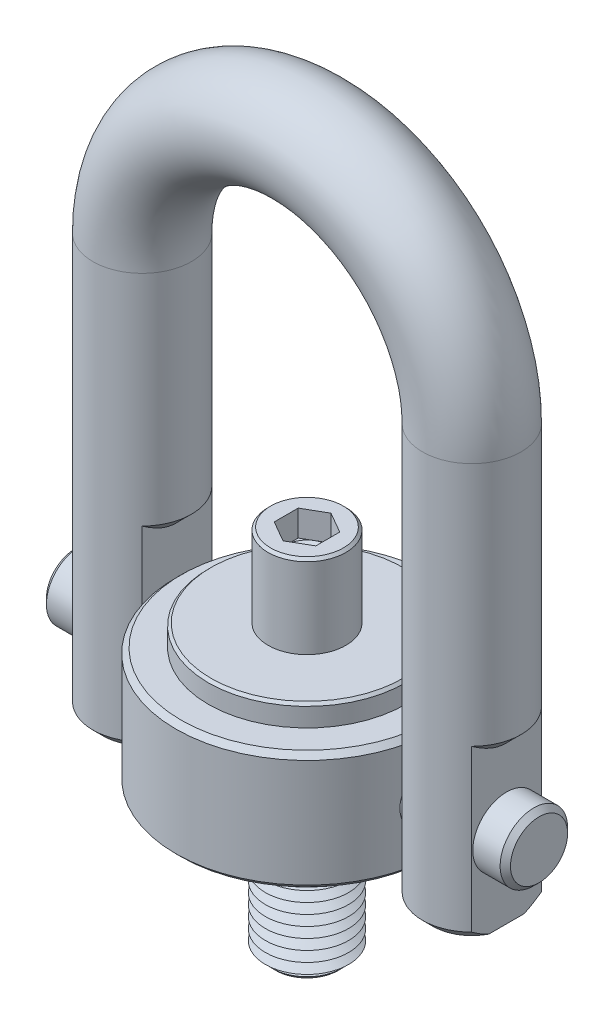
ISO-10303-21;
HEADER;
FILE_DESCRIPTION(('STEP AP214'),'2;1');
FILE_NAME('part.step','',(''),(''),'','','');
FILE_SCHEMA(('AUTOMOTIVE_DESIGN { 1 0 10303 214 1 1 1 1 }'));
ENDSEC;
DATA;
#1=APPLICATION_CONTEXT('core data for automotive mechanical design processes');
#2=APPLICATION_PROTOCOL_DEFINITION('international standard','automotive_design',2000,#1);
#3=PRODUCT_CONTEXT('',#1,'mechanical');
#4=PRODUCT('Part','Part','',(#3));
#5=PRODUCT_RELATED_PRODUCT_CATEGORY('part','',(#4));
#6=PRODUCT_DEFINITION_FORMATION('','',#4);
#7=PRODUCT_DEFINITION_CONTEXT('part definition',#1,'design');
#8=PRODUCT_DEFINITION('design','',#6,#7);
#9=PRODUCT_DEFINITION_SHAPE('','',#8);
#10=(LENGTH_UNIT() NAMED_UNIT(*) SI_UNIT(.MILLI.,.METRE.));
#11=(NAMED_UNIT(*) PLANE_ANGLE_UNIT() SI_UNIT($,.RADIAN.));
#12=(NAMED_UNIT(*) SI_UNIT($,.STERADIAN.) SOLID_ANGLE_UNIT());
#13=UNCERTAINTY_MEASURE_WITH_UNIT(LENGTH_MEASURE(1.E-05),#10,'distance_accuracy_value','');
#14=(GEOMETRIC_REPRESENTATION_CONTEXT(3) GLOBAL_UNCERTAINTY_ASSIGNED_CONTEXT((#13)) GLOBAL_UNIT_ASSIGNED_CONTEXT((#10,
#11,#12)) REPRESENTATION_CONTEXT('',''));
#15=CARTESIAN_POINT('',(0.,0.,0.));
#16=DIRECTION('',(0.,0.,1.));
#17=DIRECTION('',(1.,0.,0.));
#18=AXIS2_PLACEMENT_3D('',#15,#16,#17);
#19=CARTESIAN_POINT('',(44.7,0.,0.));
#20=DIRECTION('',(-1.,0.,0.));
#21=DIRECTION('',(0.,0.,1.));
#22=AXIS2_PLACEMENT_3D('',#19,#20,#21);
#23=CYLINDRICAL_SURFACE('',#22,6.5);
#24=CARTESIAN_POINT('',(-43.6999999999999,0.,0.));
#25=DIRECTION('',(1.,0.,0.));
#26=DIRECTION('',(0.,0.,-1.));
#27=AXIS2_PLACEMENT_3D('',#24,#25,#26);
#28=CIRCLE('',#27,6.5);
#29=CARTESIAN_POINT('',(-43.6999999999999,0.,6.5));
#30=VERTEX_POINT('',#29);
#31=EDGE_CURVE('P0_E25',#30,#30,#28,.T.);
#32=CARTESIAN_POINT('',(43.7000000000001,0.,0.));
#33=DIRECTION('',(1.,0.,0.));
#34=DIRECTION('',(0.,0.,-1.));
#35=AXIS2_PLACEMENT_3D('',#32,#33,#34);
#36=CIRCLE('',#35,6.5);
#37=CARTESIAN_POINT('',(43.7000000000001,0.,6.5));
#38=VERTEX_POINT('',#37);
#39=EDGE_CURVE('P0_E29',#38,#38,#36,.F.);
#40=CARTESIAN_POINT('',(-43.6999999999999,0.,6.5));
#41=CARTESIAN_POINT('',(-42.7895833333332,0.,6.5));
#42=CARTESIAN_POINT('',(-41.8791666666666,0.,6.5));
#43=CARTESIAN_POINT('',(-40.0583333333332,0.,6.5));
#44=CARTESIAN_POINT('',(-39.1479166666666,0.,6.5));
#45=CARTESIAN_POINT('',(-37.3270833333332,0.,6.5));
#46=CARTESIAN_POINT('',(-36.4166666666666,0.,6.5));
#47=CARTESIAN_POINT('',(-34.5958333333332,0.,6.5));
#48=CARTESIAN_POINT('',(-33.6854166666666,0.,6.5));
#49=CARTESIAN_POINT('',(-31.8645833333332,0.,6.5));
#50=CARTESIAN_POINT('',(-30.9541666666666,0.,6.5));
#51=CARTESIAN_POINT('',(-29.1333333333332,0.,6.5));
#52=CARTESIAN_POINT('',(-28.2229166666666,0.,6.5));
#53=CARTESIAN_POINT('',(-26.4020833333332,0.,6.5));
#54=CARTESIAN_POINT('',(-25.4916666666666,0.,6.5));
#55=CARTESIAN_POINT('',(-23.6708333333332,0.,6.5));
#56=CARTESIAN_POINT('',(-22.7604166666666,0.,6.5));
#57=CARTESIAN_POINT('',(-20.9395833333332,0.,6.5));
#58=CARTESIAN_POINT('',(-20.0291666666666,0.,6.5));
#59=CARTESIAN_POINT('',(-18.2083333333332,0.,6.5));
#60=CARTESIAN_POINT('',(-17.2979166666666,0.,6.5));
#61=CARTESIAN_POINT('',(-15.4770833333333,0.,6.5));
#62=CARTESIAN_POINT('',(-14.5666666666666,0.,6.5));
#63=CARTESIAN_POINT('',(-12.7458333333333,0.,6.5));
#64=CARTESIAN_POINT('',(-11.8354166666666,0.,6.5));
#65=CARTESIAN_POINT('',(-10.0145833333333,0.,6.5));
#66=CARTESIAN_POINT('',(-9.10416666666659,0.,6.5));
#67=CARTESIAN_POINT('',(-7.28333333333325,0.,6.5));
#68=CARTESIAN_POINT('',(-6.37291666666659,0.,6.5));
#69=CARTESIAN_POINT('',(-4.55208333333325,0.,6.5));
#70=CARTESIAN_POINT('',(-3.64166666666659,0.,6.5));
#71=CARTESIAN_POINT('',(-1.82083333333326,0.,6.5));
#72=CARTESIAN_POINT('',(-0.910416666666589,0.,6.5));
#73=CARTESIAN_POINT('',(0.910416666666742,0.,6.5));
#74=CARTESIAN_POINT('',(1.82083333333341,0.,6.5));
#75=CARTESIAN_POINT('',(3.64166666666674,0.,6.5));
#76=CARTESIAN_POINT('',(4.5520833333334,0.,6.5));
#77=CARTESIAN_POINT('',(6.37291666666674,0.,6.5));
#78=CARTESIAN_POINT('',(7.28333333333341,0.,6.5));
#79=CARTESIAN_POINT('',(9.10416666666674,0.,6.5));
#80=CARTESIAN_POINT('',(10.0145833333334,0.,6.5));
#81=CARTESIAN_POINT('',(11.8354166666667,0.,6.5));
#82=CARTESIAN_POINT('',(12.7458333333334,0.,6.5));
#83=CARTESIAN_POINT('',(14.5666666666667,0.,6.5));
#84=CARTESIAN_POINT('',(15.4770833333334,0.,6.5));
#85=CARTESIAN_POINT('',(17.2979166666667,0.,6.5));
#86=CARTESIAN_POINT('',(18.2083333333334,0.,6.5));
#87=CARTESIAN_POINT('',(20.0291666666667,0.,6.5));
#88=CARTESIAN_POINT('',(20.9395833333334,0.,6.5));
#89=CARTESIAN_POINT('',(22.7604166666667,0.,6.5));
#90=CARTESIAN_POINT('',(23.6708333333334,0.,6.5));
#91=CARTESIAN_POINT('',(25.4916666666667,0.,6.5));
#92=CARTESIAN_POINT('',(26.4020833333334,0.,6.5));
#93=CARTESIAN_POINT('',(28.2229166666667,0.,6.5));
#94=CARTESIAN_POINT('',(29.1333333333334,0.,6.5));
#95=CARTESIAN_POINT('',(30.9541666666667,0.,6.5));
#96=CARTESIAN_POINT('',(31.8645833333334,0.,6.5));
#97=CARTESIAN_POINT('',(33.6854166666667,0.,6.5));
#98=CARTESIAN_POINT('',(34.5958333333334,0.,6.5));
#99=CARTESIAN_POINT('',(36.4166666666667,0.,6.5));
#100=CARTESIAN_POINT('',(37.3270833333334,0.,6.5));
#101=CARTESIAN_POINT('',(39.1479166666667,0.,6.5));
#102=CARTESIAN_POINT('',(40.0583333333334,0.,6.5));
#103=CARTESIAN_POINT('',(41.8791666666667,0.,6.5));
#104=CARTESIAN_POINT('',(42.7895833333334,0.,6.5));
#105=CARTESIAN_POINT('',(43.7000000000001,0.,6.5));
#106=B_SPLINE_CURVE_WITH_KNOTS('',3,(#40,#41,#42,#43,#44,#45,#46,#47,#48,#49,#50,#51,#52,#53,
#54,#55,#56,#57,#58,#59,#60,#61,#62,#63,#64,#65,#66,#67,#68,#69,#70,#71,#72,#73,#74,#75,#76,#77,
#78,#79,#80,#81,#82,#83,#84,#85,#86,#87,#88,#89,#90,#91,#92,#93,#94,#95,#96,#97,#98,#99,#100,
#101,#102,#103,#104,#105),.UNSPECIFIED.,.F.,.F.,(4,2,2,2,2,2,2,2,2,2,2,2,2,2,2,2,2,2,2,2,2,2,2,
2,2,2,2,2,2,2,2,2,4),(0.,2.73125,5.4625,8.19375,10.925,13.65625,16.3875,19.11875,21.85,24.58125,
27.3125,30.04375,32.775,35.50625,38.2375,40.96875,43.7,46.43125,49.1625,51.89375,54.625,
57.35625,60.0875,62.81875,65.55,68.28125,71.0125,73.74375,76.475,79.20625,81.9375,84.66875,
87.4),.UNSPECIFIED.);
#107=EDGE_CURVE('P0_BSEAM14',#30,#38,#106,.T.);
#108=ORIENTED_EDGE('',*,*,#31,.T.);
#109=ORIENTED_EDGE('',*,*,#39,.T.);
#110=ORIENTED_EDGE('',*,*,#107,.T.);
#111=ORIENTED_EDGE('',*,*,#107,.F.);
#112=EDGE_LOOP('',(#108,#110,#109,#111));
#113=FACE_BOUND('',#112,.T.);
#114=ADVANCED_FACE('P0_F14',(#113),#23,.T.);
#115=CARTESIAN_POINT('',(44.7,0.,0.));
#116=DIRECTION('',(1.,0.,0.));
#117=DIRECTION('',(0.,0.,-1.));
#118=AXIS2_PLACEMENT_3D('',#115,#116,#117);
#119=PLANE('',#118);
#120=CARTESIAN_POINT('',(44.7,0.,0.));
#121=DIRECTION('',(1.,0.,0.));
#122=DIRECTION('',(0.,0.,-1.));
#123=AXIS2_PLACEMENT_3D('',#120,#121,#122);
#124=CIRCLE('',#123,5.50000000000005);
#125=CARTESIAN_POINT('',(44.7,0.,-5.50000000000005));
#126=VERTEX_POINT('',#125);
#127=EDGE_CURVE('P0_E10',#126,#126,#124,.T.);
#128=ORIENTED_EDGE('',*,*,#127,.T.);
#129=EDGE_LOOP('',(#128));
#130=FACE_BOUND('',#129,.T.);
#131=ADVANCED_FACE('P0_F46',(#130),#119,.T.);
#132=CARTESIAN_POINT('',(-44.7,0.,0.));
#133=DIRECTION('',(1.,0.,0.));
#134=DIRECTION('',(0.,0.,-1.));
#135=AXIS2_PLACEMENT_3D('',#132,#133,#134);
#136=PLANE('',#135);
#137=CARTESIAN_POINT('',(-44.7,0.,0.));
#138=DIRECTION('',(1.,0.,0.));
#139=DIRECTION('',(0.,0.,-1.));
#140=AXIS2_PLACEMENT_3D('',#137,#138,#139);
#141=CIRCLE('',#140,5.49999999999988);
#142=CARTESIAN_POINT('',(-44.7,0.,-5.49999999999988));
#143=VERTEX_POINT('',#142);
#144=EDGE_CURVE('P0_E21',#143,#143,#141,.F.);
#145=ORIENTED_EDGE('',*,*,#144,.T.);
#146=EDGE_LOOP('',(#145));
#147=FACE_BOUND('',#146,.T.);
#148=ADVANCED_FACE('P0_F43',(#147),#136,.F.);
#149=CARTESIAN_POINT('',(-43.6999999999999,0.,0.));
#150=DIRECTION('',(1.,0.,0.));
#151=DIRECTION('',(0.,0.,-1.));
#152=AXIS2_PLACEMENT_3D('',#149,#150,#151);
#153=CONICAL_SURFACE('',#152,6.5,0.785398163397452);
#154=ORIENTED_EDGE('',*,*,#144,.F.);
#155=EDGE_LOOP('',(#154));
#156=FACE_BOUND('',#155,.T.);
#157=ORIENTED_EDGE('',*,*,#31,.F.);
#158=EDGE_LOOP('',(#157));
#159=FACE_BOUND('',#158,.T.);
#160=ADVANCED_FACE('P0_F38',(#156,#159),#153,.T.);
#161=CARTESIAN_POINT('',(44.7,0.,0.));
#162=DIRECTION('',(-1.,0.,0.));
#163=DIRECTION('',(0.,0.,1.));
#164=AXIS2_PLACEMENT_3D('',#161,#162,#163);
#165=CONICAL_SURFACE('',#164,5.50000000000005,0.785398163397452);
#166=ORIENTED_EDGE('',*,*,#39,.F.);
#167=EDGE_LOOP('',(#166));
#168=FACE_BOUND('',#167,.T.);
#169=ORIENTED_EDGE('',*,*,#127,.F.);
#170=EDGE_LOOP('',(#169));
#171=FACE_BOUND('',#170,.T.);
#172=ADVANCED_FACE('P0_F16',(#168,#171),#165,.T.);
#173=CLOSED_SHELL('',(#114,#131,#148,#160,#172));
#174=MANIFOLD_SOLID_BREP('P0_B1',#173);
#175=CARTESIAN_POINT('',(31.7500000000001,-15.5,0.));
#176=DIRECTION('',(0.,-1.,0.));
#177=DIRECTION('',(0.,0.,1.));
#178=AXIS2_PLACEMENT_3D('',#175,#176,#177);
#179=PLANE('',#178);
#180=DIRECTION('',(0.,0.,-1.));
#181=VECTOR('',#180,1.);
#182=CARTESIAN_POINT('',(25.0651290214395,-15.5,6.75));
#183=LINE('',#182,#181);
#184=CARTESIAN_POINT('',(25.0651290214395,-15.5,3.40036762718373));
#185=VERTEX_POINT('',#184);
#186=CARTESIAN_POINT('',(25.0651290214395,-15.5,-3.40036762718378));
#187=VERTEX_POINT('',#186);
#188=EDGE_CURVE('P1_E132',#185,#187,#183,.T.);
#189=ORIENTED_EDGE('',*,*,#188,.T.);
#190=CARTESIAN_POINT('',(31.7500000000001,-15.5,0.));
#191=DIRECTION('',(0.,-1.,0.));
#192=DIRECTION('',(1.,0.,0.));
#193=AXIS2_PLACEMENT_3D('',#190,#191,#192);
#194=CIRCLE('',#193,7.50000000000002);
#195=CARTESIAN_POINT('',(38.4348709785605,-15.5,-3.40036762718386));
#196=VERTEX_POINT('',#195);
#197=EDGE_CURVE('P1_E192',#187,#196,#194,.T.);
#198=ORIENTED_EDGE('',*,*,#197,.T.);
#199=DIRECTION('',(0.,0.,1.));
#200=VECTOR('',#199,1.);
#201=CARTESIAN_POINT('',(38.4348709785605,-15.5,6.75));
#202=LINE('',#201,#200);
#203=CARTESIAN_POINT('',(38.4348709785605,-15.5,3.40036762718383));
#204=VERTEX_POINT('',#203);
#205=EDGE_CURVE('P1_E315',#196,#204,#202,.T.);
#206=ORIENTED_EDGE('',*,*,#205,.T.);
#207=CARTESIAN_POINT('',(31.7500000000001,-15.5,0.));
#208=DIRECTION('',(0.,-1.,0.));
#209=DIRECTION('',(1.,0.,0.));
#210=AXIS2_PLACEMENT_3D('',#207,#208,#209);
#211=CIRCLE('',#210,7.5);
#212=CARTESIAN_POINT('',(31.7500000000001,-15.5,7.49999999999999));
#213=VERTEX_POINT('',#212);
#214=EDGE_CURVE('P1_E370',#204,#213,#211,.T.);
#215=ORIENTED_EDGE('',*,*,#214,.T.);
#216=CARTESIAN_POINT('',(31.7500000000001,-15.5,0.));
#217=DIRECTION('',(0.,-1.,0.));
#218=DIRECTION('',(1.,0.,0.));
#219=AXIS2_PLACEMENT_3D('',#216,#217,#218);
#220=CIRCLE('',#219,7.49999999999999);
#221=EDGE_CURVE('P1_E369',#213,#185,#220,.T.);
#222=ORIENTED_EDGE('',*,*,#221,.T.);
#223=EDGE_LOOP('',(#189,#198,#206,#215,#222));
#224=FACE_BOUND('',#223,.T.);
#225=ADVANCED_FACE('P1_F16',(#224),#179,.T.);
#226=CARTESIAN_POINT('',(31.75,64.65,0.));
#227=DIRECTION('',(0.,-1.,0.));
#228=DIRECTION('',(1.,0.,0.));
#229=AXIS2_PLACEMENT_3D('',#226,#227,#228);
#230=CYLINDRICAL_SURFACE('',#229,9.5);
#231=CARTESIAN_POINT('',(31.75,64.65,0.));
#232=DIRECTION('',(0.,-1.,0.));
#233=DIRECTION('',(0.,0.,1.));
#234=AXIS2_PLACEMENT_3D('',#231,#232,#233);
#235=CIRCLE('',#234,9.5);
#236=CARTESIAN_POINT('',(41.25,64.65,0.));
#237=VERTEX_POINT('',#236);
#238=EDGE_CURVE('P1_E143',#237,#237,#235,.T.);
#239=ORIENTED_EDGE('',*,*,#238,.T.);
#240=EDGE_LOOP('',(#239));
#241=FACE_BOUND('',#240,.T.);
#242=DIRECTION('',(0.,-1.,0.));
#243=VECTOR('',#242,1.);
#244=CARTESIAN_POINT('',(38.4348709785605,14.5,-6.75));
#245=LINE('',#244,#243);
#246=CARTESIAN_POINT('',(38.4348709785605,17.5,-6.74999999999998));
#247=VERTEX_POINT('',#246);
#248=CARTESIAN_POINT('',(38.4348709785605,-13.5,-6.75));
#249=VERTEX_POINT('',#248);
#250=EDGE_CURVE('P1_E328',#247,#249,#245,.T.);
#251=ORIENTED_EDGE('',*,*,#250,.T.);
#252=CARTESIAN_POINT('',(31.7500000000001,-13.5,0.));
#253=DIRECTION('',(0.,-1.,0.));
#254=DIRECTION('',(0.,0.,-1.));
#255=AXIS2_PLACEMENT_3D('',#252,#253,#254);
#256=CIRCLE('',#255,9.5);
#257=CARTESIAN_POINT('',(25.0651290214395,-13.5,-6.75));
#258=VERTEX_POINT('',#257);
#259=EDGE_CURVE('P1_E128',#249,#258,#256,.F.);
#260=ORIENTED_EDGE('',*,*,#259,.T.);
#261=DIRECTION('',(0.,-1.,0.));
#262=VECTOR('',#261,1.);
#263=CARTESIAN_POINT('',(25.0651290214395,19.5,-6.75));
#264=LINE('',#263,#262);
#265=CARTESIAN_POINT('',(25.0651290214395,22.5,-6.75));
#266=VERTEX_POINT('',#265);
#267=EDGE_CURVE('P1_E120',#266,#258,#264,.T.);
#268=ORIENTED_EDGE('',*,*,#267,.F.);
#269=CARTESIAN_POINT('',(31.75,22.5000000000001,0.));
#270=DIRECTION('',(0.,-1.,0.));
#271=DIRECTION('',(1.,0.,0.));
#272=AXIS2_PLACEMENT_3D('',#269,#270,#271);
#273=CIRCLE('',#272,9.5);
#274=CARTESIAN_POINT('',(25.0651290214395,22.5,6.74999999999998));
#275=VERTEX_POINT('',#274);
#276=EDGE_CURVE('P1_E126',#266,#275,#273,.F.);
#277=ORIENTED_EDGE('',*,*,#276,.T.);
#278=DIRECTION('',(0.,-1.,0.));
#279=VECTOR('',#278,1.);
#280=CARTESIAN_POINT('',(25.0651290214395,19.5,6.75));
#281=LINE('',#280,#279);
#282=CARTESIAN_POINT('',(25.0651290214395,-13.5,6.75));
#283=VERTEX_POINT('',#282);
#284=EDGE_CURVE('P1_E131',#275,#283,#281,.T.);
#285=ORIENTED_EDGE('',*,*,#284,.T.);
#286=CARTESIAN_POINT('',(31.7500000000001,-13.5,0.));
#287=DIRECTION('',(0.,-1.,0.));
#288=DIRECTION('',(0.,0.,-1.));
#289=AXIS2_PLACEMENT_3D('',#286,#287,#288);
#290=CIRCLE('',#289,9.5);
#291=CARTESIAN_POINT('',(31.7500000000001,-13.5,9.5));
#292=VERTEX_POINT('',#291);
#293=EDGE_CURVE('P1_E530',#283,#292,#290,.F.);
#294=ORIENTED_EDGE('',*,*,#293,.T.);
#295=CARTESIAN_POINT('',(31.7500000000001,-13.5,0.));
#296=DIRECTION('',(0.,-1.,0.));
#297=DIRECTION('',(0.,0.,-1.));
#298=AXIS2_PLACEMENT_3D('',#295,#296,#297);
#299=CIRCLE('',#298,9.5);
#300=CARTESIAN_POINT('',(38.4348709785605,-13.5,6.75));
#301=VERTEX_POINT('',#300);
#302=EDGE_CURVE('P1_E528',#292,#301,#299,.F.);
#303=ORIENTED_EDGE('',*,*,#302,.T.);
#304=DIRECTION('',(0.,-1.,0.));
#305=VECTOR('',#304,1.);
#306=CARTESIAN_POINT('',(38.4348709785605,14.5,6.75));
#307=LINE('',#306,#305);
#308=CARTESIAN_POINT('',(38.4348709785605,17.5,6.75));
#309=VERTEX_POINT('',#308);
#310=EDGE_CURVE('P1_E327',#309,#301,#307,.T.);
#311=ORIENTED_EDGE('',*,*,#310,.F.);
#312=CARTESIAN_POINT('',(31.75,17.5,0.));
#313=DIRECTION('',(0.,-1.,0.));
#314=DIRECTION('',(0.,0.,-1.));
#315=AXIS2_PLACEMENT_3D('',#312,#313,#314);
#316=CIRCLE('',#315,9.5);
#317=EDGE_CURVE('P1_E142',#309,#247,#316,.F.);
#318=ORIENTED_EDGE('',*,*,#317,.T.);
#319=EDGE_LOOP('',(#251,#260,#268,#277,#285,#294,#303,#311,#318));
#320=FACE_BOUND('',#319,.T.);
#321=ADVANCED_FACE('P1_F123',(#241,#320),#230,.T.);
#322=CARTESIAN_POINT('',(-31.7500000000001,-15.5,0.));
#323=DIRECTION('',(0.,1.,0.));
#324=DIRECTION('',(0.,0.,1.));
#325=AXIS2_PLACEMENT_3D('',#322,#323,#324);
#326=PLANE('',#325);
#327=DIRECTION('',(0.,0.,1.));
#328=VECTOR('',#327,1.);
#329=CARTESIAN_POINT('',(-38.4348709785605,-15.5,6.75));
#330=LINE('',#329,#328);
#331=CARTESIAN_POINT('',(-38.4348709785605,-15.5,-3.40036762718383));
#332=VERTEX_POINT('',#331);
#333=CARTESIAN_POINT('',(-38.4348709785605,-15.5,3.40036762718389));
#334=VERTEX_POINT('',#333);
#335=EDGE_CURVE('P1_E334',#332,#334,#330,.T.);
#336=ORIENTED_EDGE('',*,*,#335,.F.);
#337=CARTESIAN_POINT('',(-31.7500000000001,-15.5,0.));
#338=DIRECTION('',(0.,1.,0.));
#339=DIRECTION('',(0.,0.,1.));
#340=AXIS2_PLACEMENT_3D('',#337,#338,#339);
#341=CIRCLE('',#340,7.50000000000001);
#342=CARTESIAN_POINT('',(-25.0651290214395,-15.5,-3.40036762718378));
#343=VERTEX_POINT('',#342);
#344=EDGE_CURVE('P1_E40',#332,#343,#341,.F.);
#345=ORIENTED_EDGE('',*,*,#344,.T.);
#346=DIRECTION('',(0.,0.,-1.));
#347=VECTOR('',#346,1.);
#348=CARTESIAN_POINT('',(-25.0651290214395,-15.5,6.75));
#349=LINE('',#348,#347);
#350=CARTESIAN_POINT('',(-25.0651290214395,-15.5,3.40036762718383));
#351=VERTEX_POINT('',#350);
#352=EDGE_CURVE('P1_E303',#351,#343,#349,.T.);
#353=ORIENTED_EDGE('',*,*,#352,.F.);
#354=CARTESIAN_POINT('',(-31.7500000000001,-15.5,0.));
#355=DIRECTION('',(0.,1.,0.));
#356=DIRECTION('',(0.,0.,1.));
#357=AXIS2_PLACEMENT_3D('',#354,#355,#356);
#358=CIRCLE('',#357,7.50000000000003);
#359=CARTESIAN_POINT('',(-31.7500000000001,-15.5,7.50000000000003));
#360=VERTEX_POINT('',#359);
#361=EDGE_CURVE('P1_E34',#351,#360,#358,.F.);
#362=ORIENTED_EDGE('',*,*,#361,.T.);
#363=CARTESIAN_POINT('',(-31.7500000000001,-15.5,0.));
#364=DIRECTION('',(0.,1.,0.));
#365=DIRECTION('',(0.,0.,1.));
#366=AXIS2_PLACEMENT_3D('',#363,#364,#365);
#367=CIRCLE('',#366,7.50000000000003);
#368=EDGE_CURVE('P1_E298',#360,#334,#367,.F.);
#369=ORIENTED_EDGE('',*,*,#368,.T.);
#370=EDGE_LOOP('',(#336,#345,#353,#362,#369));
#371=FACE_BOUND('',#370,.T.);
#372=ADVANCED_FACE('P1_F239',(#371),#326,.F.);
#373=CARTESIAN_POINT('',(-31.7500000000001,-15.5,0.));
#374=DIRECTION('',(0.,1.,0.));
#375=DIRECTION('',(-1.,0.,0.));
#376=AXIS2_PLACEMENT_3D('',#373,#374,#375);
#377=CYLINDRICAL_SURFACE('',#376,9.5);
#378=DIRECTION('',(0.,-1.,0.));
#379=VECTOR('',#378,1.);
#380=CARTESIAN_POINT('',(-25.0651290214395,19.5,-6.75));
#381=LINE('',#380,#379);
#382=CARTESIAN_POINT('',(-25.0651290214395,22.5,-6.74999999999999));
#383=VERTEX_POINT('',#382);
#384=CARTESIAN_POINT('',(-25.0651290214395,-13.5,-6.75));
#385=VERTEX_POINT('',#384);
#386=EDGE_CURVE('P1_E340',#383,#385,#381,.T.);
#387=ORIENTED_EDGE('',*,*,#386,.T.);
#388=CARTESIAN_POINT('',(-31.7500000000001,-13.5,0.));
#389=DIRECTION('',(0.,1.,0.));
#390=DIRECTION('',(0.,0.,1.));
#391=AXIS2_PLACEMENT_3D('',#388,#389,#390);
#392=CIRCLE('',#391,9.5);
#393=CARTESIAN_POINT('',(-38.4348709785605,-13.5,-6.75));
#394=VERTEX_POINT('',#393);
#395=EDGE_CURVE('P1_E287',#385,#394,#392,.T.);
#396=ORIENTED_EDGE('',*,*,#395,.T.);
#397=DIRECTION('',(0.,-1.,0.));
#398=VECTOR('',#397,1.);
#399=CARTESIAN_POINT('',(-38.4348709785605,14.5,-6.75));
#400=LINE('',#399,#398);
#401=CARTESIAN_POINT('',(-38.4348709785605,17.5,-6.74999999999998));
#402=VERTEX_POINT('',#401);
#403=EDGE_CURVE('P1_E337',#402,#394,#400,.T.);
#404=ORIENTED_EDGE('',*,*,#403,.F.);
#405=CARTESIAN_POINT('',(-31.75,17.5,0.));
#406=DIRECTION('',(0.,-1.,0.));
#407=DIRECTION('',(0.,0.,-1.));
#408=AXIS2_PLACEMENT_3D('',#405,#406,#407);
#409=CIRCLE('',#408,9.5);
#410=CARTESIAN_POINT('',(-38.4348709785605,17.5,6.74999999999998));
#411=VERTEX_POINT('',#410);
#412=EDGE_CURVE('P1_E146',#402,#411,#409,.F.);
#413=ORIENTED_EDGE('',*,*,#412,.T.);
#414=DIRECTION('',(0.,-1.,0.));
#415=VECTOR('',#414,1.);
#416=CARTESIAN_POINT('',(-38.4348709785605,14.5,6.75));
#417=LINE('',#416,#415);
#418=CARTESIAN_POINT('',(-38.4348709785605,-13.5,6.75));
#419=VERTEX_POINT('',#418);
#420=EDGE_CURVE('P1_E308',#411,#419,#417,.T.);
#421=ORIENTED_EDGE('',*,*,#420,.T.);
#422=CARTESIAN_POINT('',(-31.7500000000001,-13.5,0.));
#423=DIRECTION('',(0.,1.,0.));
#424=DIRECTION('',(0.,0.,1.));
#425=AXIS2_PLACEMENT_3D('',#422,#423,#424);
#426=CIRCLE('',#425,9.5);
#427=CARTESIAN_POINT('',(-31.7500000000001,-13.5,9.5));
#428=VERTEX_POINT('',#427);
#429=EDGE_CURVE('P1_E284',#419,#428,#426,.T.);
#430=ORIENTED_EDGE('',*,*,#429,.T.);
#431=CARTESIAN_POINT('',(-31.7500000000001,-13.5,0.));
#432=DIRECTION('',(0.,1.,0.));
#433=DIRECTION('',(0.,0.,1.));
#434=AXIS2_PLACEMENT_3D('',#431,#432,#433);
#435=CIRCLE('',#434,9.5);
#436=CARTESIAN_POINT('',(-25.0651290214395,-13.5,6.75));
#437=VERTEX_POINT('',#436);
#438=EDGE_CURVE('P1_E277',#428,#437,#435,.T.);
#439=ORIENTED_EDGE('',*,*,#438,.T.);
#440=DIRECTION('',(0.,-1.,0.));
#441=VECTOR('',#440,1.);
#442=CARTESIAN_POINT('',(-25.0651290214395,19.5,6.75));
#443=LINE('',#442,#441);
#444=CARTESIAN_POINT('',(-25.0651290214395,22.5,6.74999999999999));
#445=VERTEX_POINT('',#444);
#446=EDGE_CURVE('P1_E305',#445,#437,#443,.T.);
#447=ORIENTED_EDGE('',*,*,#446,.F.);
#448=CARTESIAN_POINT('',(-31.75,22.5,0.));
#449=DIRECTION('',(0.,-1.,0.));
#450=DIRECTION('',(1.,0.,0.));
#451=AXIS2_PLACEMENT_3D('',#448,#449,#450);
#452=CIRCLE('',#451,9.5);
#453=EDGE_CURVE('P1_E155',#445,#383,#452,.F.);
#454=ORIENTED_EDGE('',*,*,#453,.T.);
#455=EDGE_LOOP('',(#387,#396,#404,#413,#421,#430,#439,#447,#454));
#456=FACE_BOUND('',#455,.T.);
#457=CARTESIAN_POINT('',(-31.75,64.65,0.));
#458=DIRECTION('',(0.,1.,0.));
#459=DIRECTION('',(0.,0.,1.));
#460=AXIS2_PLACEMENT_3D('',#457,#458,#459);
#461=CIRCLE('',#460,9.5);
#462=CARTESIAN_POINT('',(-41.2500000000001,64.65,0.));
#463=VERTEX_POINT('',#462);
#464=EDGE_CURVE('P1_E149',#463,#463,#461,.T.);
#465=ORIENTED_EDGE('',*,*,#464,.F.);
#466=EDGE_LOOP('',(#465));
#467=FACE_BOUND('',#466,.T.);
#468=ADVANCED_FACE('P1_F241',(#456,#467),#377,.T.);
#469=CARTESIAN_POINT('',(0.,64.65,0.));
#470=DIRECTION('',(0.,0.,-1.));
#471=DIRECTION('',(-1.,0.,0.));
#472=AXIS2_PLACEMENT_3D('',#469,#470,#471);
#473=TOROIDAL_SURFACE('',#472,31.75,9.5);
#474=CARTESIAN_POINT('',(0.,64.65,0.));
#475=DIRECTION('',(0.,0.,-1.));
#476=DIRECTION('',(-1.,0.,0.));
#477=AXIS2_PLACEMENT_3D('',#474,#475,#476);
#478=CIRCLE('',#477,41.25);
#479=EDGE_CURVE('',#463,#237,#478,.T.);
#480=ORIENTED_EDGE('',*,*,#464,.T.);
#481=ORIENTED_EDGE('',*,*,#238,.F.);
#482=ORIENTED_EDGE('',*,*,#479,.T.);
#483=ORIENTED_EDGE('',*,*,#479,.F.);
#484=EDGE_LOOP('',(#480,#482,#481,#483));
#485=FACE_BOUND('',#484,.T.);
#486=ADVANCED_FACE('P1_F237',(#485),#473,.T.);
#487=CARTESIAN_POINT('',(-25.0651290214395,19.5,6.75));
#488=DIRECTION('',(-1.,0.,0.));
#489=DIRECTION('',(0.,0.,1.));
#490=AXIS2_PLACEMENT_3D('',#487,#488,#489);
#491=PLANE('',#490);
#492=CARTESIAN_POINT('',(-25.0651290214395,0.,0.));
#493=DIRECTION('',(-1.,0.,0.));
#494=DIRECTION('',(0.,0.,1.));
#495=AXIS2_PLACEMENT_3D('',#492,#493,#494);
#496=CIRCLE('',#495,6.5);
#497=CARTESIAN_POINT('',(-25.0651290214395,0.,-6.5));
#498=VERTEX_POINT('',#497);
#499=EDGE_CURVE('P1_E313',#498,#498,#496,.T.);
#500=ORIENTED_EDGE('',*,*,#499,.T.);
#501=EDGE_LOOP('',(#500));
#502=FACE_BOUND('',#501,.T.);
#503=ORIENTED_EDGE('',*,*,#352,.T.);
#504=CARTESIAN_POINT('',(-25.0651290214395,-15.5,-3.40036762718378));
#505=CARTESIAN_POINT('',(-25.0651290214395,-15.4326360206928,-3.54890812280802));
#506=CARTESIAN_POINT('',(-25.0651290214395,-15.3624060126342,-3.69611737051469));
#507=CARTESIAN_POINT('',(-25.0651290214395,-15.2169677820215,-3.98800343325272));
#508=CARTESIAN_POINT('',(-25.0651290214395,-15.1417611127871,-4.1326810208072));
#509=CARTESIAN_POINT('',(-25.0651290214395,-14.9872482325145,-4.41941489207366));
#510=CARTESIAN_POINT('',(-25.0651290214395,-14.9079512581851,-4.56147617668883));
#511=CARTESIAN_POINT('',(-25.0651290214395,-14.7456881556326,-4.84349614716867));
#512=CARTESIAN_POINT('',(-25.0651290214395,-14.6627217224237,-4.98345465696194));
#513=CARTESIAN_POINT('',(-25.0651290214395,-14.4092517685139,-5.40020250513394));
#514=CARTESIAN_POINT('',(-25.0651290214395,-14.2340315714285,-5.67413071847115));
#515=CARTESIAN_POINT('',(-25.0651290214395,-13.9639304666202,-6.08056483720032));
#516=CARTESIAN_POINT('',(-25.0651290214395,-13.8725771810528,-6.21545032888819));
#517=CARTESIAN_POINT('',(-25.0651290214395,-13.6877855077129,-6.48377107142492));
#518=CARTESIAN_POINT('',(-25.0651290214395,-13.5943472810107,-6.6172064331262));
#519=CARTESIAN_POINT('',(-25.0651290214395,-13.5,-6.74999999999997));
#520=B_SPLINE_CURVE_WITH_KNOTS('',3,(#504,#505,#506,#507,#508,#509,#510,#511,#512,#513,#514,
#515,#516,#517,#518,#519),.UNSPECIFIED.,.F.,.F.,(4,2,2,2,2,2,2,4),(0.,0.489232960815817,
0.978313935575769,1.46633508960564,1.9543968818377,2.92960959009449,3.41832609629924,
3.90700497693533),.UNSPECIFIED.);
#521=EDGE_CURVE('P1_E11',#343,#385,#520,.T.);
#522=ORIENTED_EDGE('',*,*,#521,.T.);
#523=ORIENTED_EDGE('',*,*,#386,.F.);
#524=CARTESIAN_POINT('',(-25.0651290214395,22.5,-6.74999999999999));
#525=CARTESIAN_POINT('',(-25.0651290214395,22.3669041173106,-6.56261989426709));
#526=CARTESIAN_POINT('',(-25.0651290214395,22.2355640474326,-6.37396361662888));
#527=CARTESIAN_POINT('',(-25.0651290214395,21.9772356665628,-5.99357751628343));
#528=CARTESIAN_POINT('',(-25.0651290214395,21.8502493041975,-5.80184637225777));
#529=CARTESIAN_POINT('',(-25.0651290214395,21.6000412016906,-5.41254799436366));
#530=CARTESIAN_POINT('',(-25.0651290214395,21.4768859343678,-5.21493783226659));
#531=CARTESIAN_POINT('',(-25.0651290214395,21.237291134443,-4.81570098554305));
#532=CARTESIAN_POINT('',(-25.0651290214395,21.1208508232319,-4.6140747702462));
#533=CARTESIAN_POINT('',(-25.0651290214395,20.8927401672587,-4.19984179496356));
#534=CARTESIAN_POINT('',(-25.0651290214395,20.7813333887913,-3.98708890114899));
#535=CARTESIAN_POINT('',(-25.0651290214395,20.5695366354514,-3.55606763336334));
#536=CARTESIAN_POINT('',(-25.0651290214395,20.4691488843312,-3.3377981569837));
#537=CARTESIAN_POINT('',(-25.0651290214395,20.2826704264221,-2.89647598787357));
#538=CARTESIAN_POINT('',(-25.0651290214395,20.1965099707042,-2.67345307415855));
#539=CARTESIAN_POINT('',(-25.0651290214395,20.0411819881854,-2.22163348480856));
#540=CARTESIAN_POINT('',(-25.0651290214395,19.9720031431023,-1.99284076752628));
#541=CARTESIAN_POINT('',(-25.0651290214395,19.8640140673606,-1.56901241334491));
#542=CARTESIAN_POINT('',(-25.0651290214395,19.822050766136,-1.3747852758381));
#543=CARTESIAN_POINT('',(-25.0651290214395,19.7540735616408,-0.983424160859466));
#544=CARTESIAN_POINT('',(-25.0651290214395,19.7280666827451,-0.786288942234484));
#545=CARTESIAN_POINT('',(-25.0651290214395,19.6935223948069,-0.392293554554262));
#546=CARTESIAN_POINT('',(-25.0651290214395,19.6848277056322,-0.195447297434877));
#547=CARTESIAN_POINT('',(-25.0651290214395,19.6849145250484,0.198159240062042));
#548=CARTESIAN_POINT('',(-25.0651290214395,19.6936863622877,0.39491950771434));
#549=CARTESIAN_POINT('',(-25.0651290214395,19.7189963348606,0.682475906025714));
#550=CARTESIAN_POINT('',(-25.0651290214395,19.7289112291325,0.773903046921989));
#551=CARTESIAN_POINT('',(-25.0651290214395,19.7523224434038,0.95631697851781));
#552=CARTESIAN_POINT('',(-25.0651290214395,19.7658195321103,1.04730367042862));
#553=CARTESIAN_POINT('',(-25.0651290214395,19.8217601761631,1.38057959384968));
#554=CARTESIAN_POINT('',(-25.0651290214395,19.8748342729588,1.62114853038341));
#555=CARTESIAN_POINT('',(-25.0651290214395,20.0022082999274,2.09668833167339));
#556=CARTESIAN_POINT('',(-25.0651290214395,20.0765297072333,2.33165327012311));
#557=CARTESIAN_POINT('',(-25.0651290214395,20.243139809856,2.79698571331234));
#558=CARTESIAN_POINT('',(-25.0651290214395,20.3355556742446,3.02730715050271));
#559=CARTESIAN_POINT('',(-25.0651290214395,20.5344333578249,3.48165388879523));
#560=CARTESIAN_POINT('',(-25.0651290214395,20.6408915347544,3.70568080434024));
#561=CARTESIAN_POINT('',(-25.0651290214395,20.8792671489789,4.17631933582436));
#562=CARTESIAN_POINT('',(-25.0651290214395,21.0126995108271,4.42215819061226));
#563=CARTESIAN_POINT('',(-25.0651290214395,21.2905109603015,4.90761521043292));
#564=CARTESIAN_POINT('',(-25.0651290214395,21.4348935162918,5.14723137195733));
#565=CARTESIAN_POINT('',(-25.0651290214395,21.7292865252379,5.61655464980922));
#566=CARTESIAN_POINT('',(-25.0651290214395,21.879135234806,5.84636371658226));
#567=CARTESIAN_POINT('',(-25.0651290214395,22.1086748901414,6.18769077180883));
#568=CARTESIAN_POINT('',(-25.0651290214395,22.1859449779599,6.30084946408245));
#569=CARTESIAN_POINT('',(-25.0651290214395,22.3419289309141,6.52615765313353));
#570=CARTESIAN_POINT('',(-25.0651290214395,22.4206427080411,6.63830721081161));
#571=CARTESIAN_POINT('',(-25.0651290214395,22.5,6.74999999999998));
#572=B_SPLINE_CURVE_WITH_KNOTS('',3,(#524,#525,#526,#527,#528,#529,#530,#531,#532,#533,#534,
#535,#536,#537,#538,#539,#540,#541,#542,#543,#544,#545,#546,#547,#548,#549,#550,#551,#552,#553,
#554,#555,#556,#557,#558,#559,#560,#561,#562,#563,#564,#565,#566,#567,#568,#569,#570,#571),
.UNSPECIFIED.,.F.,.F.,(4,2,2,2,2,2,2,2,2,2,2,2,2,2,2,2,2,2,2,2,2,2,2,4),(0.,0.689541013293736,
1.37938672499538,2.07781305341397,2.77615823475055,3.4963726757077,4.21673219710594,
4.93344799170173,5.64968478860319,6.24522531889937,6.84102783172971,7.43139236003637,
8.02143008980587,8.29725969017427,8.57314852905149,9.31093092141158,10.0494617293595,
10.7933824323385,11.5371105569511,12.3758890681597,13.2149343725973,14.0378352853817,
14.4488982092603,14.8599361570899),.UNSPECIFIED.);
#573=EDGE_CURVE('P1_E138',#383,#445,#572,.T.);
#574=ORIENTED_EDGE('',*,*,#573,.T.);
#575=ORIENTED_EDGE('',*,*,#446,.T.);
#576=CARTESIAN_POINT('',(-25.0651290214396,-13.5,6.74999999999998));
#577=CARTESIAN_POINT('',(-25.0651290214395,-13.5943472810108,6.61720643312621));
#578=CARTESIAN_POINT('',(-25.0651290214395,-13.6877855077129,6.48377107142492));
#579=CARTESIAN_POINT('',(-25.0651290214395,-13.8725771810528,6.21545032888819));
#580=CARTESIAN_POINT('',(-25.0651290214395,-13.9639304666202,6.08056483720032));
#581=CARTESIAN_POINT('',(-25.0651290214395,-14.2340315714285,5.67413071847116));
#582=CARTESIAN_POINT('',(-25.0651290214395,-14.4092517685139,5.40020250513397));
#583=CARTESIAN_POINT('',(-25.0651290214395,-14.6627217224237,4.98345465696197));
#584=CARTESIAN_POINT('',(-25.0651290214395,-14.7456881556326,4.8434961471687));
#585=CARTESIAN_POINT('',(-25.0651290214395,-14.9079512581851,4.56147617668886));
#586=CARTESIAN_POINT('',(-25.0651290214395,-14.9872482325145,4.4194148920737));
#587=CARTESIAN_POINT('',(-25.0651290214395,-15.1417611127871,4.13268102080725));
#588=CARTESIAN_POINT('',(-25.0651290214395,-15.2169677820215,3.98800343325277));
#589=CARTESIAN_POINT('',(-25.0651290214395,-15.3624060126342,3.69611737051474));
#590=CARTESIAN_POINT('',(-25.0651290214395,-15.4326360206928,3.54890812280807));
#591=CARTESIAN_POINT('',(-25.0651290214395,-15.5,3.40036762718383));
#592=B_SPLINE_CURVE_WITH_KNOTS('',3,(#576,#577,#578,#579,#580,#581,#582,#583,#584,#585,#586,
#587,#588,#589,#590,#591),.UNSPECIFIED.,.F.,.F.,(4,2,2,2,2,2,2,4),(0.,0.488678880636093,
0.977395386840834,1.95260809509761,2.44066988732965,2.92869104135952,3.41777201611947,
3.90700497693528),.UNSPECIFIED.);
#593=EDGE_CURVE('P1_E26',#437,#351,#592,.T.);
#594=ORIENTED_EDGE('',*,*,#593,.T.);
#595=EDGE_LOOP('',(#503,#522,#523,#574,#575,#594));
#596=FACE_BOUND('',#595,.T.);
#597=ADVANCED_FACE('P1_F232',(#502,#596),#491,.F.);
#598=CARTESIAN_POINT('',(-38.4348709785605,14.5,6.75));
#599=DIRECTION('',(1.,0.,0.));
#600=DIRECTION('',(0.,0.,-1.));
#601=AXIS2_PLACEMENT_3D('',#598,#599,#600);
#602=PLANE('',#601);
#603=CARTESIAN_POINT('',(-38.4348709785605,0.,0.));
#604=DIRECTION('',(1.,0.,0.));
#605=DIRECTION('',(0.,0.,-1.));
#606=AXIS2_PLACEMENT_3D('',#603,#604,#605);
#607=CIRCLE('',#606,6.5);
#608=CARTESIAN_POINT('',(-38.4348709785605,0.,-6.5));
#609=VERTEX_POINT('',#608);
#610=EDGE_CURVE('P1_E321',#609,#609,#607,.F.);
#611=ORIENTED_EDGE('',*,*,#610,.F.);
#612=EDGE_LOOP('',(#611));
#613=FACE_BOUND('',#612,.T.);
#614=ORIENTED_EDGE('',*,*,#403,.T.);
#615=CARTESIAN_POINT('',(-38.4348709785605,-13.5,-6.74999999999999));
#616=CARTESIAN_POINT('',(-38.4348709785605,-13.5943472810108,-6.61720643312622));
#617=CARTESIAN_POINT('',(-38.4348709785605,-13.6877855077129,-6.48377107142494));
#618=CARTESIAN_POINT('',(-38.4348709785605,-13.8725771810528,-6.21545032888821));
#619=CARTESIAN_POINT('',(-38.4348709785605,-13.9639304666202,-6.08056483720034));
#620=CARTESIAN_POINT('',(-38.4348709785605,-14.2340315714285,-5.67413071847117));
#621=CARTESIAN_POINT('',(-38.4348709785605,-14.4092517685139,-5.40020250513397));
#622=CARTESIAN_POINT('',(-38.4348709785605,-14.6627217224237,-4.98345465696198));
#623=CARTESIAN_POINT('',(-38.4348709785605,-14.7456881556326,-4.8434961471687));
#624=CARTESIAN_POINT('',(-38.4348709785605,-14.9079512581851,-4.56147617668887));
#625=CARTESIAN_POINT('',(-38.4348709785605,-14.9872482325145,-4.4194148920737));
#626=CARTESIAN_POINT('',(-38.4348709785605,-15.1417611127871,-4.13268102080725));
#627=CARTESIAN_POINT('',(-38.4348709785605,-15.2169677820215,-3.98800343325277));
#628=CARTESIAN_POINT('',(-38.4348709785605,-15.3624060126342,-3.69611737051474));
#629=CARTESIAN_POINT('',(-38.4348709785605,-15.4326360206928,-3.54890812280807));
#630=CARTESIAN_POINT('',(-38.4348709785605,-15.5,-3.40036762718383));
#631=B_SPLINE_CURVE_WITH_KNOTS('',3,(#615,#616,#617,#618,#619,#620,#621,#622,#623,#624,#625,
#626,#627,#628,#629,#630),.UNSPECIFIED.,.F.,.F.,(4,2,2,2,2,2,2,4),(0.,0.488678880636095,
0.977395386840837,1.95260809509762,2.44066988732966,2.92869104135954,3.41777201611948,
3.9070049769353),.UNSPECIFIED.);
#632=EDGE_CURVE('P1_E216',#394,#332,#631,.T.);
#633=ORIENTED_EDGE('',*,*,#632,.T.);
#634=ORIENTED_EDGE('',*,*,#335,.T.);
#635=CARTESIAN_POINT('',(-38.4348709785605,-15.5,3.40036762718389));
#636=CARTESIAN_POINT('',(-38.4348709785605,-15.4326360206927,3.54890812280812));
#637=CARTESIAN_POINT('',(-38.4348709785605,-15.3624060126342,3.69611737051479));
#638=CARTESIAN_POINT('',(-38.4348709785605,-15.2169677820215,3.98800343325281));
#639=CARTESIAN_POINT('',(-38.4348709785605,-15.1417611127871,4.13268102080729));
#640=CARTESIAN_POINT('',(-38.4348709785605,-14.9872482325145,4.41941489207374));
#641=CARTESIAN_POINT('',(-38.4348709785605,-14.9079512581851,4.5614761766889));
#642=CARTESIAN_POINT('',(-38.4348709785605,-14.7456881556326,4.84349614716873));
#643=CARTESIAN_POINT('',(-38.4348709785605,-14.6627217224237,4.98345465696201));
#644=CARTESIAN_POINT('',(-38.4348709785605,-14.409251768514,5.40020250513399));
#645=CARTESIAN_POINT('',(-38.4348709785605,-14.2340315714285,5.67413071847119));
#646=CARTESIAN_POINT('',(-38.4348709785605,-13.9639304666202,6.08056483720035));
#647=CARTESIAN_POINT('',(-38.4348709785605,-13.8725771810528,6.21545032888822));
#648=CARTESIAN_POINT('',(-38.4348709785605,-13.6877855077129,6.48377107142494));
#649=CARTESIAN_POINT('',(-38.4348709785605,-13.5943472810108,6.61720643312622));
#650=CARTESIAN_POINT('',(-38.4348709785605,-13.5,6.74999999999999));
#651=B_SPLINE_CURVE_WITH_KNOTS('',3,(#635,#636,#637,#638,#639,#640,#641,#642,#643,#644,#645,
#646,#647,#648,#649,#650),.UNSPECIFIED.,.F.,.F.,(4,2,2,2,2,2,2,4),(0.,0.489232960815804,
0.978313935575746,1.46633508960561,1.95439688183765,2.92960959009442,3.41832609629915,
3.90700497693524),.UNSPECIFIED.);
#652=EDGE_CURVE('P1_E289',#334,#419,#651,.T.);
#653=ORIENTED_EDGE('',*,*,#652,.T.);
#654=ORIENTED_EDGE('',*,*,#420,.F.);
#655=CARTESIAN_POINT('',(-38.4348709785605,17.5,6.74999999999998));
#656=CARTESIAN_POINT('',(-38.4348709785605,17.3669041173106,6.56261989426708));
#657=CARTESIAN_POINT('',(-38.4348709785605,17.2355640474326,6.37396361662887));
#658=CARTESIAN_POINT('',(-38.4348709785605,16.9772356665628,5.99357751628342));
#659=CARTESIAN_POINT('',(-38.4348709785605,16.8502493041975,5.80184637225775));
#660=CARTESIAN_POINT('',(-38.4348709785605,16.6000412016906,5.41254799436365));
#661=CARTESIAN_POINT('',(-38.4348709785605,16.4768859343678,5.21493783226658));
#662=CARTESIAN_POINT('',(-38.4348709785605,16.237291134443,4.81570098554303));
#663=CARTESIAN_POINT('',(-38.4348709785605,16.1208508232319,4.61407477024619));
#664=CARTESIAN_POINT('',(-38.4348709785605,15.8927401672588,4.19984179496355));
#665=CARTESIAN_POINT('',(-38.4348709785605,15.7813333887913,3.98708890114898));
#666=CARTESIAN_POINT('',(-38.4348709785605,15.5695366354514,3.55606763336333));
#667=CARTESIAN_POINT('',(-38.4348709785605,15.4691488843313,3.33779815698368));
#668=CARTESIAN_POINT('',(-38.4348709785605,15.2826704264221,2.89647598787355));
#669=CARTESIAN_POINT('',(-38.4348709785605,15.1965099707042,2.67345307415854));
#670=CARTESIAN_POINT('',(-38.4348709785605,15.0411819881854,2.22163348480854));
#671=CARTESIAN_POINT('',(-38.4348709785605,14.9720031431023,1.99284076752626));
#672=CARTESIAN_POINT('',(-38.4348709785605,14.8640140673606,1.56901241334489));
#673=CARTESIAN_POINT('',(-38.4348709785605,14.822050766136,1.37478527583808));
#674=CARTESIAN_POINT('',(-38.4348709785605,14.7540735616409,0.983424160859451));
#675=CARTESIAN_POINT('',(-38.4348709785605,14.7280666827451,0.786288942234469));
#676=CARTESIAN_POINT('',(-38.4348709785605,14.693522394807,0.392293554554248));
#677=CARTESIAN_POINT('',(-38.4348709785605,14.6848277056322,0.195447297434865));
#678=CARTESIAN_POINT('',(-38.4348709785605,14.6849145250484,-0.198159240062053));
#679=CARTESIAN_POINT('',(-38.4348709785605,14.6936863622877,-0.39491950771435));
#680=CARTESIAN_POINT('',(-38.4348709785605,14.7189963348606,-0.682475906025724));
#681=CARTESIAN_POINT('',(-38.4348709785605,14.7289112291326,-0.773903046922));
#682=CARTESIAN_POINT('',(-38.4348709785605,14.7523224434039,-0.956316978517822));
#683=CARTESIAN_POINT('',(-38.4348709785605,14.7658195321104,-1.04730367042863));
#684=CARTESIAN_POINT('',(-38.4348709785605,14.8217601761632,-1.38057959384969));
#685=CARTESIAN_POINT('',(-38.4348709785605,14.8748342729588,-1.62114853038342));
#686=CARTESIAN_POINT('',(-38.4348709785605,15.0022082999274,-2.0966883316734));
#687=CARTESIAN_POINT('',(-38.4348709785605,15.0765297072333,-2.33165327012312));
#688=CARTESIAN_POINT('',(-38.4348709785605,15.243139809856,-2.79698571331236));
#689=CARTESIAN_POINT('',(-38.4348709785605,15.3355556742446,-3.02730715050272));
#690=CARTESIAN_POINT('',(-38.4348709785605,15.5344333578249,-3.48165388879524));
#691=CARTESIAN_POINT('',(-38.4348709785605,15.6408915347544,-3.70568080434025));
#692=CARTESIAN_POINT('',(-38.4348709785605,15.879267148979,-4.17631933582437));
#693=CARTESIAN_POINT('',(-38.4348709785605,16.0126995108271,-4.42215819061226));
#694=CARTESIAN_POINT('',(-38.4348709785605,16.2905109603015,-4.90761521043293));
#695=CARTESIAN_POINT('',(-38.4348709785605,16.4348935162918,-5.14723137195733));
#696=CARTESIAN_POINT('',(-38.4348709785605,16.7292865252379,-5.61655464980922));
#697=CARTESIAN_POINT('',(-38.4348709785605,16.879135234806,-5.84636371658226));
#698=CARTESIAN_POINT('',(-38.4348709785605,17.1086748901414,-6.18769077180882));
#699=CARTESIAN_POINT('',(-38.4348709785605,17.18594497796,-6.30084946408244));
#700=CARTESIAN_POINT('',(-38.4348709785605,17.3419289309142,-6.52615765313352));
#701=CARTESIAN_POINT('',(-38.4348709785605,17.4206427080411,-6.63830721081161));
#702=CARTESIAN_POINT('',(-38.4348709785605,17.5,-6.74999999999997));
#703=B_SPLINE_CURVE_WITH_KNOTS('',3,(#655,#656,#657,#658,#659,#660,#661,#662,#663,#664,#665,
#666,#667,#668,#669,#670,#671,#672,#673,#674,#675,#676,#677,#678,#679,#680,#681,#682,#683,#684,
#685,#686,#687,#688,#689,#690,#691,#692,#693,#694,#695,#696,#697,#698,#699,#700,#701,#702),
.UNSPECIFIED.,.F.,.F.,(4,2,2,2,2,2,2,2,2,2,2,2,2,2,2,2,2,2,2,2,2,2,2,4),(0.,0.689541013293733,
1.37938672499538,2.07781305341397,2.77615823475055,3.4963726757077,4.21673219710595,
4.93344799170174,5.64968478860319,6.24522531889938,6.84102783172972,7.43139236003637,
8.02143008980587,8.29725969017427,8.57314852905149,9.31093092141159,10.0494617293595,
10.7933824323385,11.5371105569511,12.3758890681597,13.2149343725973,14.0378352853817,
14.4488982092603,14.8599361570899),.UNSPECIFIED.);
#704=EDGE_CURVE('P1_E251',#411,#402,#703,.T.);
#705=ORIENTED_EDGE('',*,*,#704,.T.);
#706=EDGE_LOOP('',(#614,#633,#634,#653,#654,#705));
#707=FACE_BOUND('',#706,.T.);
#708=ADVANCED_FACE('P1_F236',(#613,#707),#602,.F.);
#709=CARTESIAN_POINT('',(25.0651290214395,19.5,6.75));
#710=DIRECTION('',(-1.,0.,0.));
#711=DIRECTION('',(0.,0.,1.));
#712=AXIS2_PLACEMENT_3D('',#709,#710,#711);
#713=PLANE('',#712);
#714=CARTESIAN_POINT('',(25.0651290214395,0.,0.));
#715=DIRECTION('',(-1.,0.,0.));
#716=DIRECTION('',(0.,0.,1.));
#717=AXIS2_PLACEMENT_3D('',#714,#715,#716);
#718=CIRCLE('',#717,6.5);
#719=CARTESIAN_POINT('',(25.0651290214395,0.,-6.5));
#720=VERTEX_POINT('',#719);
#721=EDGE_CURVE('P1_E317',#720,#720,#718,.T.);
#722=ORIENTED_EDGE('',*,*,#721,.F.);
#723=EDGE_LOOP('',(#722));
#724=FACE_BOUND('',#723,.T.);
#725=ORIENTED_EDGE('',*,*,#267,.T.);
#726=CARTESIAN_POINT('',(25.0651290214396,-13.5,-6.74999999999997));
#727=CARTESIAN_POINT('',(25.0651290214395,-13.5943472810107,-6.6172064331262));
#728=CARTESIAN_POINT('',(25.0651290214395,-13.6877855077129,-6.48377107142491));
#729=CARTESIAN_POINT('',(25.0651290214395,-13.8725771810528,-6.21545032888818));
#730=CARTESIAN_POINT('',(25.0651290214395,-13.9639304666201,-6.08056483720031));
#731=CARTESIAN_POINT('',(25.0651290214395,-14.2340315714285,-5.67413071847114));
#732=CARTESIAN_POINT('',(25.0651290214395,-14.4092517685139,-5.40020250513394));
#733=CARTESIAN_POINT('',(25.0651290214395,-14.6627217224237,-4.98345465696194));
#734=CARTESIAN_POINT('',(25.0651290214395,-14.7456881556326,-4.84349614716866));
#735=CARTESIAN_POINT('',(25.0651290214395,-14.9079512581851,-4.56147617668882));
#736=CARTESIAN_POINT('',(25.0651290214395,-14.9872482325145,-4.41941489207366));
#737=CARTESIAN_POINT('',(25.0651290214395,-15.1417611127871,-4.1326810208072));
#738=CARTESIAN_POINT('',(25.0651290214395,-15.2169677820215,-3.98800343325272));
#739=CARTESIAN_POINT('',(25.0651290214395,-15.3624060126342,-3.69611737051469));
#740=CARTESIAN_POINT('',(25.0651290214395,-15.4326360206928,-3.54890812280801));
#741=CARTESIAN_POINT('',(25.0651290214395,-15.5,-3.40036762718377));
#742=B_SPLINE_CURVE_WITH_KNOTS('',3,(#726,#727,#728,#729,#730,#731,#732,#733,#734,#735,#736,
#737,#738,#739,#740,#741),.UNSPECIFIED.,.F.,.F.,(4,2,2,2,2,2,2,4),(0.,0.4886788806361,
0.977395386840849,1.95260809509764,2.44066988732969,2.92869104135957,3.41777201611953,
3.90700497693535),.UNSPECIFIED.);
#743=EDGE_CURVE('P1_E271',#258,#187,#742,.T.);
#744=ORIENTED_EDGE('',*,*,#743,.T.);
#745=ORIENTED_EDGE('',*,*,#188,.F.);
#746=CARTESIAN_POINT('',(25.0651290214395,-15.5,3.40036762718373));
#747=CARTESIAN_POINT('',(25.0651290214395,-15.4326360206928,3.54890812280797));
#748=CARTESIAN_POINT('',(25.0651290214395,-15.3624060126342,3.69611737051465));
#749=CARTESIAN_POINT('',(25.0651290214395,-15.2169677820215,3.98800343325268));
#750=CARTESIAN_POINT('',(25.0651290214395,-15.1417611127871,4.13268102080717));
#751=CARTESIAN_POINT('',(25.0651290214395,-14.9872482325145,4.41941489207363));
#752=CARTESIAN_POINT('',(25.0651290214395,-14.9079512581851,4.5614761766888));
#753=CARTESIAN_POINT('',(25.0651290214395,-14.7456881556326,4.84349614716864));
#754=CARTESIAN_POINT('',(25.0651290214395,-14.6627217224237,4.98345465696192));
#755=CARTESIAN_POINT('',(25.0651290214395,-14.409251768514,5.40020250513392));
#756=CARTESIAN_POINT('',(25.0651290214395,-14.2340315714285,5.67413071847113));
#757=CARTESIAN_POINT('',(25.0651290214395,-13.9639304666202,6.0805648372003));
#758=CARTESIAN_POINT('',(25.0651290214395,-13.8725771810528,6.21545032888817));
#759=CARTESIAN_POINT('',(25.0651290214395,-13.6877855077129,6.48377107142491));
#760=CARTESIAN_POINT('',(25.0651290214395,-13.5943472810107,6.6172064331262));
#761=CARTESIAN_POINT('',(25.0651290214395,-13.5,6.74999999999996));
#762=B_SPLINE_CURVE_WITH_KNOTS('',3,(#746,#747,#748,#749,#750,#751,#752,#753,#754,#755,#756,
#757,#758,#759,#760,#761),.UNSPECIFIED.,.F.,.F.,(4,2,2,2,2,2,2,4),(0.,0.489232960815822,
0.978313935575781,1.46633508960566,1.95439688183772,2.92960959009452,3.41832609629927,
3.90700497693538),.UNSPECIFIED.);
#763=EDGE_CURVE('P1_E278',#185,#283,#762,.T.);
#764=ORIENTED_EDGE('',*,*,#763,.T.);
#765=ORIENTED_EDGE('',*,*,#284,.F.);
#766=CARTESIAN_POINT('',(25.0651290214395,22.5,6.74999999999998));
#767=CARTESIAN_POINT('',(25.0651290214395,22.3877945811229,6.59205195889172));
#768=CARTESIAN_POINT('',(25.0651290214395,22.2768519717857,6.43319297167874));
#769=CARTESIAN_POINT('',(25.0651290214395,22.0579785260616,6.11336071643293));
#770=CARTESIAN_POINT('',(25.0651290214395,21.9500484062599,5.95238695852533));
#771=CARTESIAN_POINT('',(25.0651290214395,21.7371620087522,5.62722497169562));
#772=CARTESIAN_POINT('',(25.0651290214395,21.6322251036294,5.46302401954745));
#773=CARTESIAN_POINT('',(25.0651290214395,21.42661792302,5.13198071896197));
#774=CARTESIAN_POINT('',(25.0651290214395,21.3259473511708,4.96513855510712));
#775=CARTESIAN_POINT('',(25.0651290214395,21.1281337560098,4.62583583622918));
#776=CARTESIAN_POINT('',(25.0651290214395,21.0310712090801,4.45332818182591));
#777=CARTESIAN_POINT('',(25.0651290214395,20.8432179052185,4.10488745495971));
#778=CARTESIAN_POINT('',(25.0651290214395,20.7524279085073,3.9289539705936));
#779=CARTESIAN_POINT('',(25.0651290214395,20.5786117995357,3.57376411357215));
#780=CARTESIAN_POINT('',(25.0651290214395,20.4955687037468,3.39451609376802));
#781=CARTESIAN_POINT('',(25.0651290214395,20.3385586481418,3.0320953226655));
#782=CARTESIAN_POINT('',(25.0651290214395,20.2645896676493,2.84892345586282));
#783=CARTESIAN_POINT('',(25.0651290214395,20.150188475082,2.53986844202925));
#784=CARTESIAN_POINT('',(25.0651290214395,20.1067600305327,2.41509255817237));
#785=CARTESIAN_POINT('',(25.0651290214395,20.0253270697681,2.16375946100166));
#786=CARTESIAN_POINT('',(25.0651290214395,19.9873230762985,2.03720207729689));
#787=CARTESIAN_POINT('',(25.0651290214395,19.917413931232,1.78270778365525));
#788=CARTESIAN_POINT('',(25.0651290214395,19.88549539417,1.65477457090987));
#789=CARTESIAN_POINT('',(25.0651290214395,19.8282194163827,1.3974334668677));
#790=CARTESIAN_POINT('',(25.0651290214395,19.8028624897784,1.26802546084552));
#791=CARTESIAN_POINT('',(25.0651290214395,19.7532494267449,0.972374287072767));
#792=CARTESIAN_POINT('',(25.0651290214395,19.7311983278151,0.805753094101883));
#793=CARTESIAN_POINT('',(25.0651290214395,19.6993989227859,0.471330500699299));
#794=CARTESIAN_POINT('',(25.0651290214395,19.6896508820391,0.30352907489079));
#795=CARTESIAN_POINT('',(25.0651290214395,19.6828433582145,-0.0322317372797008));
#796=CARTESIAN_POINT('',(25.0651290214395,19.6857758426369,-0.200190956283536));
#797=CARTESIAN_POINT('',(25.0651290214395,19.7041875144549,-0.535416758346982));
#798=CARTESIAN_POINT('',(25.0651290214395,19.7196678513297,-0.702683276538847));
#799=CARTESIAN_POINT('',(25.0651290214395,19.7718358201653,-1.10719029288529));
#800=CARTESIAN_POINT('',(25.0651290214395,19.8147753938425,-1.34363758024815));
#801=CARTESIAN_POINT('',(25.0651290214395,19.9222332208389,-1.81158124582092));
#802=CARTESIAN_POINT('',(25.0651290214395,19.9867630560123,-2.04307489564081));
#803=CARTESIAN_POINT('',(25.0651290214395,20.1344552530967,-2.5021215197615));
#804=CARTESIAN_POINT('',(25.0651290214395,20.2177706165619,-2.72962459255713));
#805=CARTESIAN_POINT('',(25.0651290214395,20.3992168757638,-3.1785327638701));
#806=CARTESIAN_POINT('',(25.0651290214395,20.497346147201,-3.39993852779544));
#807=CARTESIAN_POINT('',(25.0651290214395,20.7343275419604,-3.89778508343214));
#808=CARTESIAN_POINT('',(25.0651290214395,20.8769206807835,-4.17243362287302));
#809=CARTESIAN_POINT('',(25.0651290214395,21.1765829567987,-4.71379049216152));
#810=CARTESIAN_POINT('',(25.0651290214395,21.3336595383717,-4.98049464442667));
#811=CARTESIAN_POINT('',(25.0651290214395,21.6547812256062,-5.50078130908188));
#812=CARTESIAN_POINT('',(25.0651290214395,21.8185664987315,-5.75452516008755));
#813=CARTESIAN_POINT('',(25.0651290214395,22.070113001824,-6.13091417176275));
#814=CARTESIAN_POINT('',(25.0651290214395,22.1548752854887,-6.25558235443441));
#815=CARTESIAN_POINT('',(25.0651290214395,22.3261659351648,-6.50368426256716));
#816=CARTESIAN_POINT('',(25.0651290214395,22.4126941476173,-6.62711809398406));
#817=CARTESIAN_POINT('',(25.0651290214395,22.5,-6.74999999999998));
#818=B_SPLINE_CURVE_WITH_KNOTS('',3,(#766,#767,#768,#769,#770,#771,#772,#773,#774,#775,#776,
#777,#778,#779,#780,#781,#782,#783,#784,#785,#786,#787,#788,#789,#790,#791,#792,#793,#794,#795,
#796,#797,#798,#799,#800,#801,#802,#803,#804,#805,#806,#807,#808,#809,#810,#811,#812,#813,#814,
#815,#816,#817),.UNSPECIFIED.,.F.,.F.,(4,2,2,2,2,2,2,2,2,2,2,2,2,2,2,2,2,2,2,2,2,2,2,2,2,4),(0.,
0.581249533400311,1.16263617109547,1.74718567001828,2.33169449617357,2.9254045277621,
3.519186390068,4.11163430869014,4.70395005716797,5.10019691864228,5.49648194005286,
5.89188498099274,6.2873189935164,6.79109465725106,7.29488118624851,7.79834863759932,
8.30186221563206,9.02157569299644,9.74167587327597,10.4678676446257,11.1939798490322,
12.1217469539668,13.049993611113,13.9558274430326,14.4080779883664,14.8602893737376),.UNSPECIFIED.);
#819=EDGE_CURVE('P1_E135',#275,#266,#818,.T.);
#820=ORIENTED_EDGE('',*,*,#819,.T.);
#821=EDGE_LOOP('',(#725,#744,#745,#764,#765,#820));
#822=FACE_BOUND('',#821,.T.);
#823=ADVANCED_FACE('P1_F136',(#724,#822),#713,.T.);
#824=CARTESIAN_POINT('',(38.4348709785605,14.5,6.75));
#825=DIRECTION('',(1.,0.,0.));
#826=DIRECTION('',(0.,0.,-1.));
#827=AXIS2_PLACEMENT_3D('',#824,#825,#826);
#828=PLANE('',#827);
#829=CARTESIAN_POINT('',(38.4348709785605,0.,0.));
#830=DIRECTION('',(1.,0.,0.));
#831=DIRECTION('',(0.,0.,-1.));
#832=AXIS2_PLACEMENT_3D('',#829,#830,#831);
#833=CIRCLE('',#832,6.5);
#834=CARTESIAN_POINT('',(38.4348709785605,0.,-6.5));
#835=VERTEX_POINT('',#834);
#836=EDGE_CURVE('P1_E520',#835,#835,#833,.T.);
#837=ORIENTED_EDGE('',*,*,#836,.F.);
#838=EDGE_LOOP('',(#837));
#839=FACE_BOUND('',#838,.T.);
#840=ORIENTED_EDGE('',*,*,#205,.F.);
#841=CARTESIAN_POINT('',(38.4348709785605,-15.5,-3.40036762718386));
#842=CARTESIAN_POINT('',(38.4348709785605,-15.4326360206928,-3.5489081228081));
#843=CARTESIAN_POINT('',(38.4348709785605,-15.3624060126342,-3.69611737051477));
#844=CARTESIAN_POINT('',(38.4348709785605,-15.2169677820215,-3.98800343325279));
#845=CARTESIAN_POINT('',(38.4348709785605,-15.1417611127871,-4.13268102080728));
#846=CARTESIAN_POINT('',(38.4348709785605,-14.9872482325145,-4.41941489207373));
#847=CARTESIAN_POINT('',(38.4348709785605,-14.9079512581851,-4.56147617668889));
#848=CARTESIAN_POINT('',(38.4348709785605,-14.7456881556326,-4.84349614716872));
#849=CARTESIAN_POINT('',(38.4348709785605,-14.6627217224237,-4.983454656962));
#850=CARTESIAN_POINT('',(38.4348709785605,-14.4092517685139,-5.40020250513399));
#851=CARTESIAN_POINT('',(38.4348709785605,-14.2340315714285,-5.67413071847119));
#852=CARTESIAN_POINT('',(38.4348709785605,-13.9639304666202,-6.08056483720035));
#853=CARTESIAN_POINT('',(38.4348709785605,-13.8725771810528,-6.21545032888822));
#854=CARTESIAN_POINT('',(38.4348709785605,-13.6877855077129,-6.48377107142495));
#855=CARTESIAN_POINT('',(38.4348709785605,-13.5943472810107,-6.61720643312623));
#856=CARTESIAN_POINT('',(38.4348709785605,-13.5,-6.74999999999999));
#857=B_SPLINE_CURVE_WITH_KNOTS('',3,(#841,#842,#843,#844,#845,#846,#847,#848,#849,#850,#851,
#852,#853,#854,#855,#856),.UNSPECIFIED.,.F.,.F.,(4,2,2,2,2,2,2,4),(0.,0.48923296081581,
0.978313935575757,1.46633508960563,1.95439688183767,2.92960959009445,3.41832609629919,
3.90700497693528),.UNSPECIFIED.);
#858=EDGE_CURVE('P1_E191',#196,#249,#857,.T.);
#859=ORIENTED_EDGE('',*,*,#858,.T.);
#860=ORIENTED_EDGE('',*,*,#250,.F.);
#861=CARTESIAN_POINT('',(38.4348709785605,17.5,-6.74999999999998));
#862=CARTESIAN_POINT('',(38.4348709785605,17.3877945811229,-6.59205195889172));
#863=CARTESIAN_POINT('',(38.4348709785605,17.2768519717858,-6.43319297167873));
#864=CARTESIAN_POINT('',(38.4348709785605,17.0579785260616,-6.11336071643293));
#865=CARTESIAN_POINT('',(38.4348709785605,16.9500484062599,-5.95238695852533));
#866=CARTESIAN_POINT('',(38.4348709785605,16.7371620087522,-5.62722497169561));
#867=CARTESIAN_POINT('',(38.4348709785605,16.6322251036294,-5.46302401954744));
#868=CARTESIAN_POINT('',(38.4348709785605,16.42661792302,-5.13198071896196));
#869=CARTESIAN_POINT('',(38.4348709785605,16.3259473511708,-4.96513855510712));
#870=CARTESIAN_POINT('',(38.4348709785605,16.1281337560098,-4.62583583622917));
#871=CARTESIAN_POINT('',(38.4348709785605,16.0310712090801,-4.4533281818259));
#872=CARTESIAN_POINT('',(38.4348709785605,15.8432179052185,-4.10488745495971));
#873=CARTESIAN_POINT('',(38.4348709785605,15.7524279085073,-3.92895397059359));
#874=CARTESIAN_POINT('',(38.4348709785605,15.5786117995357,-3.57376411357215));
#875=CARTESIAN_POINT('',(38.4348709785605,15.4955687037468,-3.39451609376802));
#876=CARTESIAN_POINT('',(38.4348709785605,15.3385586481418,-3.03209532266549));
#877=CARTESIAN_POINT('',(38.4348709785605,15.2645896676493,-2.84892345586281));
#878=CARTESIAN_POINT('',(38.4348709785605,15.150188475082,-2.53986844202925));
#879=CARTESIAN_POINT('',(38.4348709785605,15.1067600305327,-2.41509255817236));
#880=CARTESIAN_POINT('',(38.4348709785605,15.0253270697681,-2.16375946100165));
#881=CARTESIAN_POINT('',(38.4348709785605,14.9873230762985,-2.03720207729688));
#882=CARTESIAN_POINT('',(38.4348709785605,14.917413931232,-1.78270778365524));
#883=CARTESIAN_POINT('',(38.4348709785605,14.88549539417,-1.65477457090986));
#884=CARTESIAN_POINT('',(38.4348709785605,14.8282194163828,-1.39743346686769));
#885=CARTESIAN_POINT('',(38.4348709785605,14.8028624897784,-1.2680254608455));
#886=CARTESIAN_POINT('',(38.4348709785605,14.7532494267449,-0.972374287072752));
#887=CARTESIAN_POINT('',(38.4348709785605,14.7311983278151,-0.805753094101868));
#888=CARTESIAN_POINT('',(38.4348709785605,14.6993989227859,-0.471330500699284));
#889=CARTESIAN_POINT('',(38.4348709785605,14.6896508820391,-0.303529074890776));
#890=CARTESIAN_POINT('',(38.4348709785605,14.6828433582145,0.0322317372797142));
#891=CARTESIAN_POINT('',(38.4348709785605,14.685775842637,0.200190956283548));
#892=CARTESIAN_POINT('',(38.4348709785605,14.7041875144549,0.535416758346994));
#893=CARTESIAN_POINT('',(38.4348709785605,14.7196678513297,0.702683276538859));
#894=CARTESIAN_POINT('',(38.4348709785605,14.7718358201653,1.1071902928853));
#895=CARTESIAN_POINT('',(38.4348709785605,14.8147753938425,1.34363758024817));
#896=CARTESIAN_POINT('',(38.4348709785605,14.9222332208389,1.81158124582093));
#897=CARTESIAN_POINT('',(38.4348709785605,14.9867630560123,2.04307489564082));
#898=CARTESIAN_POINT('',(38.4348709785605,15.1344552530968,2.50212151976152));
#899=CARTESIAN_POINT('',(38.4348709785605,15.2177706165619,2.72962459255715));
#900=CARTESIAN_POINT('',(38.4348709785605,15.3992168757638,3.17853276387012));
#901=CARTESIAN_POINT('',(38.4348709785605,15.497346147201,3.39993852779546));
#902=CARTESIAN_POINT('',(38.4348709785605,15.7343275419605,3.89778508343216));
#903=CARTESIAN_POINT('',(38.4348709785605,15.8769206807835,4.17243362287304));
#904=CARTESIAN_POINT('',(38.4348709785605,16.1765829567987,4.71379049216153));
#905=CARTESIAN_POINT('',(38.4348709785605,16.3336595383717,4.98049464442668));
#906=CARTESIAN_POINT('',(38.4348709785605,16.6547812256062,5.50078130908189));
#907=CARTESIAN_POINT('',(38.4348709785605,16.8185664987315,5.75452516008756));
#908=CARTESIAN_POINT('',(38.4348709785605,17.070113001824,6.13091417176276));
#909=CARTESIAN_POINT('',(38.4348709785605,17.1548752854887,6.25558235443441));
#910=CARTESIAN_POINT('',(38.4348709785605,17.3261659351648,6.50368426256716));
#911=CARTESIAN_POINT('',(38.4348709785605,17.4126941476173,6.62711809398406));
#912=CARTESIAN_POINT('',(38.4348709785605,17.5000000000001,6.74999999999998));
#913=B_SPLINE_CURVE_WITH_KNOTS('',3,(#861,#862,#863,#864,#865,#866,#867,#868,#869,#870,#871,
#872,#873,#874,#875,#876,#877,#878,#879,#880,#881,#882,#883,#884,#885,#886,#887,#888,#889,#890,
#891,#892,#893,#894,#895,#896,#897,#898,#899,#900,#901,#902,#903,#904,#905,#906,#907,#908,#909,
#910,#911,#912),.UNSPECIFIED.,.F.,.F.,(4,2,2,2,2,2,2,2,2,2,2,2,2,2,2,2,2,2,2,2,2,2,2,2,2,4),(0.,
0.581249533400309,1.16263617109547,1.74718567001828,2.33169449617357,2.9254045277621,
3.519186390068,4.11163430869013,4.70395005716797,5.10019691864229,5.49648194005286,
5.89188498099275,6.28731899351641,6.79109465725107,7.29488118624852,7.79834863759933,
8.30186221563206,9.02157569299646,9.74167587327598,10.4678676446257,11.1939798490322,
12.1217469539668,13.049993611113,13.9558274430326,14.4080779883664,14.8602893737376),.UNSPECIFIED.);
#914=EDGE_CURVE('P1_E139',#247,#309,#913,.T.);
#915=ORIENTED_EDGE('',*,*,#914,.T.);
#916=ORIENTED_EDGE('',*,*,#310,.T.);
#917=CARTESIAN_POINT('',(38.4348709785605,-13.5,6.74999999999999));
#918=CARTESIAN_POINT('',(38.4348709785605,-13.5943472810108,6.61720643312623));
#919=CARTESIAN_POINT('',(38.4348709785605,-13.6877855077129,6.48377107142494));
#920=CARTESIAN_POINT('',(38.4348709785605,-13.8725771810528,6.21545032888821));
#921=CARTESIAN_POINT('',(38.4348709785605,-13.9639304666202,6.08056483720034));
#922=CARTESIAN_POINT('',(38.4348709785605,-14.2340315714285,5.67413071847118));
#923=CARTESIAN_POINT('',(38.4348709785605,-14.409251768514,5.40020250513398));
#924=CARTESIAN_POINT('',(38.4348709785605,-14.6627217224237,4.98345465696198));
#925=CARTESIAN_POINT('',(38.4348709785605,-14.7456881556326,4.84349614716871));
#926=CARTESIAN_POINT('',(38.4348709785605,-14.9079512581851,4.56147617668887));
#927=CARTESIAN_POINT('',(38.4348709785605,-14.9872482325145,4.41941489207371));
#928=CARTESIAN_POINT('',(38.4348709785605,-15.1417611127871,4.13268102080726));
#929=CARTESIAN_POINT('',(38.4348709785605,-15.2169677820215,3.98800343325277));
#930=CARTESIAN_POINT('',(38.4348709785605,-15.3624060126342,3.69611737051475));
#931=CARTESIAN_POINT('',(38.4348709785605,-15.4326360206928,3.54890812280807));
#932=CARTESIAN_POINT('',(38.4348709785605,-15.5,3.40036762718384));
#933=B_SPLINE_CURVE_WITH_KNOTS('',3,(#917,#918,#919,#920,#921,#922,#923,#924,#925,#926,#927,
#928,#929,#930,#931,#932),.UNSPECIFIED.,.F.,.F.,(4,2,2,2,2,2,2,4),(0.,0.488678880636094,
0.977395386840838,1.95260809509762,2.44066988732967,2.92869104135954,3.41777201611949,
3.9070049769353),.UNSPECIFIED.);
#934=EDGE_CURVE('P1_E185',#301,#204,#933,.T.);
#935=ORIENTED_EDGE('',*,*,#934,.T.);
#936=EDGE_LOOP('',(#840,#859,#860,#915,#916,#935));
#937=FACE_BOUND('',#936,.T.);
#938=ADVANCED_FACE('P1_F173',(#839,#937),#828,.T.);
#939=CARTESIAN_POINT('',(31.75,17.5,0.));
#940=DIRECTION('',(0.,1.,0.));
#941=DIRECTION('',(0.,0.,1.));
#942=AXIS2_PLACEMENT_3D('',#939,#940,#941);
#943=CONICAL_SURFACE('',#942,9.5,0.785398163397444);
#944=ORIENTED_EDGE('',*,*,#317,.F.);
#945=ORIENTED_EDGE('',*,*,#914,.F.);
#946=EDGE_LOOP('',(#944,#945));
#947=FACE_BOUND('',#946,.T.);
#948=ADVANCED_FACE('P1_F170',(#947),#943,.T.);
#949=CARTESIAN_POINT('',(31.75,22.5000000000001,0.));
#950=DIRECTION('',(0.,1.,0.));
#951=DIRECTION('',(-1.,0.,0.));
#952=AXIS2_PLACEMENT_3D('',#949,#950,#951);
#953=CONICAL_SURFACE('',#952,9.5,0.785398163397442);
#954=ORIENTED_EDGE('',*,*,#276,.F.);
#955=ORIENTED_EDGE('',*,*,#819,.F.);
#956=EDGE_LOOP('',(#954,#955));
#957=FACE_BOUND('',#956,.T.);
#958=ADVANCED_FACE('P1_F141',(#957),#953,.T.);
#959=CARTESIAN_POINT('',(-31.75,19.5,0.));
#960=DIRECTION('',(0.,1.,0.));
#961=DIRECTION('',(-1.,0.,0.));
#962=AXIS2_PLACEMENT_3D('',#959,#960,#961);
#963=CONICAL_SURFACE('',#962,6.49999999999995,0.785398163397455);
#964=ORIENTED_EDGE('',*,*,#573,.F.);
#965=ORIENTED_EDGE('',*,*,#453,.F.);
#966=EDGE_LOOP('',(#964,#965));
#967=FACE_BOUND('',#966,.T.);
#968=ADVANCED_FACE('P1_F257',(#967),#963,.T.);
#969=CARTESIAN_POINT('',(-31.75,14.5,0.));
#970=DIRECTION('',(0.,1.,0.));
#971=DIRECTION('',(0.,0.,1.));
#972=AXIS2_PLACEMENT_3D('',#969,#970,#971);
#973=CONICAL_SURFACE('',#972,6.49999999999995,0.785398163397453);
#974=ORIENTED_EDGE('',*,*,#704,.F.);
#975=ORIENTED_EDGE('',*,*,#412,.F.);
#976=EDGE_LOOP('',(#974,#975));
#977=FACE_BOUND('',#976,.T.);
#978=ADVANCED_FACE('P1_F260',(#977),#973,.T.);
#979=CARTESIAN_POINT('',(31.7500000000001,-15.5,0.));
#980=DIRECTION('',(0.,1.,0.));
#981=DIRECTION('',(0.,0.,1.));
#982=AXIS2_PLACEMENT_3D('',#979,#980,#981);
#983=CONICAL_SURFACE('',#982,7.50000000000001,0.785398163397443);
#984=ORIENTED_EDGE('',*,*,#743,.F.);
#985=ORIENTED_EDGE('',*,*,#259,.F.);
#986=ORIENTED_EDGE('',*,*,#858,.F.);
#987=ORIENTED_EDGE('',*,*,#197,.F.);
#988=EDGE_LOOP('',(#984,#985,#986,#987));
#989=FACE_BOUND('',#988,.T.);
#990=ADVANCED_FACE('P1_F205',(#989),#983,.T.);
#991=CARTESIAN_POINT('',(31.7500000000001,-15.5,0.));
#992=DIRECTION('',(0.,1.,0.));
#993=DIRECTION('',(0.,0.,1.));
#994=AXIS2_PLACEMENT_3D('',#991,#992,#993);
#995=CONICAL_SURFACE('',#994,7.5,0.785398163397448);
#996=ORIENTED_EDGE('',*,*,#934,.F.);
#997=ORIENTED_EDGE('',*,*,#302,.F.);
#998=DIRECTION('',(0.,0.707106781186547,0.707106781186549));
#999=VECTOR('',#998,1.);
#1000=CARTESIAN_POINT('',(31.7500000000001,-15.5,7.49999999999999));
#1001=LINE('',#1000,#999);
#1002=EDGE_CURVE('P1_E231',#213,#292,#1001,.T.);
#1003=ORIENTED_EDGE('',*,*,#1002,.F.);
#1004=ORIENTED_EDGE('',*,*,#214,.F.);
#1005=EDGE_LOOP('',(#996,#997,#1003,#1004));
#1006=FACE_BOUND('',#1005,.T.);
#1007=ADVANCED_FACE('P1_F199',(#1006),#995,.T.);
#1008=CARTESIAN_POINT('',(31.7500000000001,-15.5,0.));
#1009=DIRECTION('',(0.,1.,0.));
#1010=DIRECTION('',(0.,0.,1.));
#1011=AXIS2_PLACEMENT_3D('',#1008,#1009,#1010);
#1012=CONICAL_SURFACE('',#1011,7.5,0.785398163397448);
#1013=ORIENTED_EDGE('',*,*,#1002,.T.);
#1014=ORIENTED_EDGE('',*,*,#293,.F.);
#1015=ORIENTED_EDGE('',*,*,#763,.F.);
#1016=ORIENTED_EDGE('',*,*,#221,.F.);
#1017=EDGE_LOOP('',(#1013,#1014,#1015,#1016));
#1018=FACE_BOUND('',#1017,.T.);
#1019=ADVANCED_FACE('P1_F204',(#1018),#1012,.T.);
#1020=CARTESIAN_POINT('',(-31.7500000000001,-13.5,0.));
#1021=DIRECTION('',(0.,1.,0.));
#1022=DIRECTION('',(0.,0.,1.));
#1023=AXIS2_PLACEMENT_3D('',#1020,#1021,#1022);
#1024=CONICAL_SURFACE('',#1023,9.5,0.78539816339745);
#1025=ORIENTED_EDGE('',*,*,#521,.F.);
#1026=ORIENTED_EDGE('',*,*,#344,.F.);
#1027=ORIENTED_EDGE('',*,*,#632,.F.);
#1028=ORIENTED_EDGE('',*,*,#395,.F.);
#1029=EDGE_LOOP('',(#1025,#1026,#1027,#1028));
#1030=FACE_BOUND('',#1029,.T.);
#1031=ADVANCED_FACE('P1_F208',(#1030),#1024,.T.);
#1032=CARTESIAN_POINT('',(-31.7500000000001,-13.5,0.));
#1033=DIRECTION('',(0.,1.,0.));
#1034=DIRECTION('',(0.,0.,1.));
#1035=AXIS2_PLACEMENT_3D('',#1032,#1033,#1034);
#1036=CONICAL_SURFACE('',#1035,9.5,0.785398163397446);
#1037=ORIENTED_EDGE('',*,*,#593,.F.);
#1038=ORIENTED_EDGE('',*,*,#438,.F.);
#1039=DIRECTION('',(0.,0.707106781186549,0.707106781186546));
#1040=VECTOR('',#1039,1.);
#1041=CARTESIAN_POINT('',(-31.7500000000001,-15.5,7.50000000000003));
#1042=LINE('',#1041,#1040);
#1043=EDGE_CURVE('P1_E21',#360,#428,#1042,.T.);
#1044=ORIENTED_EDGE('',*,*,#1043,.F.);
#1045=ORIENTED_EDGE('',*,*,#361,.F.);
#1046=EDGE_LOOP('',(#1037,#1038,#1044,#1045));
#1047=FACE_BOUND('',#1046,.T.);
#1048=ADVANCED_FACE('P1_F18',(#1047),#1036,.T.);
#1049=CARTESIAN_POINT('',(-31.7500000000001,-13.5,0.));
#1050=DIRECTION('',(0.,1.,0.));
#1051=DIRECTION('',(0.,0.,1.));
#1052=AXIS2_PLACEMENT_3D('',#1049,#1050,#1051);
#1053=CONICAL_SURFACE('',#1052,9.5,0.785398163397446);
#1054=ORIENTED_EDGE('',*,*,#652,.F.);
#1055=ORIENTED_EDGE('',*,*,#368,.F.);
#1056=ORIENTED_EDGE('',*,*,#1043,.T.);
#1057=ORIENTED_EDGE('',*,*,#429,.F.);
#1058=EDGE_LOOP('',(#1054,#1055,#1056,#1057));
#1059=FACE_BOUND('',#1058,.T.);
#1060=ADVANCED_FACE('P1_F212',(#1059),#1053,.T.);
#1061=CARTESIAN_POINT('',(-56.8196472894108,0.,0.));
#1062=DIRECTION('',(1.,0.,0.));
#1063=DIRECTION('',(0.,0.,-1.));
#1064=AXIS2_PLACEMENT_3D('',#1061,#1062,#1063);
#1065=CYLINDRICAL_SURFACE('',#1064,6.5);
#1066=CARTESIAN_POINT('',(25.0651290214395,0.,-6.5));
#1067=CARTESIAN_POINT('',(25.2043971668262,0.,-6.5));
#1068=CARTESIAN_POINT('',(25.3436653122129,0.,-6.5));
#1069=CARTESIAN_POINT('',(25.6222016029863,0.,-6.5));
#1070=CARTESIAN_POINT('',(25.7614697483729,0.,-6.5));
#1071=CARTESIAN_POINT('',(26.0400060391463,0.,-6.5));
#1072=CARTESIAN_POINT('',(26.179274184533,0.,-6.5));
#1073=CARTESIAN_POINT('',(26.4578104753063,0.,-6.5));
#1074=CARTESIAN_POINT('',(26.597078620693,0.,-6.5));
#1075=CARTESIAN_POINT('',(26.8756149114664,0.,-6.5));
#1076=CARTESIAN_POINT('',(27.014883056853,0.,-6.5));
#1077=CARTESIAN_POINT('',(27.2934193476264,0.,-6.5));
#1078=CARTESIAN_POINT('',(27.4326874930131,0.,-6.5));
#1079=CARTESIAN_POINT('',(27.7112237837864,0.,-6.5));
#1080=CARTESIAN_POINT('',(27.8504919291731,0.,-6.5));
#1081=CARTESIAN_POINT('',(28.1290282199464,0.,-6.5));
#1082=CARTESIAN_POINT('',(28.2682963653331,0.,-6.5));
#1083=CARTESIAN_POINT('',(28.5468326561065,0.,-6.5));
#1084=CARTESIAN_POINT('',(28.6861008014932,0.,-6.5));
#1085=CARTESIAN_POINT('',(28.9646370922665,0.,-6.5));
#1086=CARTESIAN_POINT('',(29.1039052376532,0.,-6.5));
#1087=CARTESIAN_POINT('',(29.3824415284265,0.,-6.5));
#1088=CARTESIAN_POINT('',(29.5217096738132,0.,-6.5));
#1089=CARTESIAN_POINT('',(29.8002459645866,0.,-6.5));
#1090=CARTESIAN_POINT('',(29.9395141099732,0.,-6.5));
#1091=CARTESIAN_POINT('',(30.2180504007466,0.,-6.5));
#1092=CARTESIAN_POINT('',(30.3573185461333,0.,-6.5));
#1093=CARTESIAN_POINT('',(30.6358548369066,0.,-6.5));
#1094=CARTESIAN_POINT('',(30.7751229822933,0.,-6.5));
#1095=CARTESIAN_POINT('',(31.0536592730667,0.,-6.5));
#1096=CARTESIAN_POINT('',(31.1929274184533,0.,-6.5));
#1097=CARTESIAN_POINT('',(31.4714637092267,0.,-6.5));
#1098=CARTESIAN_POINT('',(31.6107318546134,0.,-6.5));
#1099=CARTESIAN_POINT('',(31.8892681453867,0.,-6.5));
#1100=CARTESIAN_POINT('',(32.0285362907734,0.,-6.5));
#1101=CARTESIAN_POINT('',(32.3070725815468,0.,-6.5));
#1102=CARTESIAN_POINT('',(32.4463407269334,0.,-6.5));
#1103=CARTESIAN_POINT('',(32.7248770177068,0.,-6.5));
#1104=CARTESIAN_POINT('',(32.8641451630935,0.,-6.5));
#1105=CARTESIAN_POINT('',(33.1426814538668,0.,-6.5));
#1106=CARTESIAN_POINT('',(33.2819495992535,0.,-6.5));
#1107=CARTESIAN_POINT('',(33.5604858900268,0.,-6.5));
#1108=CARTESIAN_POINT('',(33.6997540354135,0.,-6.5));
#1109=CARTESIAN_POINT('',(33.9782903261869,0.,-6.5));
#1110=CARTESIAN_POINT('',(34.1175584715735,0.,-6.5));
#1111=CARTESIAN_POINT('',(34.3960947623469,0.,-6.5));
#1112=CARTESIAN_POINT('',(34.5353629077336,0.,-6.5));
#1113=CARTESIAN_POINT('',(34.8138991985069,0.,-6.5));
#1114=CARTESIAN_POINT('',(34.9531673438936,0.,-6.5));
#1115=CARTESIAN_POINT('',(35.231703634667,0.,-6.5));
#1116=CARTESIAN_POINT('',(35.3709717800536,0.,-6.5));
#1117=CARTESIAN_POINT('',(35.649508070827,0.,-6.5));
#1118=CARTESIAN_POINT('',(35.7887762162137,0.,-6.5));
#1119=CARTESIAN_POINT('',(36.067312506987,0.,-6.5));
#1120=CARTESIAN_POINT('',(36.2065806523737,0.,-6.5));
#1121=CARTESIAN_POINT('',(36.4851169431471,0.,-6.5));
#1122=CARTESIAN_POINT('',(36.6243850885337,0.,-6.5));
#1123=CARTESIAN_POINT('',(36.9029213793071,0.,-6.5));
#1124=CARTESIAN_POINT('',(37.0421895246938,0.,-6.5));
#1125=CARTESIAN_POINT('',(37.3207258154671,0.,-6.5));
#1126=CARTESIAN_POINT('',(37.4599939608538,0.,-6.5));
#1127=CARTESIAN_POINT('',(37.7385302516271,0.,-6.5));
#1128=CARTESIAN_POINT('',(37.8777983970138,0.,-6.5));
#1129=CARTESIAN_POINT('',(38.1563346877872,0.,-6.5));
#1130=CARTESIAN_POINT('',(38.2956028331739,0.,-6.5));
#1131=CARTESIAN_POINT('',(38.4348709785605,0.,-6.5));
#1132=B_SPLINE_CURVE_WITH_KNOTS('',3,(#1066,#1067,#1068,#1069,#1070,#1071,#1072,#1073,#1074,
#1075,#1076,#1077,#1078,#1079,#1080,#1081,#1082,#1083,#1084,#1085,#1086,#1087,#1088,#1089,#1090,
#1091,#1092,#1093,#1094,#1095,#1096,#1097,#1098,#1099,#1100,#1101,#1102,#1103,#1104,#1105,#1106,
#1107,#1108,#1109,#1110,#1111,#1112,#1113,#1114,#1115,#1116,#1117,#1118,#1119,#1120,#1121,#1122,
#1123,#1124,#1125,#1126,#1127,#1128,#1129,#1130,#1131),.UNSPECIFIED.,.F.,.F.,(4,2,2,2,2,2,2,2,2,
2,2,2,2,2,2,2,2,2,2,2,2,2,2,2,2,2,2,2,2,2,2,2,4),(0.,0.417804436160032,0.835608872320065,
1.2534133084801,1.67121774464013,2.08902218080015,2.50682661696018,2.92463105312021,
3.34243548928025,3.76023992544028,4.17804436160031,4.59584879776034,5.01365323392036,
5.43145767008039,5.84926210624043,6.26706654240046,6.68487097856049,7.10267541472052,
7.52047985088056,7.93828428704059,8.35608872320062,8.77389315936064,9.19169759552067,
9.60950203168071,10.0273064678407,10.4451109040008,10.8629153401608,11.2807197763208,
11.6985242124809,12.1163286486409,12.5341330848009,12.951937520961,13.369741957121),.UNSPECIFIED.);
#1133=EDGE_CURVE('P1_BSEAM178',#720,#835,#1132,.T.);
#1134=ORIENTED_EDGE('',*,*,#721,.T.);
#1135=ORIENTED_EDGE('',*,*,#836,.T.);
#1136=ORIENTED_EDGE('',*,*,#1133,.T.);
#1137=ORIENTED_EDGE('',*,*,#1133,.F.);
#1138=EDGE_LOOP('',(#1134,#1136,#1135,#1137));
#1139=FACE_BOUND('',#1138,.T.);
#1140=ADVANCED_FACE('P1_F178',(#1139),#1065,.F.);
#1141=CARTESIAN_POINT('',(-38.4348709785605,0.,-6.5));
#1142=CARTESIAN_POINT('',(-38.2956028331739,0.,-6.5));
#1143=CARTESIAN_POINT('',(-38.1563346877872,0.,-6.5));
#1144=CARTESIAN_POINT('',(-37.8777983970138,0.,-6.5));
#1145=CARTESIAN_POINT('',(-37.7385302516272,0.,-6.5));
#1146=CARTESIAN_POINT('',(-37.4599939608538,0.,-6.5));
#1147=CARTESIAN_POINT('',(-37.3207258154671,0.,-6.5));
#1148=CARTESIAN_POINT('',(-37.0421895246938,0.,-6.5));
#1149=CARTESIAN_POINT('',(-36.9029213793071,0.,-6.5));
#1150=CARTESIAN_POINT('',(-36.6243850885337,0.,-6.5));
#1151=CARTESIAN_POINT('',(-36.4851169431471,0.,-6.5));
#1152=CARTESIAN_POINT('',(-36.2065806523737,0.,-6.5));
#1153=CARTESIAN_POINT('',(-36.067312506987,0.,-6.5));
#1154=CARTESIAN_POINT('',(-35.7887762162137,0.,-6.5));
#1155=CARTESIAN_POINT('',(-35.649508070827,0.,-6.5));
#1156=CARTESIAN_POINT('',(-35.3709717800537,0.,-6.5));
#1157=CARTESIAN_POINT('',(-35.231703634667,0.,-6.5));
#1158=CARTESIAN_POINT('',(-34.9531673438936,0.,-6.5));
#1159=CARTESIAN_POINT('',(-34.8138991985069,0.,-6.5));
#1160=CARTESIAN_POINT('',(-34.5353629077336,0.,-6.5));
#1161=CARTESIAN_POINT('',(-34.3960947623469,0.,-6.5));
#1162=CARTESIAN_POINT('',(-34.1175584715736,0.,-6.5));
#1163=CARTESIAN_POINT('',(-33.9782903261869,0.,-6.5));
#1164=CARTESIAN_POINT('',(-33.6997540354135,0.,-6.5));
#1165=CARTESIAN_POINT('',(-33.5604858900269,0.,-6.5));
#1166=CARTESIAN_POINT('',(-33.2819495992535,0.,-6.5));
#1167=CARTESIAN_POINT('',(-33.1426814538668,0.,-6.5));
#1168=CARTESIAN_POINT('',(-32.8641451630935,0.,-6.5));
#1169=CARTESIAN_POINT('',(-32.7248770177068,0.,-6.5));
#1170=CARTESIAN_POINT('',(-32.4463407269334,0.,-6.5));
#1171=CARTESIAN_POINT('',(-32.3070725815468,0.,-6.5));
#1172=CARTESIAN_POINT('',(-32.0285362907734,0.,-6.5));
#1173=CARTESIAN_POINT('',(-31.8892681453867,0.,-6.5));
#1174=CARTESIAN_POINT('',(-31.6107318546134,0.,-6.5));
#1175=CARTESIAN_POINT('',(-31.4714637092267,0.,-6.5));
#1176=CARTESIAN_POINT('',(-31.1929274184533,0.,-6.5));
#1177=CARTESIAN_POINT('',(-31.0536592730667,0.,-6.5));
#1178=CARTESIAN_POINT('',(-30.7751229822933,0.,-6.5));
#1179=CARTESIAN_POINT('',(-30.6358548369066,0.,-6.5));
#1180=CARTESIAN_POINT('',(-30.3573185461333,0.,-6.5));
#1181=CARTESIAN_POINT('',(-30.2180504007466,0.,-6.5));
#1182=CARTESIAN_POINT('',(-29.9395141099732,0.,-6.5));
#1183=CARTESIAN_POINT('',(-29.8002459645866,0.,-6.5));
#1184=CARTESIAN_POINT('',(-29.5217096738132,0.,-6.5));
#1185=CARTESIAN_POINT('',(-29.3824415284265,0.,-6.5));
#1186=CARTESIAN_POINT('',(-29.1039052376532,0.,-6.5));
#1187=CARTESIAN_POINT('',(-28.9646370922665,0.,-6.5));
#1188=CARTESIAN_POINT('',(-28.6861008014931,0.,-6.5));
#1189=CARTESIAN_POINT('',(-28.5468326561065,0.,-6.5));
#1190=CARTESIAN_POINT('',(-28.2682963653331,0.,-6.5));
#1191=CARTESIAN_POINT('',(-28.1290282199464,0.,-6.5));
#1192=CARTESIAN_POINT('',(-27.8504919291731,0.,-6.5));
#1193=CARTESIAN_POINT('',(-27.7112237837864,0.,-6.5));
#1194=CARTESIAN_POINT('',(-27.432687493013,0.,-6.5));
#1195=CARTESIAN_POINT('',(-27.2934193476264,0.,-6.5));
#1196=CARTESIAN_POINT('',(-27.014883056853,0.,-6.5));
#1197=CARTESIAN_POINT('',(-26.8756149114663,0.,-6.5));
#1198=CARTESIAN_POINT('',(-26.597078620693,0.,-6.5));
#1199=CARTESIAN_POINT('',(-26.4578104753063,0.,-6.5));
#1200=CARTESIAN_POINT('',(-26.1792741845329,0.,-6.5));
#1201=CARTESIAN_POINT('',(-26.0400060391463,0.,-6.5));
#1202=CARTESIAN_POINT('',(-25.7614697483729,0.,-6.5));
#1203=CARTESIAN_POINT('',(-25.6222016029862,0.,-6.5));
#1204=CARTESIAN_POINT('',(-25.3436653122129,0.,-6.5));
#1205=CARTESIAN_POINT('',(-25.2043971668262,0.,-6.5));
#1206=CARTESIAN_POINT('',(-25.0651290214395,0.,-6.5));
#1207=B_SPLINE_CURVE_WITH_KNOTS('',3,(#1141,#1142,#1143,#1144,#1145,#1146,#1147,#1148,#1149,
#1150,#1151,#1152,#1153,#1154,#1155,#1156,#1157,#1158,#1159,#1160,#1161,#1162,#1163,#1164,#1165,
#1166,#1167,#1168,#1169,#1170,#1171,#1172,#1173,#1174,#1175,#1176,#1177,#1178,#1179,#1180,#1181,
#1182,#1183,#1184,#1185,#1186,#1187,#1188,#1189,#1190,#1191,#1192,#1193,#1194,#1195,#1196,#1197,
#1198,#1199,#1200,#1201,#1202,#1203,#1204,#1205,#1206),.UNSPECIFIED.,.F.,.F.,(4,2,2,2,2,2,2,2,2,
2,2,2,2,2,2,2,2,2,2,2,2,2,2,2,2,2,2,2,2,2,2,2,4),(0.,0.417804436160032,0.835608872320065,
1.2534133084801,1.67121774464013,2.08902218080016,2.50682661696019,2.92463105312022,
3.34243548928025,3.76023992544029,4.17804436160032,4.59584879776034,5.01365323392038,
5.43145767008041,5.84926210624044,6.26706654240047,6.68487097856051,7.10267541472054,
7.52047985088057,7.93828428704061,8.35608872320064,8.77389315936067,9.1916975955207,
9.60950203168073,10.0273064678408,10.4451109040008,10.8629153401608,11.2807197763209,
11.6985242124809,12.1163286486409,12.534133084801,12.951937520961,13.369741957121),.UNSPECIFIED.);
#1208=EDGE_CURVE('P1_BSEAM384',#609,#498,#1207,.T.);
#1209=ORIENTED_EDGE('',*,*,#610,.T.);
#1210=ORIENTED_EDGE('',*,*,#499,.F.);
#1211=ORIENTED_EDGE('',*,*,#1208,.T.);
#1212=ORIENTED_EDGE('',*,*,#1208,.F.);
#1213=EDGE_LOOP('',(#1209,#1211,#1210,#1212));
#1214=FACE_BOUND('',#1213,.T.);
#1215=ADVANCED_FACE('P1_F384',(#1214),#1065,.F.);
#1216=CLOSED_SHELL('',(#225,#321,#372,#468,#486,#597,#708,#823,#938,#948,#958,#968,#978,#990,
#1007,#1019,#1031,#1048,#1060,#1140,#1215));
#1217=MANIFOLD_SOLID_BREP('P1_B1',#1216);
#1218=CARTESIAN_POINT('',(0.,26.5,0.));
#1219=DIRECTION('',(0.,1.,0.));
#1220=DIRECTION('',(0.,0.,1.));
#1221=AXIS2_PLACEMENT_3D('',#1218,#1219,#1220);
#1222=PLANE('',#1221);
#1223=CARTESIAN_POINT('',(0.,26.5,0.));
#1224=DIRECTION('',(0.,1.,0.));
#1225=DIRECTION('',(0.,0.,1.));
#1226=AXIS2_PLACEMENT_3D('',#1223,#1224,#1225);
#1227=CIRCLE('',#1226,4.);
#1228=CARTESIAN_POINT('',(2.,26.5,3.46410161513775));
#1229=VERTEX_POINT('',#1228);
#1230=CARTESIAN_POINT('',(4.,26.5,0.));
#1231=VERTEX_POINT('',#1230);
#1232=EDGE_CURVE('P2_E98',#1229,#1231,#1227,.T.);
#1233=ORIENTED_EDGE('',*,*,#1232,.F.);
#1234=DIRECTION('',(0.866025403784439,0.,-0.5));
#1235=VECTOR('',#1234,1.);
#1236=CARTESIAN_POINT('',(0.,26.5,4.61880215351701));
#1237=LINE('',#1236,#1235);
#1238=CARTESIAN_POINT('',(4.,26.5,2.30940107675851));
#1239=VERTEX_POINT('',#1238);
#1240=EDGE_CURVE('P2_E127',#1229,#1239,#1237,.T.);
#1241=ORIENTED_EDGE('',*,*,#1240,.T.);
#1242=DIRECTION('',(0.,0.,-1.));
#1243=VECTOR('',#1242,1.);
#1244=CARTESIAN_POINT('',(4.,26.5,2.30940107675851));
#1245=LINE('',#1244,#1243);
#1246=EDGE_CURVE('P2_E123',#1239,#1231,#1245,.T.);
#1247=ORIENTED_EDGE('',*,*,#1246,.T.);
#1248=EDGE_LOOP('',(#1233,#1241,#1247));
#1249=FACE_BOUND('',#1248,.T.);
#1250=ADVANCED_FACE('P2_F15',(#1249),#1222,.T.);
#1251=CARTESIAN_POINT('',(0.,26.5,0.));
#1252=DIRECTION('',(0.,1.,0.));
#1253=DIRECTION('',(0.,0.,1.));
#1254=AXIS2_PLACEMENT_3D('',#1251,#1252,#1253);
#1255=CIRCLE('',#1254,4.);
#1256=CARTESIAN_POINT('',(2.,26.5,-3.46410161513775));
#1257=VERTEX_POINT('',#1256);
#1258=EDGE_CURVE('P2_E100',#1231,#1257,#1255,.T.);
#1259=ORIENTED_EDGE('',*,*,#1258,.F.);
#1260=CARTESIAN_POINT('',(4.,26.5,-2.3094010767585));
#1261=VERTEX_POINT('',#1260);
#1262=EDGE_CURVE('P2_E112',#1231,#1261,#1245,.T.);
#1263=ORIENTED_EDGE('',*,*,#1262,.T.);
#1264=DIRECTION('',(-0.866025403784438,0.,-0.5));
#1265=VECTOR('',#1264,1.);
#1266=CARTESIAN_POINT('',(4.,26.5,-2.3094010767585));
#1267=LINE('',#1266,#1265);
#1268=EDGE_CURVE('P2_E115',#1261,#1257,#1267,.T.);
#1269=ORIENTED_EDGE('',*,*,#1268,.T.);
#1270=EDGE_LOOP('',(#1259,#1263,#1269));
#1271=FACE_BOUND('',#1270,.T.);
#1272=ADVANCED_FACE('P2_F111',(#1271),#1222,.T.);
#1273=CARTESIAN_POINT('',(-2.,26.5,-3.46410161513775));
#1274=VERTEX_POINT('',#1273);
#1275=EDGE_CURVE('P2_E117',#1257,#1274,#1255,.T.);
#1276=ORIENTED_EDGE('',*,*,#1275,.F.);
#1277=CARTESIAN_POINT('',(0.,26.5,-4.618802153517));
#1278=VERTEX_POINT('',#1277);
#1279=EDGE_CURVE('P2_E150',#1257,#1278,#1267,.T.);
#1280=ORIENTED_EDGE('',*,*,#1279,.T.);
#1281=DIRECTION('',(-0.866025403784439,0.,0.5));
#1282=VECTOR('',#1281,1.);
#1283=CARTESIAN_POINT('',(0.,26.5,-4.618802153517));
#1284=LINE('',#1283,#1282);
#1285=EDGE_CURVE('P2_E383',#1278,#1274,#1284,.T.);
#1286=ORIENTED_EDGE('',*,*,#1285,.T.);
#1287=EDGE_LOOP('',(#1276,#1280,#1286));
#1288=FACE_BOUND('',#1287,.T.);
#1289=ADVANCED_FACE('P2_F370',(#1288),#1222,.T.);
#1290=CARTESIAN_POINT('',(-4.,26.5,0.));
#1291=VERTEX_POINT('',#1290);
#1292=EDGE_CURVE('P2_E385',#1274,#1291,#1255,.T.);
#1293=ORIENTED_EDGE('',*,*,#1292,.F.);
#1294=CARTESIAN_POINT('',(-4.,26.5,-2.3094010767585));
#1295=VERTEX_POINT('',#1294);
#1296=EDGE_CURVE('P2_E387',#1274,#1295,#1284,.T.);
#1297=ORIENTED_EDGE('',*,*,#1296,.T.);
#1298=DIRECTION('',(0.,0.,1.));
#1299=VECTOR('',#1298,1.);
#1300=CARTESIAN_POINT('',(-4.,26.5,-2.3094010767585));
#1301=LINE('',#1300,#1299);
#1302=EDGE_CURVE('P2_E392',#1295,#1291,#1301,.T.);
#1303=ORIENTED_EDGE('',*,*,#1302,.T.);
#1304=EDGE_LOOP('',(#1293,#1297,#1303));
#1305=FACE_BOUND('',#1304,.T.);
#1306=ADVANCED_FACE('P2_F374',(#1305),#1222,.T.);
#1307=CARTESIAN_POINT('',(-2.,26.5,3.46410161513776));
#1308=VERTEX_POINT('',#1307);
#1309=EDGE_CURVE('P2_E34',#1291,#1308,#1255,.T.);
#1310=ORIENTED_EDGE('',*,*,#1309,.F.);
#1311=CARTESIAN_POINT('',(-4.,26.5,2.30940107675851));
#1312=VERTEX_POINT('',#1311);
#1313=EDGE_CURVE('P2_E391',#1291,#1312,#1301,.T.);
#1314=ORIENTED_EDGE('',*,*,#1313,.T.);
#1315=DIRECTION('',(0.866025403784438,0.,0.5));
#1316=VECTOR('',#1315,1.);
#1317=CARTESIAN_POINT('',(-4.,26.5,2.30940107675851));
#1318=LINE('',#1317,#1316);
#1319=EDGE_CURVE('P2_E395',#1312,#1308,#1318,.T.);
#1320=ORIENTED_EDGE('',*,*,#1319,.T.);
#1321=EDGE_LOOP('',(#1310,#1314,#1320));
#1322=FACE_BOUND('',#1321,.T.);
#1323=ADVANCED_FACE('P2_F322',(#1322),#1222,.T.);
#1324=CARTESIAN_POINT('',(0.,15.5,19.));
#1325=DIRECTION('',(0.,1.,0.));
#1326=DIRECTION('',(0.,0.,1.));
#1327=AXIS2_PLACEMENT_3D('',#1324,#1325,#1326);
#1328=PLANE('',#1327);
#1329=CARTESIAN_POINT('',(0.,15.5,0.));
#1330=DIRECTION('',(0.,1.,0.));
#1331=DIRECTION('',(0.,0.,1.));
#1332=AXIS2_PLACEMENT_3D('',#1329,#1330,#1331);
#1333=CIRCLE('',#1332,18.5);
#1334=CARTESIAN_POINT('',(0.,15.5,18.5));
#1335=VERTEX_POINT('',#1334);
#1336=EDGE_CURVE('P2_E186',#1335,#1335,#1333,.T.);
#1337=ORIENTED_EDGE('',*,*,#1336,.T.);
#1338=EDGE_LOOP('',(#1337));
#1339=FACE_BOUND('',#1338,.T.);
#1340=CARTESIAN_POINT('',(0.,15.5,0.));
#1341=DIRECTION('',(0.,1.,0.));
#1342=DIRECTION('',(0.,0.,1.));
#1343=AXIS2_PLACEMENT_3D('',#1340,#1341,#1342);
#1344=CIRCLE('',#1343,7.5);
#1345=CARTESIAN_POINT('',(0.,15.5,7.5));
#1346=VERTEX_POINT('',#1345);
#1347=EDGE_CURVE('P2_E160',#1346,#1346,#1344,.T.);
#1348=ORIENTED_EDGE('',*,*,#1347,.F.);
#1349=EDGE_LOOP('',(#1348));
#1350=FACE_BOUND('',#1349,.T.);
#1351=ADVANCED_FACE('P2_F415',(#1339,#1350),#1328,.T.);
#1352=CARTESIAN_POINT('',(0.,-15.5,0.));
#1353=DIRECTION('',(0.,-1.,0.));
#1354=DIRECTION('',(0.,0.,-1.));
#1355=AXIS2_PLACEMENT_3D('',#1352,#1353,#1354);
#1356=PLANE('',#1355);
#1357=CARTESIAN_POINT('',(0.,-15.5,0.));
#1358=DIRECTION('',(0.,1.,0.));
#1359=DIRECTION('',(0.,0.,1.));
#1360=AXIS2_PLACEMENT_3D('',#1357,#1358,#1359);
#1361=CIRCLE('',#1360,8.);
#1362=CARTESIAN_POINT('',(0.,-15.5,8.));
#1363=VERTEX_POINT('',#1362);
#1364=EDGE_CURVE('P2_E106',#1363,#1363,#1361,.T.);
#1365=ORIENTED_EDGE('',*,*,#1364,.T.);
#1366=EDGE_LOOP('',(#1365));
#1367=FACE_BOUND('',#1366,.T.);
#1368=CARTESIAN_POINT('',(0.,-15.5,0.));
#1369=DIRECTION('',(0.,-1.,0.));
#1370=DIRECTION('',(0.,0.,-1.));
#1371=AXIS2_PLACEMENT_3D('',#1368,#1369,#1370);
#1372=CIRCLE('',#1371,18.5);
#1373=CARTESIAN_POINT('',(0.,-15.5,-18.5));
#1374=VERTEX_POINT('',#1373);
#1375=EDGE_CURVE('P2_E183',#1374,#1374,#1372,.T.);
#1376=ORIENTED_EDGE('',*,*,#1375,.T.);
#1377=EDGE_LOOP('',(#1376));
#1378=FACE_BOUND('',#1377,.T.);
#1379=ADVANCED_FACE('P2_F419',(#1367,#1378),#1356,.T.);
#1380=CARTESIAN_POINT('',(0.,59.0086077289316,0.));
#1381=DIRECTION('',(0.,1.,0.));
#1382=DIRECTION('',(0.,0.,1.));
#1383=AXIS2_PLACEMENT_3D('',#1380,#1381,#1382);
#1384=CYLINDRICAL_SURFACE('',#1383,19.);
#1385=CARTESIAN_POINT('',(0.,-15.,0.));
#1386=DIRECTION('',(0.,-1.,0.));
#1387=DIRECTION('',(0.,0.,-1.));
#1388=AXIS2_PLACEMENT_3D('',#1385,#1386,#1387);
#1389=CIRCLE('',#1388,19.);
#1390=CARTESIAN_POINT('',(0.,-15.,-19.));
#1391=VERTEX_POINT('',#1390);
#1392=EDGE_CURVE('P2_E163',#1391,#1391,#1389,.F.);
#1393=ORIENTED_EDGE('',*,*,#1392,.T.);
#1394=EDGE_LOOP('',(#1393));
#1395=FACE_BOUND('',#1394,.T.);
#1396=CARTESIAN_POINT('',(0.,-11.4,0.));
#1397=DIRECTION('',(0.,1.,0.));
#1398=DIRECTION('',(0.,0.,1.));
#1399=AXIS2_PLACEMENT_3D('',#1396,#1397,#1398);
#1400=CIRCLE('',#1399,19.);
#1401=CARTESIAN_POINT('',(0.,-11.4,19.));
#1402=VERTEX_POINT('',#1401);
#1403=EDGE_CURVE('P2_E167',#1402,#1402,#1400,.T.);
#1404=ORIENTED_EDGE('',*,*,#1403,.F.);
#1405=EDGE_LOOP('',(#1404));
#1406=FACE_BOUND('',#1405,.T.);
#1407=ADVANCED_FACE('P2_F425',(#1395,#1406),#1384,.T.);
#1408=CARTESIAN_POINT('',(0.,-11.4,19.));
#1409=DIRECTION('',(0.,-1.,0.));
#1410=DIRECTION('',(0.,0.,-1.));
#1411=AXIS2_PLACEMENT_3D('',#1408,#1409,#1410);
#1412=PLANE('',#1411);
#1413=CARTESIAN_POINT('',(0.,-11.4,0.));
#1414=DIRECTION('',(0.,-1.,0.));
#1415=DIRECTION('',(0.,0.,-1.));
#1416=AXIS2_PLACEMENT_3D('',#1413,#1414,#1415);
#1417=CIRCLE('',#1416,24.25);
#1418=CARTESIAN_POINT('',(0.,-11.4,-24.25));
#1419=VERTEX_POINT('',#1418);
#1420=EDGE_CURVE('P2_E176',#1419,#1419,#1417,.T.);
#1421=ORIENTED_EDGE('',*,*,#1420,.T.);
#1422=EDGE_LOOP('',(#1421));
#1423=FACE_BOUND('',#1422,.T.);
#1424=ORIENTED_EDGE('',*,*,#1403,.T.);
#1425=EDGE_LOOP('',(#1424));
#1426=FACE_BOUND('',#1425,.T.);
#1427=ADVANCED_FACE('P2_F363',(#1423,#1426),#1412,.T.);
#1428=CARTESIAN_POINT('',(0.,59.0086077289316,0.));
#1429=DIRECTION('',(0.,1.,0.));
#1430=DIRECTION('',(0.,0.,1.));
#1431=AXIS2_PLACEMENT_3D('',#1428,#1429,#1430);
#1432=CYLINDRICAL_SURFACE('',#1431,25.25);
#1433=CARTESIAN_POINT('',(-25.25,6.5,0.));
#1434=CARTESIAN_POINT('',(-25.2500035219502,6.50000569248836,-0.179446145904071));
#1435=CARTESIAN_POINT('',(-25.2480843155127,6.492568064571,-0.358831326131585));
#1436=CARTESIAN_POINT('',(-25.2404688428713,6.46289410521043,-0.71634306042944));
#1437=CARTESIAN_POINT('',(-25.2347721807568,6.44065622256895,-0.894469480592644));
#1438=CARTESIAN_POINT('',(-25.2197530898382,6.38155576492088,-1.24816435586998));
#1439=CARTESIAN_POINT('',(-25.2104296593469,6.34468914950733,-1.42373209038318));
#1440=CARTESIAN_POINT('',(-25.1884108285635,6.25662516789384,-1.77108832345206));
#1441=CARTESIAN_POINT('',(-25.1757141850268,6.20542251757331,-1.94287540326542));
#1442=CARTESIAN_POINT('',(-25.1473196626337,6.08919970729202,-2.28113506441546));
#1443=CARTESIAN_POINT('',(-25.1316267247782,6.02420227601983,-2.44761587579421));
#1444=CARTESIAN_POINT('',(-25.0976426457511,5.88081773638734,-2.77450041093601));
#1445=CARTESIAN_POINT('',(-25.0793505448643,5.80242568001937,-2.93490186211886));
#1446=CARTESIAN_POINT('',(-25.0406641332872,5.63286493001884,-3.24847332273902));
#1447=CARTESIAN_POINT('',(-25.0202705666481,5.54170075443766,-3.4016458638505));
#1448=CARTESIAN_POINT('',(-24.9779143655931,5.34721546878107,-3.69986830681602));
#1449=CARTESIAN_POINT('',(-24.9559511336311,5.24388971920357,-3.84491507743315));
#1450=CARTESIAN_POINT('',(-24.887705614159,4.91250812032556,-4.27182428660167));
#1451=CARTESIAN_POINT('',(-24.8398218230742,4.66621531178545,-4.539595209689));
#1452=CARTESIAN_POINT('',(-24.7450951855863,4.13230698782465,-5.03046254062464));
#1453=CARTESIAN_POINT('',(-24.6982524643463,3.84468653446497,-5.25355360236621));
#1454=CARTESIAN_POINT('',(-24.6323403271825,3.38574048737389,-5.55165572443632));
#1455=CARTESIAN_POINT('',(-24.6109363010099,3.22673770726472,-5.64555523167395));
#1456=CARTESIAN_POINT('',(-24.5703675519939,2.90112070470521,-5.8195811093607));
#1457=CARTESIAN_POINT('',(-24.5512019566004,2.73450948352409,-5.89971285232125));
#1458=CARTESIAN_POINT('',(-24.5156864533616,2.39477294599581,-6.0455984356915));
#1459=CARTESIAN_POINT('',(-24.4993372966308,2.22164590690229,-6.11134844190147));
#1460=CARTESIAN_POINT('',(-24.4699734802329,1.87022383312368,-6.22788176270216));
#1461=CARTESIAN_POINT('',(-24.4569574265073,1.69193099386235,-6.27867133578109));
#1462=CARTESIAN_POINT('',(-24.4348968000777,1.3351837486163,-6.36397834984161));
#1463=CARTESIAN_POINT('',(-24.4257753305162,1.1568096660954,-6.39881195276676));
#1464=CARTESIAN_POINT('',(-24.4114036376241,0.797685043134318,-6.45342327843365));
#1465=CARTESIAN_POINT('',(-24.4061519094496,0.61693545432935,-6.47320685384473));
#1466=CARTESIAN_POINT('',(-24.3996788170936,0.254335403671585,-6.49756363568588));
#1467=CARTESIAN_POINT('',(-24.3984576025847,0.0724849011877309,-6.5021362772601));
#1468=CARTESIAN_POINT('',(-24.4000846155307,-0.290939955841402,-6.49602810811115));
#1469=CARTESIAN_POINT('',(-24.4029327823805,-0.472514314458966,-6.48534752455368));
#1470=CARTESIAN_POINT('',(-24.4124821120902,-0.829312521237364,-6.44930628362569));
#1471=CARTESIAN_POINT('',(-24.4190810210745,-1.00457862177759,-6.42433510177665));
#1472=CARTESIAN_POINT('',(-24.4358601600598,-1.35238506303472,-6.36021503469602));
#1473=CARTESIAN_POINT('',(-24.4460416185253,-1.5249244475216,-6.32106128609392));
#1474=CARTESIAN_POINT('',(-24.4696838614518,-1.86597502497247,-6.22891085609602));
#1475=CARTESIAN_POINT('',(-24.4831436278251,-2.03448745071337,-6.17591847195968));
#1476=CARTESIAN_POINT('',(-24.5129633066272,-2.36647775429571,-6.05647725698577));
#1477=CARTESIAN_POINT('',(-24.5293243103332,-2.5299537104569,-5.99002336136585));
#1478=CARTESIAN_POINT('',(-24.5646633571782,-2.85239037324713,-5.84341973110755));
#1479=CARTESIAN_POINT('',(-24.5836664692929,-3.01128775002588,-5.76313679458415));
#1480=CARTESIAN_POINT('',(-24.6236343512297,-3.32183581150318,-5.58990447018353));
#1481=CARTESIAN_POINT('',(-24.6445998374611,-3.47348381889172,-5.49695045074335));
#1482=CARTESIAN_POINT('',(-24.6879067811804,-3.76849168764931,-5.29905764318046));
#1483=CARTESIAN_POINT('',(-24.7102479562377,-3.9118532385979,-5.19412131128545));
#1484=CARTESIAN_POINT('',(-24.7557171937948,-4.18948666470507,-4.97289849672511));
#1485=CARTESIAN_POINT('',(-24.778845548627,-4.32375510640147,-4.85660776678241));
#1486=CARTESIAN_POINT('',(-24.8259639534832,-4.58619104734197,-4.60980061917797));
#1487=CARTESIAN_POINT('',(-24.8499590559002,-4.71405513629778,-4.47896232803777));
#1488=CARTESIAN_POINT('',(-24.8974650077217,-4.95839031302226,-4.20687666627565));
#1489=CARTESIAN_POINT('',(-24.9209756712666,-5.07485709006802,-4.06562539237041));
#1490=CARTESIAN_POINT('',(-24.9668435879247,-5.29550984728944,-3.77372978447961));
#1491=CARTESIAN_POINT('',(-24.9892012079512,-5.39969974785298,-3.62308847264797));
#1492=CARTESIAN_POINT('',(-25.0321578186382,-5.5951335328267,-3.31331125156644));
#1493=CARTESIAN_POINT('',(-25.0527561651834,-5.68637268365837,-3.15417226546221));
#1494=CARTESIAN_POINT('',(-25.091680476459,-5.85548705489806,-2.82792387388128));
#1495=CARTESIAN_POINT('',(-25.1099978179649,-5.9333119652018,-2.66078734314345));
#1496=CARTESIAN_POINT('',(-25.1437504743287,-6.0745695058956,-2.32025497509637));
#1497=CARTESIAN_POINT('',(-25.1591857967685,-6.13800217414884,-2.14685915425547));
#1498=CARTESIAN_POINT('',(-25.1867282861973,-6.24993812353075,-1.79508645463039));
#1499=CARTESIAN_POINT('',(-25.198836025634,-6.29844397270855,-1.61671043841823));
#1500=CARTESIAN_POINT('',(-25.2193748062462,-6.38011996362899,-1.2562699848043));
#1501=CARTESIAN_POINT('',(-25.2278058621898,-6.41329016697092,-1.07420556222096));
#1502=CARTESIAN_POINT('',(-25.240569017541,-6.46331122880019,-0.712736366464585));
#1503=CARTESIAN_POINT('',(-25.2450058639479,-6.48057941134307,-0.533392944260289));
#1504=CARTESIAN_POINT('',(-25.2500416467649,-6.50016876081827,-0.173838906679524));
#1505=CARTESIAN_POINT('',(-25.2506406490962,-6.50249018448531,0.00637169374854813));
#1506=CARTESIAN_POINT('',(-25.2479840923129,-6.49216643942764,0.366320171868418));
#1507=CARTESIAN_POINT('',(-25.2447288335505,-6.47952243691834,0.546058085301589));
#1508=CARTESIAN_POINT('',(-25.2344554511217,-6.43938022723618,0.903753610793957));
#1509=CARTESIAN_POINT('',(-25.2274374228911,-6.41188239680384,1.08171126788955));
#1510=CARTESIAN_POINT('',(-25.209974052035,-6.34282170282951,1.43175872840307));
#1511=CARTESIAN_POINT('',(-25.1995848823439,-6.30148903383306,1.60389683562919));
#1512=CARTESIAN_POINT('',(-25.1756298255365,-6.2049995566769,1.94402412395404));
#1513=CARTESIAN_POINT('',(-25.1620639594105,-6.14984283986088,2.11201333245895));
#1514=CARTESIAN_POINT('',(-25.1321108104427,-6.02611772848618,2.44276264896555));
#1515=CARTESIAN_POINT('',(-25.1157228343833,-5.95754603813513,2.60552146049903));
#1516=CARTESIAN_POINT('',(-25.080562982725,-5.8075340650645,2.92465847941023));
#1517=CARTESIAN_POINT('',(-25.0617918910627,-5.72609801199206,3.08103876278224));
#1518=CARTESIAN_POINT('',(-25.0219745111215,-5.54925828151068,3.38938251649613));
#1519=CARTESIAN_POINT('',(-25.0008919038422,-5.45361954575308,3.54120649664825));
#1520=CARTESIAN_POINT('',(-24.9573225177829,-5.25026704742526,3.83624643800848));
#1521=CARTESIAN_POINT('',(-24.934836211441,-5.14255733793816,3.97946526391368));
#1522=CARTESIAN_POINT('',(-24.889038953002,-4.91569978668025,4.25652062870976));
#1523=CARTESIAN_POINT('',(-24.8657275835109,-4.79654610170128,4.3903523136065));
#1524=CARTESIAN_POINT('',(-24.8189205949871,-4.54766411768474,4.64766380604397));
#1525=CARTESIAN_POINT('',(-24.795425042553,-4.41793949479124,4.77114718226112));
#1526=CARTESIAN_POINT('',(-24.7482526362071,-4.14512129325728,5.01016215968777));
#1527=CARTESIAN_POINT('',(-24.7245875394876,-4.00176415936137,5.12539547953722));
#1528=CARTESIAN_POINT('',(-24.6784038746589,-3.7057361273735,5.34334080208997));
#1529=CARTESIAN_POINT('',(-24.655884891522,-3.55306864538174,5.44605735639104));
#1530=CARTESIAN_POINT('',(-24.6126312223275,-3.23933004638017,5.63831542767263));
#1531=CARTESIAN_POINT('',(-24.5918971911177,-3.07825587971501,5.7278521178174));
#1532=CARTESIAN_POINT('',(-24.5528474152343,-2.74891516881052,5.89299456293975));
#1533=CARTESIAN_POINT('',(-24.534530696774,-2.58065155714,5.96860593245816));
#1534=CARTESIAN_POINT('',(-24.5009571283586,-2.23900270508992,6.1049574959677));
#1535=CARTESIAN_POINT('',(-24.4856837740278,-2.06565128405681,6.16577831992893));
#1536=CARTESIAN_POINT('',(-24.4585456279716,-1.71424180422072,6.27256595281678));
#1537=CARTESIAN_POINT('',(-24.4466795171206,-1.53618559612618,6.3185385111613));
#1538=CARTESIAN_POINT('',(-24.4267210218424,-1.17661374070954,6.39526185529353));
#1539=CARTESIAN_POINT('',(-24.4186286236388,-0.995098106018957,6.42601269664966));
#1540=CARTESIAN_POINT('',(-24.4064764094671,-0.629980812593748,6.47201500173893));
#1541=CARTESIAN_POINT('',(-24.4024164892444,-0.446379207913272,6.48726686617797));
#1542=CARTESIAN_POINT('',(-24.3985203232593,-0.08415389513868,6.50190425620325));
#1543=CARTESIAN_POINT('',(-24.3985581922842,0.0944495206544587,6.50176267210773));
#1544=CARTESIAN_POINT('',(-24.4025440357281,0.451058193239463,6.48678695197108));
#1545=CARTESIAN_POINT('',(-24.4064933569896,0.629063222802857,6.47194775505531));
#1546=CARTESIAN_POINT('',(-24.4181819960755,0.983054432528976,6.42770637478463));
#1547=CARTESIAN_POINT('',(-24.4259198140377,1.15904138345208,6.39830995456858));
#1548=CARTESIAN_POINT('',(-24.4449558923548,1.50788424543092,6.32519222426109));
#1549=CARTESIAN_POINT('',(-24.4562554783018,1.6807389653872,6.2814655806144));
#1550=CARTESIAN_POINT('',(-24.4819881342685,2.02084032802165,6.18040876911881));
#1551=CARTESIAN_POINT('',(-24.4963984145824,2.18811804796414,6.1231772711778));
#1552=CARTESIAN_POINT('',(-24.5279918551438,2.51728749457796,5.99536879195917));
#1553=CARTESIAN_POINT('',(-24.5451759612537,2.67917736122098,5.92478725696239));
#1554=CARTESIAN_POINT('',(-24.5818315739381,2.99646086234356,5.77081579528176));
#1555=CARTESIAN_POINT('',(-24.601302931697,3.15185491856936,5.68742670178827));
#1556=CARTESIAN_POINT('',(-24.6420017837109,3.45519126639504,5.5084180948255));
#1557=CARTESIAN_POINT('',(-24.663229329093,3.6031333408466,5.41279822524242));
#1558=CARTESIAN_POINT('',(-24.7074776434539,3.89464784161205,5.20715003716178));
#1559=CARTESIAN_POINT('',(-24.7305318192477,4.03798526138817,5.0967956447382));
#1560=CARTESIAN_POINT('',(-24.7772466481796,4.3148662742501,4.86462349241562));
#1561=CARTESIAN_POINT('',(-24.8009071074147,4.44841294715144,4.74280936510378));
#1562=CARTESIAN_POINT('',(-24.8482077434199,4.70498016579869,4.48840910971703));
#1563=CARTESIAN_POINT('',(-24.8718479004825,4.82799456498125,4.35581677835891));
#1564=CARTESIAN_POINT('',(-24.9184430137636,5.06255998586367,4.08082536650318));
#1565=CARTESIAN_POINT('',(-24.941398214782,5.17411513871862,3.93842985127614));
#1566=CARTESIAN_POINT('',(-24.986455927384,5.38716431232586,3.64176732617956));
#1567=CARTESIAN_POINT('',(-25.0085322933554,5.48841322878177,3.48732015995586));
#1568=CARTESIAN_POINT('',(-25.0507028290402,5.67747325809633,3.17023036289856));
#1569=CARTESIAN_POINT('',(-25.0707977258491,5.76528930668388,3.00759077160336));
#1570=CARTESIAN_POINT('',(-25.1084355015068,5.92682115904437,2.67523888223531));
#1571=CARTESIAN_POINT('',(-25.1259794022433,6.00054261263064,2.50552945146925));
#1572=CARTESIAN_POINT('',(-25.1580193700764,6.13331631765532,2.16024673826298));
#1573=CARTESIAN_POINT('',(-25.1725158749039,6.19237067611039,1.98467430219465));
#1574=CARTESIAN_POINT('',(-25.2062616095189,6.32850658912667,1.51415136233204));
#1575=CARTESIAN_POINT('',(-25.2225581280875,6.39270050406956,1.21514713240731));
#1576=CARTESIAN_POINT('',(-25.2444238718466,6.47844055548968,0.610702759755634));
#1577=CARTESIAN_POINT('',(-25.2499940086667,6.49999031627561,0.30526316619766));
#1578=CARTESIAN_POINT('',(-25.25,6.5,0.));
#1579=B_SPLINE_CURVE_WITH_KNOTS('',3,(#1433,#1434,#1435,#1436,#1437,#1438,#1439,#1440,#1441,
#1442,#1443,#1444,#1445,#1446,#1447,#1448,#1449,#1450,#1451,#1452,#1453,#1454,#1455,#1456,#1457,
#1458,#1459,#1460,#1461,#1462,#1463,#1464,#1465,#1466,#1467,#1468,#1469,#1470,#1471,#1472,#1473,
#1474,#1475,#1476,#1477,#1478,#1479,#1480,#1481,#1482,#1483,#1484,#1485,#1486,#1487,#1488,#1489,
#1490,#1491,#1492,#1493,#1494,#1495,#1496,#1497,#1498,#1499,#1500,#1501,#1502,#1503,#1504,#1505,
#1506,#1507,#1508,#1509,#1510,#1511,#1512,#1513,#1514,#1515,#1516,#1517,#1518,#1519,#1520,#1521,
#1522,#1523,#1524,#1525,#1526,#1527,#1528,#1529,#1530,#1531,#1532,#1533,#1534,#1535,#1536,#1537,
#1538,#1539,#1540,#1541,#1542,#1543,#1544,#1545,#1546,#1547,#1548,#1549,#1550,#1551,#1552,#1553,
#1554,#1555,#1556,#1557,#1558,#1559,#1560,#1561,#1562,#1563,#1564,#1565,#1566,#1567,#1568,#1569,
#1570,#1571,#1572,#1573,#1574,#1575,#1576,#1577,#1578),.UNSPECIFIED.,.T.,.F.,(4,2,2,2,2,2,2,2,2,
2,2,2,2,2,2,2,2,2,2,2,2,2,2,2,2,2,2,2,2,2,2,2,2,2,2,2,2,2,2,2,2,2,2,2,2,2,2,2,2,2,2,2,2,2,2,2,2,
2,2,2,2,2,2,2,2,2,2,2,2,2,2,2,4),(0.,0.538069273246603,1.07619494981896,1.61446935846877,
2.15294243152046,2.69053509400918,3.22832677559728,3.76592869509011,4.30373637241,
5.3992196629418,6.49483395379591,7.05194975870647,7.60884766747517,8.1658938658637,
8.7227066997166,9.26795059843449,9.81298235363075,10.3580343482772,10.903078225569,
11.433930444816,11.9649648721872,12.4958345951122,13.0269044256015,13.5634091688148,
14.1001105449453,14.6367021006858,15.173495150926,15.7263745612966,16.2794622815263,
16.8323729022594,17.3854850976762,17.9406286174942,18.4957706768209,19.0508171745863,
19.6058614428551,20.1458857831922,20.6859008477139,21.2258738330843,21.7658331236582,
22.2972212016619,22.8286057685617,23.360121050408,23.8914619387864,24.4328529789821,
24.9740627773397,25.515550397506,26.0568505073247,26.6125265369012,27.1679998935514,
27.7236761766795,28.2791279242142,28.8314801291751,29.3836181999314,29.9357542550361,
30.4878760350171,31.0230414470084,31.558391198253,32.0935291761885,32.6288665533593,
33.1604075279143,33.6921301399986,34.2238181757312,34.7555216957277,35.3019725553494,
35.8482507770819,36.3948456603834,36.9412427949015,37.4985400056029,38.0556319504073,
38.6125001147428,39.169288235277,40.0846976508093,41.0000292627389),.UNSPECIFIED.);
#1580=CARTESIAN_POINT('',(-25.25,6.5,0.));
#1581=VERTEX_POINT('',#1580);
#1582=EDGE_CURVE('P2_E10',#1581,#1581,#1579,.T.);
#1583=ORIENTED_EDGE('',*,*,#1582,.F.);
#1584=EDGE_LOOP('',(#1583));
#1585=FACE_BOUND('',#1584,.T.);
#1586=CARTESIAN_POINT('',(24.3990266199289,0.,-6.5));
#1587=CARTESIAN_POINT('',(24.3990226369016,0.179335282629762,-6.50000575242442));
#1588=CARTESIAN_POINT('',(24.4010070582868,0.358609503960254,-6.49257719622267));
#1589=CARTESIAN_POINT('',(24.4088747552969,0.715896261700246,-6.46294044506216));
#1590=CARTESIAN_POINT('',(24.4147584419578,0.893908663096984,-6.44073069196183));
#1591=CARTESIAN_POINT('',(24.4302524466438,1.24737336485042,-6.38170711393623));
#1592=CARTESIAN_POINT('',(24.4398638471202,1.42282490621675,-6.34488904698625));
#1593=CARTESIAN_POINT('',(24.462526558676,1.76994620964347,-6.25694465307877));
#1594=CARTESIAN_POINT('',(24.4755791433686,1.94161454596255,-6.20581302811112));
#1595=CARTESIAN_POINT('',(24.5047110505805,2.27962076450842,-6.0897622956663));
#1596=CARTESIAN_POINT('',(24.5207850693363,2.44596739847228,-6.02486732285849));
#1597=CARTESIAN_POINT('',(24.5555168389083,2.77259648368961,-5.88171031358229));
#1598=CARTESIAN_POINT('',(24.574175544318,2.93287666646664,-5.80344333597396));
#1599=CARTESIAN_POINT('',(24.6135385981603,3.24621894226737,-5.63416032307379));
#1600=CARTESIAN_POINT('',(24.6342422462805,3.39928348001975,-5.54314864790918));
#1601=CARTESIAN_POINT('',(24.6771371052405,3.69734484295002,-5.34895245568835));
#1602=CARTESIAN_POINT('',(24.6993288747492,3.84233860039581,-5.24576335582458));
#1603=CARTESIAN_POINT('',(24.7450609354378,4.12620531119,-5.02566894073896));
#1604=CARTESIAN_POINT('',(24.7686196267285,4.26488958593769,-4.90852403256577));
#1605=CARTESIAN_POINT('',(24.8160084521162,4.53200428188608,-4.66303061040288));
#1606=CARTESIAN_POINT('',(24.8398386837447,4.66043087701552,-4.53467795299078));
#1607=CARTESIAN_POINT('',(24.8871010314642,4.9061010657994,-4.26767778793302));
#1608=CARTESIAN_POINT('',(24.910533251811,5.02334762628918,-4.12903302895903));
#1609=CARTESIAN_POINT('',(24.9563741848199,5.24594919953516,-3.84226189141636));
#1610=CARTESIAN_POINT('',(24.9787825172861,5.3512998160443,-3.69413203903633));
#1611=CARTESIAN_POINT('',(25.0222714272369,5.55078244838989,-3.38715381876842));
#1612=CARTESIAN_POINT('',(25.0433276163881,5.64472658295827,-3.22817980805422));
#1613=CARTESIAN_POINT('',(25.0831492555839,5.81885416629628,-2.90258820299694));
#1614=CARTESIAN_POINT('',(25.1019146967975,5.89903756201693,-2.73597057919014));
#1615=CARTESIAN_POINT('',(25.1366165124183,6.04499936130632,-2.39627863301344));
#1616=CARTESIAN_POINT('',(25.1525532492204,6.11077961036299,-2.22320514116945));
#1617=CARTESIAN_POINT('',(25.1811402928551,6.22740119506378,-1.8718277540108));
#1618=CARTESIAN_POINT('',(25.1937906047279,6.27824255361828,-1.69352386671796));
#1619=CARTESIAN_POINT('',(25.2152034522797,6.36361975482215,-1.33687760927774));
#1620=CARTESIAN_POINT('',(25.22404347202,6.39848158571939,-1.15861789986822));
#1621=CARTESIAN_POINT('',(25.2379732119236,6.45317697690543,-0.79966506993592));
#1622=CARTESIAN_POINT('',(25.243063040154,6.47301097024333,-0.618972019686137));
#1623=CARTESIAN_POINT('',(25.2493474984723,6.49747560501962,-0.25651527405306));
#1624=CARTESIAN_POINT('',(25.2505426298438,6.50210820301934,-0.0747517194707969));
#1625=CARTESIAN_POINT('',(25.2490049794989,6.49613432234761,0.288506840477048));
#1626=CARTESIAN_POINT('',(25.2462722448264,6.4855280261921,0.470001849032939));
#1627=CARTESIAN_POINT('',(25.2370676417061,6.44960268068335,0.827076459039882));
#1628=CARTESIAN_POINT('',(25.2306860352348,6.42463871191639,1.00269423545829));
#1629=CARTESIAN_POINT('',(25.2144244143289,6.36047639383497,1.3512029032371));
#1630=CARTESIAN_POINT('',(25.204543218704,6.32127323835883,1.52409285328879));
#1631=CARTESIAN_POINT('',(25.1815491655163,6.22895806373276,1.86584730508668));
#1632=CARTESIAN_POINT('',(25.1684373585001,6.17585056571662,2.03471309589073));
#1633=CARTESIAN_POINT('',(25.1393330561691,6.05614698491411,2.36735868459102));
#1634=CARTESIAN_POINT('',(25.1233394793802,5.98954583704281,2.53113654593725));
#1635=CARTESIAN_POINT('',(25.071329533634,5.76886338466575,3.01609890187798));
#1636=CARTESIAN_POINT('',(25.031489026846,5.59468832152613,3.32801358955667));
#1637=CARTESIAN_POINT('',(24.9458857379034,5.19827180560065,3.9185036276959));
#1638=CARTESIAN_POINT('',(24.9001218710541,4.97602154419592,4.19707285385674));
#1639=CARTESIAN_POINT('',(24.8060864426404,4.48215934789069,4.72161048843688));
#1640=CARTESIAN_POINT('',(24.7577806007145,4.20931528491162,4.96641577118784));
#1641=CARTESIAN_POINT('',(24.6653023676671,3.62593391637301,5.40705375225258));
#1642=CARTESIAN_POINT('',(24.621130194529,3.31539462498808,5.60288386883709));
#1643=CARTESIAN_POINT('',(24.5417885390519,2.66311528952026,5.94083405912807));
#1644=CARTESIAN_POINT('',(24.5066690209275,2.32121563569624,6.08265802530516));
#1645=CARTESIAN_POINT('',(24.4500486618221,1.61708431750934,6.30644176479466));
#1646=CARTESIAN_POINT('',(24.4285447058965,1.2548573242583,6.38841523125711));
#1647=CARTESIAN_POINT('',(24.408700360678,0.710111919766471,6.46361322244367));
#1648=CARTESIAN_POINT('',(24.4041357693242,0.530812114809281,6.4807950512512));
#1649=CARTESIAN_POINT('',(24.3989691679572,0.171364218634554,6.50022757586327));
#1650=CARTESIAN_POINT('',(24.3983656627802,-0.00878352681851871,6.50248390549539));
#1651=CARTESIAN_POINT('',(24.4011469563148,-0.368617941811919,6.49203679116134));
#1652=CARTESIAN_POINT('',(24.404532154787,-0.548304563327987,6.4793318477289));
#1653=CARTESIAN_POINT('',(24.4151839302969,-0.90588889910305,6.43907832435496));
#1654=CARTESIAN_POINT('',(24.422450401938,-1.0837866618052,6.41153014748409));
#1655=CARTESIAN_POINT('',(24.440482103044,-1.43339078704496,6.34244286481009));
#1656=CARTESIAN_POINT('',(24.4511833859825,-1.60515101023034,6.30115900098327));
#1657=CARTESIAN_POINT('',(24.4758054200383,-1.94452976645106,6.20483021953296));
#1658=CARTESIAN_POINT('',(24.4897261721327,-2.1121482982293,6.14978529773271));
#1659=CARTESIAN_POINT('',(24.5203937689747,-2.44217453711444,6.0263447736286));
#1660=CARTESIAN_POINT('',(24.5371413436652,-2.60458088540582,5.95794572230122));
#1661=CARTESIAN_POINT('',(24.5729860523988,-2.9230418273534,5.80833606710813));
#1662=CARTESIAN_POINT('',(24.5920824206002,-3.0790984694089,5.72712963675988));
#1663=CARTESIAN_POINT('',(24.632528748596,-3.38714889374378,5.55062096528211));
#1664=CARTESIAN_POINT('',(24.6539176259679,-3.53898843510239,5.45505842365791));
#1665=CARTESIAN_POINT('',(24.6980029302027,-3.83407487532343,5.25185230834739));
#1666=CARTESIAN_POINT('',(24.720698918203,-3.97732462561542,5.14421277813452));
#1667=CARTESIAN_POINT('',(24.7667969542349,-4.25445815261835,4.91748450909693));
#1668=CARTESIAN_POINT('',(24.7901993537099,-4.3883371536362,4.79839000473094));
#1669=CARTESIAN_POINT('',(24.8370602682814,-4.64575923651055,4.54960991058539));
#1670=CARTESIAN_POINT('',(24.8605187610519,-4.76930589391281,4.41992801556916));
#1671=CARTESIAN_POINT('',(24.9075035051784,-5.00852875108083,4.14710024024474));
#1672=CARTESIAN_POINT('',(24.9310143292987,-5.12390049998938,4.00368453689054));
#1673=CARTESIAN_POINT('',(24.976775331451,-5.34211444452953,3.70751064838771));
#1674=CARTESIAN_POINT('',(24.9990259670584,-5.44496120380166,3.55475589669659));
#1675=CARTESIAN_POINT('',(25.0416587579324,-5.63746306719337,3.24082150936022));
#1676=CARTESIAN_POINT('',(25.0620402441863,-5.72711345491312,3.079638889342));
#1677=CARTESIAN_POINT('',(25.1003413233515,-5.89246160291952,2.75006740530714));
#1678=CARTESIAN_POINT('',(25.1182619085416,-5.96816499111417,2.58168148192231));
#1679=CARTESIAN_POINT('',(25.151022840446,-6.1045724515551,2.24004148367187));
#1680=CARTESIAN_POINT('',(25.1658841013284,-6.16537894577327,2.066830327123));
#1681=CARTESIAN_POINT('',(25.1922566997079,-6.27215879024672,1.71571578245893));
#1682=CARTESIAN_POINT('',(25.2037693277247,-6.3181378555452,1.53781423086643));
#1683=CARTESIAN_POINT('',(25.2231214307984,-6.39489921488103,1.17855990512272));
#1684=CARTESIAN_POINT('',(25.2309608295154,-6.42568119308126,0.997207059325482));
#1685=CARTESIAN_POINT('',(25.2427383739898,-6.47177248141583,0.632421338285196));
#1686=CARTESIAN_POINT('',(25.2466766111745,-6.4870821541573,0.448988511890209));
#1687=CARTESIAN_POINT('',(25.250481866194,-6.50187525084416,0.086747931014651));
#1688=CARTESIAN_POINT('',(25.2504630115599,-6.5018023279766,-0.0920406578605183));
#1689=CARTESIAN_POINT('',(25.2466383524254,-6.48693302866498,-0.449026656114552));
#1690=CARTESIAN_POINT('',(25.2428312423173,-6.47213157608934,-0.627223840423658));
#1691=CARTESIAN_POINT('',(25.2315352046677,-6.42793308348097,-0.981605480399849));
#1692=CARTESIAN_POINT('',(25.2240477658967,-6.39854194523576,-1.15779072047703));
#1693=CARTESIAN_POINT('',(25.205593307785,-6.32540000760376,-1.50703595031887));
#1694=CARTESIAN_POINT('',(25.1946249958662,-6.28164387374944,-1.68009475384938));
#1695=CARTESIAN_POINT('',(25.1695881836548,-6.18045744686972,-2.02072028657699));
#1696=CARTESIAN_POINT('',(25.1555400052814,-6.12311659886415,-2.18831510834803));
#1697=CARTESIAN_POINT('',(25.1246710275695,-5.99503596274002,-2.5181037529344));
#1698=CARTESIAN_POINT('',(25.1078492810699,-5.92429159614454,-2.68029570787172));
#1699=CARTESIAN_POINT('',(25.0718796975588,-5.76994631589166,-2.99815475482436));
#1700=CARTESIAN_POINT('',(25.0527320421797,-5.68634640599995,-3.15382235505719));
#1701=CARTESIAN_POINT('',(25.0126071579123,-5.5068742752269,-3.45766845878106));
#1702=CARTESIAN_POINT('',(24.9916298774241,-5.41100170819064,-3.60584675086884));
#1703=CARTESIAN_POINT('',(24.9478394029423,-5.20505208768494,-3.89744730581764));
#1704=CARTESIAN_POINT('',(24.9249931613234,-5.0946767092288,-4.04065397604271));
#1705=CARTESIAN_POINT('',(24.8785726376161,-4.86248987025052,-4.31726644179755));
#1706=CARTESIAN_POINT('',(24.8549985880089,-4.7406820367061,-4.45067532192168));
#1707=CARTESIAN_POINT('',(24.807740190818,-4.4863230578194,-4.7069650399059));
#1708=CARTESIAN_POINT('',(24.7840557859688,-4.35376556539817,-4.82983956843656));
#1709=CARTESIAN_POINT('',(24.737246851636,-4.07887428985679,-5.06412753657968));
#1710=CARTESIAN_POINT('',(24.7141221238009,-3.93654404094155,-5.17554508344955));
#1711=CARTESIAN_POINT('',(24.668601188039,-3.63995714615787,-5.38838616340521));
#1712=CARTESIAN_POINT('',(24.6462296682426,-3.48551569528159,-5.48955768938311));
#1713=CARTESIAN_POINT('',(24.6033923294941,-3.16845055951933,-5.678465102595));
#1714=CARTESIAN_POINT('',(24.5829258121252,-3.00582990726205,-5.76620592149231));
#1715=CARTESIAN_POINT('',(24.5445110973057,-2.67352369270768,-5.92759340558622));
#1716=CARTESIAN_POINT('',(24.5265618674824,-2.50384106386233,-6.00124585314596));
#1717=CARTESIAN_POINT('',(24.4937244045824,-2.15861174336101,-6.13389047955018));
#1718=CARTESIAN_POINT('',(24.4788357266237,-1.9830659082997,-6.1928847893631));
#1719=CARTESIAN_POINT('',(24.4441497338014,-1.51283230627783,-6.3288076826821));
#1720=CARTESIAN_POINT('',(24.4273492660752,-1.21409599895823,-6.3928874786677));
#1721=CARTESIAN_POINT('',(24.4047916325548,-0.610180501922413,-6.47847667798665));
#1722=CARTESIAN_POINT('',(24.3990333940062,-0.305001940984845,-6.49999021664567));
#1723=CARTESIAN_POINT('',(24.3990266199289,0.,-6.5));
#1724=B_SPLINE_CURVE_WITH_KNOTS('',3,(#1586,#1587,#1588,#1589,#1590,#1591,#1592,#1593,#1594,
#1595,#1596,#1597,#1598,#1599,#1600,#1601,#1602,#1603,#1604,#1605,#1606,#1607,#1608,#1609,#1610,
#1611,#1612,#1613,#1614,#1615,#1616,#1617,#1618,#1619,#1620,#1621,#1622,#1623,#1624,#1625,#1626,
#1627,#1628,#1629,#1630,#1631,#1632,#1633,#1634,#1635,#1636,#1637,#1638,#1639,#1640,#1641,#1642,
#1643,#1644,#1645,#1646,#1647,#1648,#1649,#1650,#1651,#1652,#1653,#1654,#1655,#1656,#1657,#1658,
#1659,#1660,#1661,#1662,#1663,#1664,#1665,#1666,#1667,#1668,#1669,#1670,#1671,#1672,#1673,#1674,
#1675,#1676,#1677,#1678,#1679,#1680,#1681,#1682,#1683,#1684,#1685,#1686,#1687,#1688,#1689,#1690,
#1691,#1692,#1693,#1694,#1695,#1696,#1697,#1698,#1699,#1700,#1701,#1702,#1703,#1704,#1705,#1706,
#1707,#1708,#1709,#1710,#1711,#1712,#1713,#1714,#1715,#1716,#1717,#1718,#1719,#1720,#1721,#1722,
#1723),.UNSPECIFIED.,.T.,.F.,(4,2,2,2,2,2,2,2,2,2,2,2,2,2,2,2,2,2,2,2,2,2,2,2,2,2,2,2,2,2,2,2,2,
2,2,2,2,2,2,2,2,2,2,2,2,2,2,2,2,2,2,2,2,2,2,2,2,2,2,2,2,2,2,2,2,2,2,2,4),(0.,0.537736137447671,
1.0755289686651,1.61347808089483,2.15162657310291,2.6888390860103,3.22625053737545,
3.7634785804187,4.30090945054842,4.84945847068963,5.398211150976,5.9468178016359,
6.49562653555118,7.05251052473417,7.60939666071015,8.16621140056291,8.72302528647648,
9.26791021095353,9.81277943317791,10.3575785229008,10.9023710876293,11.4342366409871,
11.9662818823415,12.4981543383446,13.0302268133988,14.1032919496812,15.1765538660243,
16.280574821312,17.3846539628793,18.4947023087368,19.6044966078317,20.1444915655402,
20.6842826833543,21.2241279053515,21.7639584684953,22.2942711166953,22.8245839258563,
23.3550338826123,23.8853113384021,24.4267296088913,24.967967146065,25.5094785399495,
26.050801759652,26.6068107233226,27.1626164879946,27.7186204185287,28.2743994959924,
28.8262427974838,29.3778731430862,29.9295149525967,30.4811438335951,31.0168652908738,
31.5527714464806,32.088460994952,32.6243496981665,33.156803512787,33.6894395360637,
34.2220339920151,34.7546434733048,35.3007461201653,35.8466760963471,36.3929307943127,
36.9389889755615,37.4962528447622,38.0533115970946,38.6101412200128,39.166889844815,
40.0815258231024,40.9960729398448),.UNSPECIFIED.);
#1725=CARTESIAN_POINT('',(24.3990266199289,0.,-6.5));
#1726=VERTEX_POINT('',#1725);
#1727=EDGE_CURVE('P2_E27',#1726,#1726,#1724,.T.);
#1728=ORIENTED_EDGE('',*,*,#1727,.F.);
#1729=EDGE_LOOP('',(#1728));
#1730=FACE_BOUND('',#1729,.T.);
#1731=CARTESIAN_POINT('',(0.,-10.4,0.));
#1732=DIRECTION('',(0.,-1.,0.));
#1733=DIRECTION('',(0.,0.,-1.));
#1734=AXIS2_PLACEMENT_3D('',#1731,#1732,#1733);
#1735=CIRCLE('',#1734,25.25);
#1736=CARTESIAN_POINT('',(0.,-10.4,-25.25));
#1737=VERTEX_POINT('',#1736);
#1738=EDGE_CURVE('P2_E173',#1737,#1737,#1735,.F.);
#1739=ORIENTED_EDGE('',*,*,#1738,.T.);
#1740=EDGE_LOOP('',(#1739));
#1741=FACE_BOUND('',#1740,.T.);
#1742=CARTESIAN_POINT('',(0.,10.4,0.));
#1743=DIRECTION('',(0.,1.,0.));
#1744=DIRECTION('',(0.,0.,1.));
#1745=AXIS2_PLACEMENT_3D('',#1742,#1743,#1744);
#1746=CIRCLE('',#1745,25.25);
#1747=CARTESIAN_POINT('',(0.,10.4,25.25));
#1748=VERTEX_POINT('',#1747);
#1749=EDGE_CURVE('P2_E170',#1748,#1748,#1746,.F.);
#1750=ORIENTED_EDGE('',*,*,#1749,.T.);
#1751=EDGE_LOOP('',(#1750));
#1752=FACE_BOUND('',#1751,.T.);
#1753=ADVANCED_FACE('P2_F207',(#1585,#1730,#1741,#1752),#1432,.T.);
#1754=CARTESIAN_POINT('',(0.,11.4,25.25));
#1755=DIRECTION('',(0.,1.,0.));
#1756=DIRECTION('',(0.,0.,1.));
#1757=AXIS2_PLACEMENT_3D('',#1754,#1755,#1756);
#1758=PLANE('',#1757);
#1759=CARTESIAN_POINT('',(0.,11.4,0.));
#1760=DIRECTION('',(0.,1.,0.));
#1761=DIRECTION('',(0.,0.,1.));
#1762=AXIS2_PLACEMENT_3D('',#1759,#1760,#1761);
#1763=CIRCLE('',#1762,24.25);
#1764=CARTESIAN_POINT('',(0.,11.4,24.25));
#1765=VERTEX_POINT('',#1764);
#1766=EDGE_CURVE('P2_E164',#1765,#1765,#1763,.T.);
#1767=ORIENTED_EDGE('',*,*,#1766,.T.);
#1768=EDGE_LOOP('',(#1767));
#1769=FACE_BOUND('',#1768,.T.);
#1770=CARTESIAN_POINT('',(0.,11.4,0.));
#1771=DIRECTION('',(0.,1.,0.));
#1772=DIRECTION('',(0.,0.,1.));
#1773=AXIS2_PLACEMENT_3D('',#1770,#1771,#1772);
#1774=CIRCLE('',#1773,19.);
#1775=CARTESIAN_POINT('',(0.,11.4,19.));
#1776=VERTEX_POINT('',#1775);
#1777=EDGE_CURVE('P2_E152',#1776,#1776,#1774,.T.);
#1778=ORIENTED_EDGE('',*,*,#1777,.F.);
#1779=EDGE_LOOP('',(#1778));
#1780=FACE_BOUND('',#1779,.T.);
#1781=ADVANCED_FACE('P2_F355',(#1769,#1780),#1758,.T.);
#1782=CARTESIAN_POINT('',(0.,59.0086077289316,0.));
#1783=DIRECTION('',(0.,1.,0.));
#1784=DIRECTION('',(0.,0.,1.));
#1785=AXIS2_PLACEMENT_3D('',#1782,#1783,#1784);
#1786=CYLINDRICAL_SURFACE('',#1785,19.);
#1787=CARTESIAN_POINT('',(0.,15.,0.));
#1788=DIRECTION('',(0.,1.,0.));
#1789=DIRECTION('',(0.,0.,1.));
#1790=AXIS2_PLACEMENT_3D('',#1787,#1788,#1789);
#1791=CIRCLE('',#1790,19.);
#1792=CARTESIAN_POINT('',(0.,15.,19.));
#1793=VERTEX_POINT('',#1792);
#1794=EDGE_CURVE('P2_E189',#1793,#1793,#1791,.F.);
#1795=ORIENTED_EDGE('',*,*,#1794,.T.);
#1796=EDGE_LOOP('',(#1795));
#1797=FACE_BOUND('',#1796,.T.);
#1798=ORIENTED_EDGE('',*,*,#1777,.T.);
#1799=EDGE_LOOP('',(#1798));
#1800=FACE_BOUND('',#1799,.T.);
#1801=ADVANCED_FACE('P2_F352',(#1797,#1800),#1786,.T.);
#1802=CARTESIAN_POINT('',(0.,-10.4,0.));
#1803=DIRECTION('',(0.,1.,0.));
#1804=DIRECTION('',(0.,0.,1.));
#1805=AXIS2_PLACEMENT_3D('',#1802,#1803,#1804);
#1806=CONICAL_SURFACE('',#1805,25.25,0.785398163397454);
#1807=ORIENTED_EDGE('',*,*,#1420,.F.);
#1808=EDGE_LOOP('',(#1807));
#1809=FACE_BOUND('',#1808,.T.);
#1810=ORIENTED_EDGE('',*,*,#1738,.F.);
#1811=EDGE_LOOP('',(#1810));
#1812=FACE_BOUND('',#1811,.T.);
#1813=ADVANCED_FACE('P2_F354',(#1809,#1812),#1806,.T.);
#1814=CARTESIAN_POINT('',(0.,11.4,0.));
#1815=DIRECTION('',(0.,-1.,0.));
#1816=DIRECTION('',(0.,0.,-1.));
#1817=AXIS2_PLACEMENT_3D('',#1814,#1815,#1816);
#1818=CONICAL_SURFACE('',#1817,24.25,0.785398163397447);
#1819=ORIENTED_EDGE('',*,*,#1749,.F.);
#1820=EDGE_LOOP('',(#1819));
#1821=FACE_BOUND('',#1820,.T.);
#1822=ORIENTED_EDGE('',*,*,#1766,.F.);
#1823=EDGE_LOOP('',(#1822));
#1824=FACE_BOUND('',#1823,.T.);
#1825=ADVANCED_FACE('P2_F350',(#1821,#1824),#1818,.T.);
#1826=CARTESIAN_POINT('',(0.,31.5,0.));
#1827=DIRECTION('',(0.,-1.,0.));
#1828=DIRECTION('',(0.,0.,-1.));
#1829=AXIS2_PLACEMENT_3D('',#1826,#1827,#1828);
#1830=CYLINDRICAL_SURFACE('',#1829,7.5);
#1831=CARTESIAN_POINT('',(0.,31.,0.));
#1832=DIRECTION('',(0.,1.,0.));
#1833=DIRECTION('',(0.,0.,1.));
#1834=AXIS2_PLACEMENT_3D('',#1831,#1832,#1833);
#1835=CIRCLE('',#1834,7.5);
#1836=CARTESIAN_POINT('',(0.,31.,7.5));
#1837=VERTEX_POINT('',#1836);
#1838=EDGE_CURVE('P2_E195',#1837,#1837,#1835,.F.);
#1839=ORIENTED_EDGE('',*,*,#1838,.T.);
#1840=EDGE_LOOP('',(#1839));
#1841=FACE_BOUND('',#1840,.T.);
#1842=ORIENTED_EDGE('',*,*,#1347,.T.);
#1843=EDGE_LOOP('',(#1842));
#1844=FACE_BOUND('',#1843,.T.);
#1845=ADVANCED_FACE('P2_F346',(#1841,#1844),#1830,.T.);
#1846=CARTESIAN_POINT('',(0.,31.5,0.));
#1847=DIRECTION('',(0.,1.,0.));
#1848=DIRECTION('',(0.,0.,1.));
#1849=AXIS2_PLACEMENT_3D('',#1846,#1847,#1848);
#1850=PLANE('',#1849);
#1851=CARTESIAN_POINT('',(0.,31.5,0.));
#1852=DIRECTION('',(0.,1.,0.));
#1853=DIRECTION('',(0.,0.,1.));
#1854=AXIS2_PLACEMENT_3D('',#1851,#1852,#1853);
#1855=CIRCLE('',#1854,7.00000000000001);
#1856=CARTESIAN_POINT('',(0.,31.5,7.00000000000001));
#1857=VERTEX_POINT('',#1856);
#1858=EDGE_CURVE('P2_E192',#1857,#1857,#1855,.T.);
#1859=ORIENTED_EDGE('',*,*,#1858,.T.);
#1860=EDGE_LOOP('',(#1859));
#1861=FACE_BOUND('',#1860,.T.);
#1862=DIRECTION('',(-0.866025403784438,0.,-0.5));
#1863=VECTOR('',#1862,1.);
#1864=CARTESIAN_POINT('',(4.,31.5,-2.3094010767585));
#1865=LINE('',#1864,#1863);
#1866=CARTESIAN_POINT('',(4.,31.5,-2.3094010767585));
#1867=VERTEX_POINT('',#1866);
#1868=CARTESIAN_POINT('',(0.,31.5,-4.618802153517));
#1869=VERTEX_POINT('',#1868);
#1870=EDGE_CURVE('P2_E42',#1867,#1869,#1865,.T.);
#1871=ORIENTED_EDGE('',*,*,#1870,.F.);
#1872=DIRECTION('',(0.,0.,-1.));
#1873=VECTOR('',#1872,1.);
#1874=CARTESIAN_POINT('',(4.,31.5,2.30940107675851));
#1875=LINE('',#1874,#1873);
#1876=CARTESIAN_POINT('',(4.,31.5,2.30940107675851));
#1877=VERTEX_POINT('',#1876);
#1878=EDGE_CURVE('P2_E148',#1877,#1867,#1875,.T.);
#1879=ORIENTED_EDGE('',*,*,#1878,.F.);
#1880=DIRECTION('',(0.866025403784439,0.,-0.5));
#1881=VECTOR('',#1880,1.);
#1882=CARTESIAN_POINT('',(0.,31.5,4.61880215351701));
#1883=LINE('',#1882,#1881);
#1884=CARTESIAN_POINT('',(0.,31.5,4.61880215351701));
#1885=VERTEX_POINT('',#1884);
#1886=EDGE_CURVE('P2_E145',#1885,#1877,#1883,.T.);
#1887=ORIENTED_EDGE('',*,*,#1886,.F.);
#1888=DIRECTION('',(0.866025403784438,0.,0.5));
#1889=VECTOR('',#1888,1.);
#1890=CARTESIAN_POINT('',(-4.,31.5,2.30940107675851));
#1891=LINE('',#1890,#1889);
#1892=CARTESIAN_POINT('',(-4.,31.5,2.30940107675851));
#1893=VERTEX_POINT('',#1892);
#1894=EDGE_CURVE('P2_E142',#1893,#1885,#1891,.T.);
#1895=ORIENTED_EDGE('',*,*,#1894,.F.);
#1896=DIRECTION('',(0.,0.,1.));
#1897=VECTOR('',#1896,1.);
#1898=CARTESIAN_POINT('',(-4.,31.5,-2.3094010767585));
#1899=LINE('',#1898,#1897);
#1900=CARTESIAN_POINT('',(-4.,31.5,-2.3094010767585));
#1901=VERTEX_POINT('',#1900);
#1902=EDGE_CURVE('P2_E139',#1901,#1893,#1899,.T.);
#1903=ORIENTED_EDGE('',*,*,#1902,.F.);
#1904=DIRECTION('',(-0.866025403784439,0.,0.5));
#1905=VECTOR('',#1904,1.);
#1906=CARTESIAN_POINT('',(0.,31.5,-4.618802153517));
#1907=LINE('',#1906,#1905);
#1908=EDGE_CURVE('P2_E136',#1869,#1901,#1907,.T.);
#1909=ORIENTED_EDGE('',*,*,#1908,.F.);
#1910=EDGE_LOOP('',(#1871,#1879,#1887,#1895,#1903,#1909));
#1911=FACE_BOUND('',#1910,.T.);
#1912=ADVANCED_FACE('P2_F343',(#1861,#1911),#1850,.T.);
#1913=CARTESIAN_POINT('',(4.,26.5,-2.3094010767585));
#1914=DIRECTION('',(0.5,0.,-0.866025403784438));
#1915=DIRECTION('',(-0.866025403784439,0.,-0.5));
#1916=AXIS2_PLACEMENT_3D('',#1913,#1914,#1915);
#1917=PLANE('',#1916);
#1918=ORIENTED_EDGE('',*,*,#1870,.T.);
#1919=DIRECTION('',(0.,1.,0.));
#1920=VECTOR('',#1919,1.);
#1921=CARTESIAN_POINT('',(0.,26.5,-4.618802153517));
#1922=LINE('',#1921,#1920);
#1923=EDGE_CURVE('P2_E129',#1278,#1869,#1922,.T.);
#1924=ORIENTED_EDGE('',*,*,#1923,.F.);
#1925=ORIENTED_EDGE('',*,*,#1279,.F.);
#1926=ORIENTED_EDGE('',*,*,#1268,.F.);
#1927=DIRECTION('',(0.,1.,0.));
#1928=VECTOR('',#1927,1.);
#1929=CARTESIAN_POINT('',(4.,26.5,-2.3094010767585));
#1930=LINE('',#1929,#1928);
#1931=EDGE_CURVE('P2_E124',#1261,#1867,#1930,.T.);
#1932=ORIENTED_EDGE('',*,*,#1931,.T.);
#1933=EDGE_LOOP('',(#1918,#1924,#1925,#1926,#1932));
#1934=FACE_BOUND('',#1933,.T.);
#1935=ADVANCED_FACE('P2_F326',(#1934),#1917,.F.);
#1936=CARTESIAN_POINT('',(4.,26.5,2.30940107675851));
#1937=DIRECTION('',(1.,0.,0.));
#1938=DIRECTION('',(0.,0.,-1.));
#1939=AXIS2_PLACEMENT_3D('',#1936,#1937,#1938);
#1940=PLANE('',#1939);
#1941=ORIENTED_EDGE('',*,*,#1878,.T.);
#1942=ORIENTED_EDGE('',*,*,#1931,.F.);
#1943=ORIENTED_EDGE('',*,*,#1262,.F.);
#1944=ORIENTED_EDGE('',*,*,#1246,.F.);
#1945=DIRECTION('',(0.,1.,0.));
#1946=VECTOR('',#1945,1.);
#1947=CARTESIAN_POINT('',(4.,26.5,2.30940107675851));
#1948=LINE('',#1947,#1946);
#1949=EDGE_CURVE('P2_E153',#1239,#1877,#1948,.T.);
#1950=ORIENTED_EDGE('',*,*,#1949,.T.);
#1951=EDGE_LOOP('',(#1941,#1942,#1943,#1944,#1950));
#1952=FACE_BOUND('',#1951,.T.);
#1953=ADVANCED_FACE('P2_F122',(#1952),#1940,.F.);
#1954=CARTESIAN_POINT('',(0.,26.5,4.61880215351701));
#1955=DIRECTION('',(0.5,0.,0.866025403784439));
#1956=DIRECTION('',(0.866025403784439,0.,-0.5));
#1957=AXIS2_PLACEMENT_3D('',#1954,#1955,#1956);
#1958=PLANE('',#1957);
#1959=ORIENTED_EDGE('',*,*,#1886,.T.);
#1960=ORIENTED_EDGE('',*,*,#1949,.F.);
#1961=ORIENTED_EDGE('',*,*,#1240,.F.);
#1962=CARTESIAN_POINT('',(0.,26.5,4.61880215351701));
#1963=VERTEX_POINT('',#1962);
#1964=EDGE_CURVE('P2_E125',#1963,#1229,#1237,.T.);
#1965=ORIENTED_EDGE('',*,*,#1964,.F.);
#1966=DIRECTION('',(0.,1.,0.));
#1967=VECTOR('',#1966,1.);
#1968=CARTESIAN_POINT('',(0.,26.5,4.61880215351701));
#1969=LINE('',#1968,#1967);
#1970=EDGE_CURVE('P2_E155',#1963,#1885,#1969,.T.);
#1971=ORIENTED_EDGE('',*,*,#1970,.T.);
#1972=EDGE_LOOP('',(#1959,#1960,#1961,#1965,#1971));
#1973=FACE_BOUND('',#1972,.T.);
#1974=ADVANCED_FACE('P2_F325',(#1973),#1958,.F.);
#1975=CARTESIAN_POINT('',(-4.,26.5,2.30940107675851));
#1976=DIRECTION('',(-0.5,0.,0.866025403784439));
#1977=DIRECTION('',(0.866025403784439,0.,0.5));
#1978=AXIS2_PLACEMENT_3D('',#1975,#1976,#1977);
#1979=PLANE('',#1978);
#1980=ORIENTED_EDGE('',*,*,#1894,.T.);
#1981=ORIENTED_EDGE('',*,*,#1970,.F.);
#1982=EDGE_CURVE('P2_E394',#1308,#1963,#1318,.T.);
#1983=ORIENTED_EDGE('',*,*,#1982,.F.);
#1984=ORIENTED_EDGE('',*,*,#1319,.F.);
#1985=DIRECTION('',(0.,1.,0.));
#1986=VECTOR('',#1985,1.);
#1987=CARTESIAN_POINT('',(-4.,26.5,2.30940107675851));
#1988=LINE('',#1987,#1986);
#1989=EDGE_CURVE('P2_E157',#1312,#1893,#1988,.T.);
#1990=ORIENTED_EDGE('',*,*,#1989,.T.);
#1991=EDGE_LOOP('',(#1980,#1981,#1983,#1984,#1990));
#1992=FACE_BOUND('',#1991,.T.);
#1993=ADVANCED_FACE('P2_F329',(#1992),#1979,.F.);
#1994=CARTESIAN_POINT('',(-4.,26.5,-2.3094010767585));
#1995=DIRECTION('',(-1.,0.,0.));
#1996=DIRECTION('',(0.,0.,1.));
#1997=AXIS2_PLACEMENT_3D('',#1994,#1995,#1996);
#1998=PLANE('',#1997);
#1999=ORIENTED_EDGE('',*,*,#1902,.T.);
#2000=ORIENTED_EDGE('',*,*,#1989,.F.);
#2001=ORIENTED_EDGE('',*,*,#1313,.F.);
#2002=ORIENTED_EDGE('',*,*,#1302,.F.);
#2003=DIRECTION('',(0.,1.,0.));
#2004=VECTOR('',#2003,1.);
#2005=CARTESIAN_POINT('',(-4.,26.5,-2.3094010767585));
#2006=LINE('',#2005,#2004);
#2007=EDGE_CURVE('P2_E130',#1295,#1901,#2006,.T.);
#2008=ORIENTED_EDGE('',*,*,#2007,.T.);
#2009=EDGE_LOOP('',(#1999,#2000,#2001,#2002,#2008));
#2010=FACE_BOUND('',#2009,.T.);
#2011=ADVANCED_FACE('P2_F333',(#2010),#1998,.F.);
#2012=CARTESIAN_POINT('',(0.,26.5,-4.618802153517));
#2013=DIRECTION('',(-0.5,0.,-0.866025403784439));
#2014=DIRECTION('',(-0.866025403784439,0.,0.5));
#2015=AXIS2_PLACEMENT_3D('',#2012,#2013,#2014);
#2016=PLANE('',#2015);
#2017=ORIENTED_EDGE('',*,*,#1908,.T.);
#2018=ORIENTED_EDGE('',*,*,#2007,.F.);
#2019=ORIENTED_EDGE('',*,*,#1296,.F.);
#2020=ORIENTED_EDGE('',*,*,#1285,.F.);
#2021=ORIENTED_EDGE('',*,*,#1923,.T.);
#2022=EDGE_LOOP('',(#2017,#2018,#2019,#2020,#2021));
#2023=FACE_BOUND('',#2022,.T.);
#2024=ADVANCED_FACE('P2_F320',(#2023),#2016,.F.);
#2025=EDGE_CURVE('P2_E102',#1308,#1229,#1255,.T.);
#2026=ORIENTED_EDGE('',*,*,#2025,.F.);
#2027=ORIENTED_EDGE('',*,*,#1982,.T.);
#2028=ORIENTED_EDGE('',*,*,#1964,.T.);
#2029=EDGE_LOOP('',(#2026,#2027,#2028));
#2030=FACE_BOUND('',#2029,.T.);
#2031=ADVANCED_FACE('P2_F316',(#2030),#1222,.T.);
#2032=CARTESIAN_POINT('',(0.,-15.,0.));
#2033=DIRECTION('',(0.,1.,0.));
#2034=DIRECTION('',(0.,0.,1.));
#2035=AXIS2_PLACEMENT_3D('',#2032,#2033,#2034);
#2036=CONICAL_SURFACE('',#2035,19.,0.785398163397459);
#2037=ORIENTED_EDGE('',*,*,#1375,.F.);
#2038=EDGE_LOOP('',(#2037));
#2039=FACE_BOUND('',#2038,.T.);
#2040=ORIENTED_EDGE('',*,*,#1392,.F.);
#2041=EDGE_LOOP('',(#2040));
#2042=FACE_BOUND('',#2041,.T.);
#2043=ADVANCED_FACE('P2_F319',(#2039,#2042),#2036,.T.);
#2044=CARTESIAN_POINT('',(0.,15.5,0.));
#2045=DIRECTION('',(0.,-1.,0.));
#2046=DIRECTION('',(0.,0.,-1.));
#2047=AXIS2_PLACEMENT_3D('',#2044,#2045,#2046);
#2048=CONICAL_SURFACE('',#2047,18.5,0.785398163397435);
#2049=ORIENTED_EDGE('',*,*,#1794,.F.);
#2050=EDGE_LOOP('',(#2049));
#2051=FACE_BOUND('',#2050,.T.);
#2052=ORIENTED_EDGE('',*,*,#1336,.F.);
#2053=EDGE_LOOP('',(#2052));
#2054=FACE_BOUND('',#2053,.T.);
#2055=ADVANCED_FACE('P2_F439',(#2051,#2054),#2048,.T.);
#2056=CARTESIAN_POINT('',(0.,31.5,0.));
#2057=DIRECTION('',(0.,-1.,0.));
#2058=DIRECTION('',(0.,0.,-1.));
#2059=AXIS2_PLACEMENT_3D('',#2056,#2057,#2058);
#2060=CONICAL_SURFACE('',#2059,7.00000000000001,0.785398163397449);
#2061=ORIENTED_EDGE('',*,*,#1838,.F.);
#2062=EDGE_LOOP('',(#2061));
#2063=FACE_BOUND('',#2062,.T.);
#2064=ORIENTED_EDGE('',*,*,#1858,.F.);
#2065=EDGE_LOOP('',(#2064));
#2066=FACE_BOUND('',#2065,.T.);
#2067=ADVANCED_FACE('P2_F95',(#2063,#2066),#2060,.T.);
#2068=CARTESIAN_POINT('',(0.,26.5,0.));
#2069=DIRECTION('',(0.,1.,0.));
#2070=DIRECTION('',(0.,0.,1.));
#2071=AXIS2_PLACEMENT_3D('',#2068,#2069,#2070);
#2072=CONICAL_SURFACE('',#2071,4.,1.0471975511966);
#2073=CARTESIAN_POINT('',(0.,24.1905989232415,0.));
#2074=VERTEX_POINT('',#2073);
#2075=VERTEX_LOOP('',#2074);
#2076=FACE_BOUND('',#2075,.T.);
#2077=ORIENTED_EDGE('',*,*,#1232,.T.);
#2078=ORIENTED_EDGE('',*,*,#1258,.T.);
#2079=ORIENTED_EDGE('',*,*,#1275,.T.);
#2080=ORIENTED_EDGE('',*,*,#1292,.T.);
#2081=ORIENTED_EDGE('',*,*,#1309,.T.);
#2082=ORIENTED_EDGE('',*,*,#2025,.T.);
#2083=EDGE_LOOP('',(#2077,#2078,#2079,#2080,#2081,#2082));
#2084=FACE_BOUND('',#2083,.T.);
#2085=ADVANCED_FACE('P2_F92',(#2076,#2084),#2072,.F.);
#2086=CARTESIAN_POINT('',(0.,-16.5,0.));
#2087=DIRECTION('',(0.,1.,0.));
#2088=DIRECTION('',(0.,0.,1.));
#2089=AXIS2_PLACEMENT_3D('',#2086,#2087,#2088);
#2090=CONICAL_SURFACE('',#2089,6.26794919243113,1.0471975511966);
#2091=ORIENTED_EDGE('',*,*,#1364,.F.);
#2092=EDGE_LOOP('',(#2091));
#2093=FACE_BOUND('',#2092,.T.);
#2094=CARTESIAN_POINT('',(0.,-16.5,0.));
#2095=DIRECTION('',(0.,1.,0.));
#2096=DIRECTION('',(0.,0.,1.));
#2097=AXIS2_PLACEMENT_3D('',#2094,#2095,#2096);
#2098=CIRCLE('',#2097,6.26794919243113);
#2099=CARTESIAN_POINT('',(0.,-16.5,6.26794919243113));
#2100=VERTEX_POINT('',#2099);
#2101=EDGE_CURVE('P2_E859',#2100,#2100,#2098,.T.);
#2102=ORIENTED_EDGE('',*,*,#2101,.T.);
#2103=EDGE_LOOP('',(#2102));
#2104=FACE_BOUND('',#2103,.T.);
#2105=ADVANCED_FACE('P2_F94',(#2093,#2104),#2090,.T.);
#2106=CARTESIAN_POINT('',(0.,-17.5,0.));
#2107=DIRECTION('',(0.,-1.,0.));
#2108=DIRECTION('',(0.,0.,-1.));
#2109=AXIS2_PLACEMENT_3D('',#2106,#2107,#2108);
#2110=CONICAL_SURFACE('',#2109,8.,1.0471975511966);
#2111=ORIENTED_EDGE('',*,*,#2101,.F.);
#2112=EDGE_LOOP('',(#2111));
#2113=FACE_BOUND('',#2112,.T.);
#2114=CARTESIAN_POINT('',(0.,-17.5,0.));
#2115=DIRECTION('',(0.,1.,0.));
#2116=DIRECTION('',(0.,0.,1.));
#2117=AXIS2_PLACEMENT_3D('',#2114,#2115,#2116);
#2118=CIRCLE('',#2117,8.);
#2119=CARTESIAN_POINT('',(0.,-17.5,8.));
#2120=VERTEX_POINT('',#2119);
#2121=EDGE_CURVE('P2_E856',#2120,#2120,#2118,.T.);
#2122=ORIENTED_EDGE('',*,*,#2121,.T.);
#2123=EDGE_LOOP('',(#2122));
#2124=FACE_BOUND('',#2123,.T.);
#2125=ADVANCED_FACE('P2_F305',(#2113,#2124),#2110,.T.);
#2126=CARTESIAN_POINT('',(0.,-18.5,0.));
#2127=DIRECTION('',(0.,1.,0.));
#2128=DIRECTION('',(0.,0.,1.));
#2129=AXIS2_PLACEMENT_3D('',#2126,#2127,#2128);
#2130=CONICAL_SURFACE('',#2129,6.26794919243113,1.0471975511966);
#2131=ORIENTED_EDGE('',*,*,#2121,.F.);
#2132=EDGE_LOOP('',(#2131));
#2133=FACE_BOUND('',#2132,.T.);
#2134=CARTESIAN_POINT('',(0.,-18.5,0.));
#2135=DIRECTION('',(0.,1.,0.));
#2136=DIRECTION('',(0.,0.,1.));
#2137=AXIS2_PLACEMENT_3D('',#2134,#2135,#2136);
#2138=CIRCLE('',#2137,6.26794919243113);
#2139=CARTESIAN_POINT('',(0.,-18.5,6.26794919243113));
#2140=VERTEX_POINT('',#2139);
#2141=EDGE_CURVE('P2_E853',#2140,#2140,#2138,.T.);
#2142=ORIENTED_EDGE('',*,*,#2141,.T.);
#2143=EDGE_LOOP('',(#2142));
#2144=FACE_BOUND('',#2143,.T.);
#2145=ADVANCED_FACE('P2_F301',(#2133,#2144),#2130,.T.);
#2146=CARTESIAN_POINT('',(0.,-19.5,0.));
#2147=DIRECTION('',(0.,-1.,0.));
#2148=DIRECTION('',(0.,0.,-1.));
#2149=AXIS2_PLACEMENT_3D('',#2146,#2147,#2148);
#2150=CONICAL_SURFACE('',#2149,8.,1.0471975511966);
#2151=ORIENTED_EDGE('',*,*,#2141,.F.);
#2152=EDGE_LOOP('',(#2151));
#2153=FACE_BOUND('',#2152,.T.);
#2154=CARTESIAN_POINT('',(0.,-19.5,0.));
#2155=DIRECTION('',(0.,1.,0.));
#2156=DIRECTION('',(0.,0.,1.));
#2157=AXIS2_PLACEMENT_3D('',#2154,#2155,#2156);
#2158=CIRCLE('',#2157,8.);
#2159=CARTESIAN_POINT('',(0.,-19.5,8.));
#2160=VERTEX_POINT('',#2159);
#2161=EDGE_CURVE('P2_E850',#2160,#2160,#2158,.T.);
#2162=ORIENTED_EDGE('',*,*,#2161,.T.);
#2163=EDGE_LOOP('',(#2162));
#2164=FACE_BOUND('',#2163,.T.);
#2165=ADVANCED_FACE('P2_F297',(#2153,#2164),#2150,.T.);
#2166=CARTESIAN_POINT('',(0.,-20.5,0.));
#2167=DIRECTION('',(0.,1.,0.));
#2168=DIRECTION('',(0.,0.,1.));
#2169=AXIS2_PLACEMENT_3D('',#2166,#2167,#2168);
#2170=CONICAL_SURFACE('',#2169,6.26794919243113,1.0471975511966);
#2171=ORIENTED_EDGE('',*,*,#2161,.F.);
#2172=EDGE_LOOP('',(#2171));
#2173=FACE_BOUND('',#2172,.T.);
#2174=CARTESIAN_POINT('',(0.,-20.5,0.));
#2175=DIRECTION('',(0.,1.,0.));
#2176=DIRECTION('',(0.,0.,1.));
#2177=AXIS2_PLACEMENT_3D('',#2174,#2175,#2176);
#2178=CIRCLE('',#2177,6.26794919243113);
#2179=CARTESIAN_POINT('',(0.,-20.5,6.26794919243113));
#2180=VERTEX_POINT('',#2179);
#2181=EDGE_CURVE('P2_E847',#2180,#2180,#2178,.T.);
#2182=ORIENTED_EDGE('',*,*,#2181,.T.);
#2183=EDGE_LOOP('',(#2182));
#2184=FACE_BOUND('',#2183,.T.);
#2185=ADVANCED_FACE('P2_F293',(#2173,#2184),#2170,.T.);
#2186=CARTESIAN_POINT('',(0.,-21.5,0.));
#2187=DIRECTION('',(0.,-1.,0.));
#2188=DIRECTION('',(0.,0.,-1.));
#2189=AXIS2_PLACEMENT_3D('',#2186,#2187,#2188);
#2190=CONICAL_SURFACE('',#2189,8.,1.0471975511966);
#2191=ORIENTED_EDGE('',*,*,#2181,.F.);
#2192=EDGE_LOOP('',(#2191));
#2193=FACE_BOUND('',#2192,.T.);
#2194=CARTESIAN_POINT('',(0.,-21.5,0.));
#2195=DIRECTION('',(0.,1.,0.));
#2196=DIRECTION('',(0.,0.,1.));
#2197=AXIS2_PLACEMENT_3D('',#2194,#2195,#2196);
#2198=CIRCLE('',#2197,8.);
#2199=CARTESIAN_POINT('',(0.,-21.5,8.));
#2200=VERTEX_POINT('',#2199);
#2201=EDGE_CURVE('P2_E844',#2200,#2200,#2198,.T.);
#2202=ORIENTED_EDGE('',*,*,#2201,.T.);
#2203=EDGE_LOOP('',(#2202));
#2204=FACE_BOUND('',#2203,.T.);
#2205=ADVANCED_FACE('P2_F289',(#2193,#2204),#2190,.T.);
#2206=CARTESIAN_POINT('',(0.,-22.5,0.));
#2207=DIRECTION('',(0.,1.,0.));
#2208=DIRECTION('',(0.,0.,1.));
#2209=AXIS2_PLACEMENT_3D('',#2206,#2207,#2208);
#2210=CONICAL_SURFACE('',#2209,6.26794919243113,1.0471975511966);
#2211=ORIENTED_EDGE('',*,*,#2201,.F.);
#2212=EDGE_LOOP('',(#2211));
#2213=FACE_BOUND('',#2212,.T.);
#2214=CARTESIAN_POINT('',(0.,-22.5,0.));
#2215=DIRECTION('',(0.,1.,0.));
#2216=DIRECTION('',(0.,0.,1.));
#2217=AXIS2_PLACEMENT_3D('',#2214,#2215,#2216);
#2218=CIRCLE('',#2217,6.26794919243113);
#2219=CARTESIAN_POINT('',(0.,-22.5,6.26794919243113));
#2220=VERTEX_POINT('',#2219);
#2221=EDGE_CURVE('P2_E841',#2220,#2220,#2218,.T.);
#2222=ORIENTED_EDGE('',*,*,#2221,.T.);
#2223=EDGE_LOOP('',(#2222));
#2224=FACE_BOUND('',#2223,.T.);
#2225=ADVANCED_FACE('P2_F285',(#2213,#2224),#2210,.T.);
#2226=CARTESIAN_POINT('',(0.,-23.5,0.));
#2227=DIRECTION('',(0.,-1.,0.));
#2228=DIRECTION('',(0.,0.,-1.));
#2229=AXIS2_PLACEMENT_3D('',#2226,#2227,#2228);
#2230=CONICAL_SURFACE('',#2229,8.,1.0471975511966);
#2231=ORIENTED_EDGE('',*,*,#2221,.F.);
#2232=EDGE_LOOP('',(#2231));
#2233=FACE_BOUND('',#2232,.T.);
#2234=CARTESIAN_POINT('',(0.,-23.5,0.));
#2235=DIRECTION('',(0.,1.,0.));
#2236=DIRECTION('',(0.,0.,1.));
#2237=AXIS2_PLACEMENT_3D('',#2234,#2235,#2236);
#2238=CIRCLE('',#2237,8.);
#2239=CARTESIAN_POINT('',(0.,-23.5,8.));
#2240=VERTEX_POINT('',#2239);
#2241=EDGE_CURVE('P2_E838',#2240,#2240,#2238,.T.);
#2242=ORIENTED_EDGE('',*,*,#2241,.T.);
#2243=EDGE_LOOP('',(#2242));
#2244=FACE_BOUND('',#2243,.T.);
#2245=ADVANCED_FACE('P2_F281',(#2233,#2244),#2230,.T.);
#2246=CARTESIAN_POINT('',(0.,-24.5,0.));
#2247=DIRECTION('',(0.,1.,0.));
#2248=DIRECTION('',(0.,0.,1.));
#2249=AXIS2_PLACEMENT_3D('',#2246,#2247,#2248);
#2250=CONICAL_SURFACE('',#2249,6.26794919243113,1.0471975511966);
#2251=ORIENTED_EDGE('',*,*,#2241,.F.);
#2252=EDGE_LOOP('',(#2251));
#2253=FACE_BOUND('',#2252,.T.);
#2254=CARTESIAN_POINT('',(0.,-24.5,0.));
#2255=DIRECTION('',(0.,1.,0.));
#2256=DIRECTION('',(0.,0.,1.));
#2257=AXIS2_PLACEMENT_3D('',#2254,#2255,#2256);
#2258=CIRCLE('',#2257,6.26794919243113);
#2259=CARTESIAN_POINT('',(0.,-24.5,6.26794919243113));
#2260=VERTEX_POINT('',#2259);
#2261=EDGE_CURVE('P2_E835',#2260,#2260,#2258,.T.);
#2262=ORIENTED_EDGE('',*,*,#2261,.T.);
#2263=EDGE_LOOP('',(#2262));
#2264=FACE_BOUND('',#2263,.T.);
#2265=ADVANCED_FACE('P2_F277',(#2253,#2264),#2250,.T.);
#2266=CARTESIAN_POINT('',(0.,-25.5,0.));
#2267=DIRECTION('',(0.,-1.,0.));
#2268=DIRECTION('',(0.,0.,-1.));
#2269=AXIS2_PLACEMENT_3D('',#2266,#2267,#2268);
#2270=CONICAL_SURFACE('',#2269,8.,1.0471975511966);
#2271=ORIENTED_EDGE('',*,*,#2261,.F.);
#2272=EDGE_LOOP('',(#2271));
#2273=FACE_BOUND('',#2272,.T.);
#2274=CARTESIAN_POINT('',(0.,-25.5,0.));
#2275=DIRECTION('',(0.,1.,0.));
#2276=DIRECTION('',(0.,0.,1.));
#2277=AXIS2_PLACEMENT_3D('',#2274,#2275,#2276);
#2278=CIRCLE('',#2277,8.);
#2279=CARTESIAN_POINT('',(0.,-25.5,8.));
#2280=VERTEX_POINT('',#2279);
#2281=EDGE_CURVE('P2_E832',#2280,#2280,#2278,.T.);
#2282=ORIENTED_EDGE('',*,*,#2281,.T.);
#2283=EDGE_LOOP('',(#2282));
#2284=FACE_BOUND('',#2283,.T.);
#2285=ADVANCED_FACE('P2_F273',(#2273,#2284),#2270,.T.);
#2286=CARTESIAN_POINT('',(0.,-26.5,0.));
#2287=DIRECTION('',(0.,1.,0.));
#2288=DIRECTION('',(0.,0.,1.));
#2289=AXIS2_PLACEMENT_3D('',#2286,#2287,#2288);
#2290=CONICAL_SURFACE('',#2289,6.26794919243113,1.0471975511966);
#2291=ORIENTED_EDGE('',*,*,#2281,.F.);
#2292=EDGE_LOOP('',(#2291));
#2293=FACE_BOUND('',#2292,.T.);
#2294=CARTESIAN_POINT('',(0.,-26.5,0.));
#2295=DIRECTION('',(0.,1.,0.));
#2296=DIRECTION('',(0.,0.,1.));
#2297=AXIS2_PLACEMENT_3D('',#2294,#2295,#2296);
#2298=CIRCLE('',#2297,6.26794919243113);
#2299=CARTESIAN_POINT('',(0.,-26.5,6.26794919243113));
#2300=VERTEX_POINT('',#2299);
#2301=EDGE_CURVE('P2_E829',#2300,#2300,#2298,.T.);
#2302=ORIENTED_EDGE('',*,*,#2301,.T.);
#2303=EDGE_LOOP('',(#2302));
#2304=FACE_BOUND('',#2303,.T.);
#2305=ADVANCED_FACE('P2_F269',(#2293,#2304),#2290,.T.);
#2306=CARTESIAN_POINT('',(0.,-27.5,0.));
#2307=DIRECTION('',(0.,-1.,0.));
#2308=DIRECTION('',(0.,0.,-1.));
#2309=AXIS2_PLACEMENT_3D('',#2306,#2307,#2308);
#2310=CONICAL_SURFACE('',#2309,8.,1.0471975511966);
#2311=ORIENTED_EDGE('',*,*,#2301,.F.);
#2312=EDGE_LOOP('',(#2311));
#2313=FACE_BOUND('',#2312,.T.);
#2314=CARTESIAN_POINT('',(0.,-27.5,0.));
#2315=DIRECTION('',(0.,1.,0.));
#2316=DIRECTION('',(0.,0.,1.));
#2317=AXIS2_PLACEMENT_3D('',#2314,#2315,#2316);
#2318=CIRCLE('',#2317,8.);
#2319=CARTESIAN_POINT('',(0.,-27.5,8.));
#2320=VERTEX_POINT('',#2319);
#2321=EDGE_CURVE('P2_E826',#2320,#2320,#2318,.T.);
#2322=ORIENTED_EDGE('',*,*,#2321,.T.);
#2323=EDGE_LOOP('',(#2322));
#2324=FACE_BOUND('',#2323,.T.);
#2325=ADVANCED_FACE('P2_F265',(#2313,#2324),#2310,.T.);
#2326=CARTESIAN_POINT('',(0.,-28.5,0.));
#2327=DIRECTION('',(0.,1.,0.));
#2328=DIRECTION('',(0.,0.,1.));
#2329=AXIS2_PLACEMENT_3D('',#2326,#2327,#2328);
#2330=CONICAL_SURFACE('',#2329,6.26794919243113,1.0471975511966);
#2331=ORIENTED_EDGE('',*,*,#2321,.F.);
#2332=EDGE_LOOP('',(#2331));
#2333=FACE_BOUND('',#2332,.T.);
#2334=CARTESIAN_POINT('',(0.,-28.5,0.));
#2335=DIRECTION('',(0.,1.,0.));
#2336=DIRECTION('',(0.,0.,1.));
#2337=AXIS2_PLACEMENT_3D('',#2334,#2335,#2336);
#2338=CIRCLE('',#2337,6.26794919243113);
#2339=CARTESIAN_POINT('',(0.,-28.5,6.26794919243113));
#2340=VERTEX_POINT('',#2339);
#2341=EDGE_CURVE('P2_E823',#2340,#2340,#2338,.T.);
#2342=ORIENTED_EDGE('',*,*,#2341,.T.);
#2343=EDGE_LOOP('',(#2342));
#2344=FACE_BOUND('',#2343,.T.);
#2345=ADVANCED_FACE('P2_F261',(#2333,#2344),#2330,.T.);
#2346=CARTESIAN_POINT('',(0.,-29.5,0.));
#2347=DIRECTION('',(0.,-1.,0.));
#2348=DIRECTION('',(0.,0.,-1.));
#2349=AXIS2_PLACEMENT_3D('',#2346,#2347,#2348);
#2350=CONICAL_SURFACE('',#2349,8.,1.0471975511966);
#2351=ORIENTED_EDGE('',*,*,#2341,.F.);
#2352=EDGE_LOOP('',(#2351));
#2353=FACE_BOUND('',#2352,.T.);
#2354=CARTESIAN_POINT('',(0.,-29.5,0.));
#2355=DIRECTION('',(0.,1.,0.));
#2356=DIRECTION('',(0.,0.,1.));
#2357=AXIS2_PLACEMENT_3D('',#2354,#2355,#2356);
#2358=CIRCLE('',#2357,8.);
#2359=CARTESIAN_POINT('',(0.,-29.5,8.));
#2360=VERTEX_POINT('',#2359);
#2361=EDGE_CURVE('P2_E820',#2360,#2360,#2358,.T.);
#2362=ORIENTED_EDGE('',*,*,#2361,.T.);
#2363=EDGE_LOOP('',(#2362));
#2364=FACE_BOUND('',#2363,.T.);
#2365=ADVANCED_FACE('P2_F257',(#2353,#2364),#2350,.T.);
#2366=CARTESIAN_POINT('',(0.,-30.5,0.));
#2367=DIRECTION('',(0.,1.,0.));
#2368=DIRECTION('',(0.,0.,1.));
#2369=AXIS2_PLACEMENT_3D('',#2366,#2367,#2368);
#2370=CONICAL_SURFACE('',#2369,6.26794919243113,1.0471975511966);
#2371=ORIENTED_EDGE('',*,*,#2361,.F.);
#2372=EDGE_LOOP('',(#2371));
#2373=FACE_BOUND('',#2372,.T.);
#2374=CARTESIAN_POINT('',(0.,-30.5,0.));
#2375=DIRECTION('',(0.,1.,0.));
#2376=DIRECTION('',(0.,0.,1.));
#2377=AXIS2_PLACEMENT_3D('',#2374,#2375,#2376);
#2378=CIRCLE('',#2377,6.26794919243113);
#2379=CARTESIAN_POINT('',(0.,-30.5,6.26794919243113));
#2380=VERTEX_POINT('',#2379);
#2381=EDGE_CURVE('P2_E817',#2380,#2380,#2378,.T.);
#2382=ORIENTED_EDGE('',*,*,#2381,.T.);
#2383=EDGE_LOOP('',(#2382));
#2384=FACE_BOUND('',#2383,.T.);
#2385=ADVANCED_FACE('P2_F253',(#2373,#2384),#2370,.T.);
#2386=CARTESIAN_POINT('',(0.,-31.5,0.));
#2387=DIRECTION('',(0.,-1.,0.));
#2388=DIRECTION('',(0.,0.,-1.));
#2389=AXIS2_PLACEMENT_3D('',#2386,#2387,#2388);
#2390=CONICAL_SURFACE('',#2389,8.,1.0471975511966);
#2391=ORIENTED_EDGE('',*,*,#2381,.F.);
#2392=EDGE_LOOP('',(#2391));
#2393=FACE_BOUND('',#2392,.T.);
#2394=CARTESIAN_POINT('',(0.,-31.5,0.));
#2395=DIRECTION('',(0.,1.,0.));
#2396=DIRECTION('',(0.,0.,1.));
#2397=AXIS2_PLACEMENT_3D('',#2394,#2395,#2396);
#2398=CIRCLE('',#2397,8.);
#2399=CARTESIAN_POINT('',(0.,-31.5,8.));
#2400=VERTEX_POINT('',#2399);
#2401=EDGE_CURVE('P2_E814',#2400,#2400,#2398,.T.);
#2402=ORIENTED_EDGE('',*,*,#2401,.T.);
#2403=EDGE_LOOP('',(#2402));
#2404=FACE_BOUND('',#2403,.T.);
#2405=ADVANCED_FACE('P2_F249',(#2393,#2404),#2390,.T.);
#2406=CARTESIAN_POINT('',(0.,-32.5,0.));
#2407=DIRECTION('',(0.,1.,0.));
#2408=DIRECTION('',(0.,0.,1.));
#2409=AXIS2_PLACEMENT_3D('',#2406,#2407,#2408);
#2410=CONICAL_SURFACE('',#2409,6.26794919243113,1.0471975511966);
#2411=ORIENTED_EDGE('',*,*,#2401,.F.);
#2412=EDGE_LOOP('',(#2411));
#2413=FACE_BOUND('',#2412,.T.);
#2414=CARTESIAN_POINT('',(0.,-32.5,0.));
#2415=DIRECTION('',(0.,1.,0.));
#2416=DIRECTION('',(0.,0.,1.));
#2417=AXIS2_PLACEMENT_3D('',#2414,#2415,#2416);
#2418=CIRCLE('',#2417,6.26794919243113);
#2419=CARTESIAN_POINT('',(0.,-32.5,6.26794919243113));
#2420=VERTEX_POINT('',#2419);
#2421=EDGE_CURVE('P2_E811',#2420,#2420,#2418,.T.);
#2422=ORIENTED_EDGE('',*,*,#2421,.T.);
#2423=EDGE_LOOP('',(#2422));
#2424=FACE_BOUND('',#2423,.T.);
#2425=ADVANCED_FACE('P2_F245',(#2413,#2424),#2410,.T.);
#2426=CARTESIAN_POINT('',(0.,-33.5,0.));
#2427=DIRECTION('',(0.,-1.,0.));
#2428=DIRECTION('',(0.,0.,-1.));
#2429=AXIS2_PLACEMENT_3D('',#2426,#2427,#2428);
#2430=CONICAL_SURFACE('',#2429,8.,1.0471975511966);
#2431=ORIENTED_EDGE('',*,*,#2421,.F.);
#2432=EDGE_LOOP('',(#2431));
#2433=FACE_BOUND('',#2432,.T.);
#2434=CARTESIAN_POINT('',(0.,-33.5,0.));
#2435=DIRECTION('',(0.,1.,0.));
#2436=DIRECTION('',(0.,0.,1.));
#2437=AXIS2_PLACEMENT_3D('',#2434,#2435,#2436);
#2438=CIRCLE('',#2437,8.);
#2439=CARTESIAN_POINT('',(0.,-33.5,8.));
#2440=VERTEX_POINT('',#2439);
#2441=EDGE_CURVE('P2_E808',#2440,#2440,#2438,.T.);
#2442=ORIENTED_EDGE('',*,*,#2441,.T.);
#2443=EDGE_LOOP('',(#2442));
#2444=FACE_BOUND('',#2443,.T.);
#2445=ADVANCED_FACE('P2_F241',(#2433,#2444),#2430,.T.);
#2446=CARTESIAN_POINT('',(0.,-34.5,0.));
#2447=DIRECTION('',(0.,1.,0.));
#2448=DIRECTION('',(0.,0.,1.));
#2449=AXIS2_PLACEMENT_3D('',#2446,#2447,#2448);
#2450=CONICAL_SURFACE('',#2449,6.26794919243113,1.0471975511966);
#2451=ORIENTED_EDGE('',*,*,#2441,.F.);
#2452=EDGE_LOOP('',(#2451));
#2453=FACE_BOUND('',#2452,.T.);
#2454=CARTESIAN_POINT('',(0.,-34.5,0.));
#2455=DIRECTION('',(0.,1.,0.));
#2456=DIRECTION('',(0.,0.,1.));
#2457=AXIS2_PLACEMENT_3D('',#2454,#2455,#2456);
#2458=CIRCLE('',#2457,6.26794919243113);
#2459=CARTESIAN_POINT('',(0.,-34.5,6.26794919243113));
#2460=VERTEX_POINT('',#2459);
#2461=EDGE_CURVE('P2_E805',#2460,#2460,#2458,.T.);
#2462=ORIENTED_EDGE('',*,*,#2461,.T.);
#2463=EDGE_LOOP('',(#2462));
#2464=FACE_BOUND('',#2463,.T.);
#2465=ADVANCED_FACE('P2_F237',(#2453,#2464),#2450,.T.);
#2466=CARTESIAN_POINT('',(0.,-35.5,0.));
#2467=DIRECTION('',(0.,-1.,0.));
#2468=DIRECTION('',(0.,0.,-1.));
#2469=AXIS2_PLACEMENT_3D('',#2466,#2467,#2468);
#2470=CONICAL_SURFACE('',#2469,8.,1.0471975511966);
#2471=ORIENTED_EDGE('',*,*,#2461,.F.);
#2472=EDGE_LOOP('',(#2471));
#2473=FACE_BOUND('',#2472,.T.);
#2474=CARTESIAN_POINT('',(0.,-35.5,0.));
#2475=DIRECTION('',(0.,1.,0.));
#2476=DIRECTION('',(0.,0.,1.));
#2477=AXIS2_PLACEMENT_3D('',#2474,#2475,#2476);
#2478=CIRCLE('',#2477,8.);
#2479=CARTESIAN_POINT('',(0.,-35.5,8.));
#2480=VERTEX_POINT('',#2479);
#2481=EDGE_CURVE('P2_E802',#2480,#2480,#2478,.T.);
#2482=ORIENTED_EDGE('',*,*,#2481,.T.);
#2483=EDGE_LOOP('',(#2482));
#2484=FACE_BOUND('',#2483,.T.);
#2485=ADVANCED_FACE('P2_F233',(#2473,#2484),#2470,.T.);
#2486=CARTESIAN_POINT('',(0.,-36.5,0.));
#2487=DIRECTION('',(0.,1.,0.));
#2488=DIRECTION('',(0.,0.,1.));
#2489=AXIS2_PLACEMENT_3D('',#2486,#2487,#2488);
#2490=CONICAL_SURFACE('',#2489,6.26794919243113,1.0471975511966);
#2491=ORIENTED_EDGE('',*,*,#2481,.F.);
#2492=EDGE_LOOP('',(#2491));
#2493=FACE_BOUND('',#2492,.T.);
#2494=CARTESIAN_POINT('',(0.,-36.5,0.));
#2495=DIRECTION('',(0.,1.,0.));
#2496=DIRECTION('',(0.,0.,1.));
#2497=AXIS2_PLACEMENT_3D('',#2494,#2495,#2496);
#2498=CIRCLE('',#2497,6.26794919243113);
#2499=CARTESIAN_POINT('',(0.,-36.5,6.26794919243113));
#2500=VERTEX_POINT('',#2499);
#2501=EDGE_CURVE('P2_E202',#2500,#2500,#2498,.T.);
#2502=ORIENTED_EDGE('',*,*,#2501,.T.);
#2503=EDGE_LOOP('',(#2502));
#2504=FACE_BOUND('',#2503,.T.);
#2505=ADVANCED_FACE('P2_F229',(#2493,#2504),#2490,.T.);
#2506=CARTESIAN_POINT('',(0.,-37.5,0.));
#2507=DIRECTION('',(0.,-1.,0.));
#2508=DIRECTION('',(0.,0.,-1.));
#2509=AXIS2_PLACEMENT_3D('',#2506,#2507,#2508);
#2510=CONICAL_SURFACE('',#2509,8.,1.0471975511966);
#2511=ORIENTED_EDGE('',*,*,#2501,.F.);
#2512=EDGE_LOOP('',(#2511));
#2513=FACE_BOUND('',#2512,.T.);
#2514=CARTESIAN_POINT('',(0.,-37.5,0.));
#2515=DIRECTION('',(0.,1.,0.));
#2516=DIRECTION('',(0.,0.,1.));
#2517=AXIS2_PLACEMENT_3D('',#2514,#2515,#2516);
#2518=CIRCLE('',#2517,8.);
#2519=CARTESIAN_POINT('',(0.,-37.5,8.));
#2520=VERTEX_POINT('',#2519);
#2521=EDGE_CURVE('P2_E203',#2520,#2520,#2518,.T.);
#2522=ORIENTED_EDGE('',*,*,#2521,.T.);
#2523=EDGE_LOOP('',(#2522));
#2524=FACE_BOUND('',#2523,.T.);
#2525=ADVANCED_FACE('P2_F225',(#2513,#2524),#2510,.T.);
#2526=CARTESIAN_POINT('',(0.,-38.5,0.));
#2527=DIRECTION('',(0.,1.,0.));
#2528=DIRECTION('',(0.,0.,1.));
#2529=AXIS2_PLACEMENT_3D('',#2526,#2527,#2528);
#2530=CONICAL_SURFACE('',#2529,6.26794919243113,1.0471975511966);
#2531=ORIENTED_EDGE('',*,*,#2521,.F.);
#2532=EDGE_LOOP('',(#2531));
#2533=FACE_BOUND('',#2532,.T.);
#2534=CARTESIAN_POINT('',(0.,-38.5,0.));
#2535=DIRECTION('',(0.,1.,0.));
#2536=DIRECTION('',(0.,0.,1.));
#2537=AXIS2_PLACEMENT_3D('',#2534,#2535,#2536);
#2538=CIRCLE('',#2537,6.26794919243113);
#2539=CARTESIAN_POINT('',(0.,-38.5,6.26794919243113));
#2540=VERTEX_POINT('',#2539);
#2541=EDGE_CURVE('P2_E794',#2540,#2540,#2538,.T.);
#2542=ORIENTED_EDGE('',*,*,#2541,.T.);
#2543=EDGE_LOOP('',(#2542));
#2544=FACE_BOUND('',#2543,.T.);
#2545=ADVANCED_FACE('P2_F221',(#2533,#2544),#2530,.T.);
#2546=CARTESIAN_POINT('',(0.,-39.5,0.));
#2547=DIRECTION('',(0.,-1.,0.));
#2548=DIRECTION('',(0.,0.,-1.));
#2549=AXIS2_PLACEMENT_3D('',#2546,#2547,#2548);
#2550=CONICAL_SURFACE('',#2549,8.,1.0471975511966);
#2551=CARTESIAN_POINT('',(0.,-38.7679491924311,0.));
#2552=DIRECTION('',(0.,-1.,0.));
#2553=DIRECTION('',(0.,0.,-1.));
#2554=AXIS2_PLACEMENT_3D('',#2551,#2552,#2553);
#2555=CIRCLE('',#2554,6.73205080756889);
#2556=CARTESIAN_POINT('',(0.,-38.7679491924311,-6.73205080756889));
#2557=VERTEX_POINT('',#2556);
#2558=EDGE_CURVE('P2_E200',#2557,#2557,#2555,.F.);
#2559=ORIENTED_EDGE('',*,*,#2558,.T.);
#2560=EDGE_LOOP('',(#2559));
#2561=FACE_BOUND('',#2560,.T.);
#2562=ORIENTED_EDGE('',*,*,#2541,.F.);
#2563=EDGE_LOOP('',(#2562));
#2564=FACE_BOUND('',#2563,.T.);
#2565=ADVANCED_FACE('P2_F216',(#2561,#2564),#2550,.T.);
#2566=CARTESIAN_POINT('',(0.,-39.5,0.));
#2567=DIRECTION('',(0.,-1.,0.));
#2568=DIRECTION('',(0.,0.,-1.));
#2569=AXIS2_PLACEMENT_3D('',#2566,#2567,#2568);
#2570=PLANE('',#2569);
#2571=CARTESIAN_POINT('',(0.,-39.5,0.));
#2572=DIRECTION('',(0.,-1.,0.));
#2573=DIRECTION('',(0.,0.,-1.));
#2574=AXIS2_PLACEMENT_3D('',#2571,#2572,#2573);
#2575=CIRCLE('',#2574,6.00000000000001);
#2576=CARTESIAN_POINT('',(0.,-39.5,-6.00000000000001));
#2577=VERTEX_POINT('',#2576);
#2578=EDGE_CURVE('P2_E116',#2577,#2577,#2575,.T.);
#2579=ORIENTED_EDGE('',*,*,#2578,.T.);
#2580=EDGE_LOOP('',(#2579));
#2581=FACE_BOUND('',#2580,.T.);
#2582=ADVANCED_FACE('P2_F220',(#2581),#2570,.T.);
#2583=CARTESIAN_POINT('',(0.,-39.5,0.));
#2584=DIRECTION('',(0.,1.,0.));
#2585=DIRECTION('',(0.,0.,1.));
#2586=AXIS2_PLACEMENT_3D('',#2583,#2584,#2585);
#2587=CONICAL_SURFACE('',#2586,6.00000000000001,0.785398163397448);
#2588=ORIENTED_EDGE('',*,*,#2558,.F.);
#2589=EDGE_LOOP('',(#2588));
#2590=FACE_BOUND('',#2589,.T.);
#2591=ORIENTED_EDGE('',*,*,#2578,.F.);
#2592=EDGE_LOOP('',(#2591));
#2593=FACE_BOUND('',#2592,.T.);
#2594=ADVANCED_FACE('P2_F17',(#2590,#2593),#2587,.T.);
#2595=CARTESIAN_POINT('',(-25.25,0.,0.));
#2596=DIRECTION('',(1.,0.,0.));
#2597=DIRECTION('',(0.,0.,-1.));
#2598=AXIS2_PLACEMENT_3D('',#2595,#2596,#2597);
#2599=CYLINDRICAL_SURFACE('',#2598,6.5);
#2600=ORIENTED_EDGE('',*,*,#1582,.T.);
#2601=EDGE_LOOP('',(#2600));
#2602=FACE_BOUND('',#2601,.T.);
#2603=ORIENTED_EDGE('',*,*,#1727,.T.);
#2604=EDGE_LOOP('',(#2603));
#2605=FACE_BOUND('',#2604,.T.);
#2606=ADVANCED_FACE('P2_F211',(#2602,#2605),#2599,.F.);
#2607=CLOSED_SHELL('',(#1250,#1272,#1289,#1306,#1323,#1351,#1379,#1407,#1427,#1753,#1781,#1801,
#1813,#1825,#1845,#1912,#1935,#1953,#1974,#1993,#2011,#2024,#2031,#2043,#2055,#2067,#2085,#2105,
#2125,#2145,#2165,#2185,#2205,#2225,#2245,#2265,#2285,#2305,#2325,#2345,#2365,#2385,#2405,#2425,
#2445,#2465,#2485,#2505,#2525,#2545,#2565,#2582,#2594,#2606));
#2608=MANIFOLD_SOLID_BREP('P2_B1',#2607);
#2609=ADVANCED_BREP_SHAPE_REPRESENTATION('',(#18,#174,#1217,#2608),#14);
#2610=SHAPE_DEFINITION_REPRESENTATION(#9,#2609);
ENDSEC;
END-ISO-10303-21;
